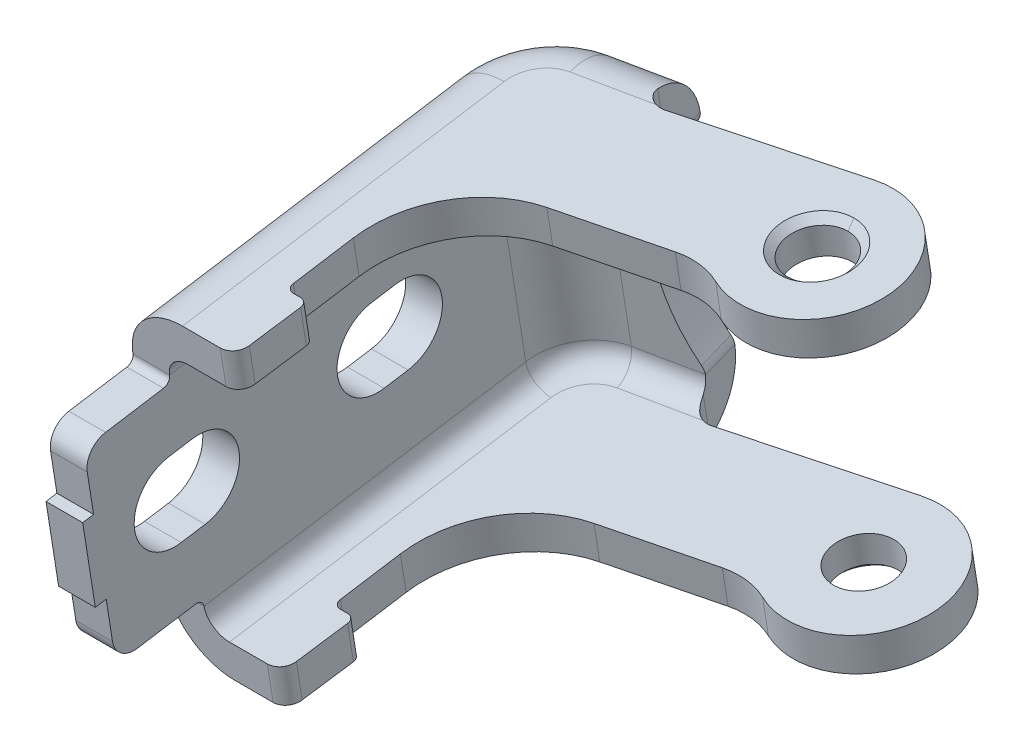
ISO-10303-21;
HEADER;
FILE_DESCRIPTION(('STEP AP214'),'2;1');
FILE_NAME('part.step','',(''),(''),'','','');
FILE_SCHEMA(('AUTOMOTIVE_DESIGN { 1 0 10303 214 1 1 1 1 }'));
ENDSEC;
DATA;
#1=APPLICATION_CONTEXT('core data for automotive mechanical design processes');
#2=APPLICATION_PROTOCOL_DEFINITION('international standard','automotive_design',2000,#1);
#3=PRODUCT_CONTEXT('',#1,'mechanical');
#4=PRODUCT('Part','Part','',(#3));
#5=PRODUCT_RELATED_PRODUCT_CATEGORY('part','',(#4));
#6=PRODUCT_DEFINITION_FORMATION('','',#4);
#7=PRODUCT_DEFINITION_CONTEXT('part definition',#1,'design');
#8=PRODUCT_DEFINITION('design','',#6,#7);
#9=PRODUCT_DEFINITION_SHAPE('','',#8);
#10=(LENGTH_UNIT() NAMED_UNIT(*) SI_UNIT(.MILLI.,.METRE.));
#11=(NAMED_UNIT(*) PLANE_ANGLE_UNIT() SI_UNIT($,.RADIAN.));
#12=(NAMED_UNIT(*) SI_UNIT($,.STERADIAN.) SOLID_ANGLE_UNIT());
#13=UNCERTAINTY_MEASURE_WITH_UNIT(LENGTH_MEASURE(1.E-05),#10,'distance_accuracy_value','');
#14=(GEOMETRIC_REPRESENTATION_CONTEXT(3) GLOBAL_UNCERTAINTY_ASSIGNED_CONTEXT((#13)) GLOBAL_UNIT_ASSIGNED_CONTEXT((#10,
#11,#12)) REPRESENTATION_CONTEXT('',''));
#15=CARTESIAN_POINT('',(0.,0.,0.));
#16=DIRECTION('',(0.,0.,1.));
#17=DIRECTION('',(1.,0.,0.));
#18=AXIS2_PLACEMENT_3D('',#15,#16,#17);
#19=CARTESIAN_POINT('',(244.193449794,-434.717707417,693.462665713));
#20=DIRECTION('',(9.51717233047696E-07,0.15645124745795,-0.987685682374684));
#21=DIRECTION('',(0.,0.987685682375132,0.156451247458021));
#22=AXIS2_PLACEMENT_3D('',#19,#20,#21);
#23=PLANE('',#22);
#24=DIRECTION('',(0.,0.987685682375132,0.156451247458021));
#25=VECTOR('',#24,1.);
#26=CARTESIAN_POINT('',(243.20455599,-434.717707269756,693.462664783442));
#27=LINE('',#26,#25);
#28=CARTESIAN_POINT('',(243.20455599,-457.434477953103,689.864286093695));
#29=VERTEX_POINT('',#28);
#30=CARTESIAN_POINT('',(243.20455599,-452.496049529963,690.646542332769));
#31=VERTEX_POINT('',#30);
#32=EDGE_CURVE('E384',#29,#31,#27,.T.);
#33=ORIENTED_EDGE('',*,*,#32,.T.);
#34=DIRECTION('',(0.999999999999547,-1.48897348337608E-07,9.39997484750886E-07));
#35=VECTOR('',#34,1.);
#36=CARTESIAN_POINT('',(244.193449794,-452.496049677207,690.646543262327));
#37=LINE('',#36,#35);
#38=CARTESIAN_POINT('',(244.193449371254,-452.496049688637,690.646543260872));
#39=VERTEX_POINT('',#38);
#40=EDGE_CURVE('E378',#31,#39,#37,.T.);
#41=ORIENTED_EDGE('',*,*,#40,.T.);
#42=DIRECTION('',(2.35016094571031E-08,0.987685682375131,0.156451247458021));
#43=VECTOR('',#42,1.);
#44=CARTESIAN_POINT('',(244.193449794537,-434.717707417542,693.462665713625));
#45=LINE('',#44,#43);
#46=CARTESIAN_POINT('',(244.1934493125,-457.434478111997,689.864287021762));
#47=VERTEX_POINT('',#46);
#48=EDGE_CURVE('E381',#47,#39,#45,.T.);
#49=ORIENTED_EDGE('',*,*,#48,.F.);
#50=DIRECTION('',(0.999999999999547,-1.48897348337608E-07,9.39997484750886E-07));
#51=VECTOR('',#50,1.);
#52=CARTESIAN_POINT('',(244.193449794,-457.434478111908,689.864287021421));
#53=LINE('',#52,#51);
#54=EDGE_CURVE('E388',#47,#29,#53,.F.);
#55=ORIENTED_EDGE('',*,*,#54,.T.);
#56=EDGE_LOOP('',(#33,#41,#49,#55));
#57=FACE_BOUND('',#56,.T.);
#58=ADVANCED_FACE('F16',(#57),#23,.T.);
#59=CARTESIAN_POINT('',(244.193449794,-434.717707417,693.462665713));
#60=DIRECTION('',(9.51717233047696E-07,0.15645124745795,-0.987685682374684));
#61=DIRECTION('',(0.,0.987685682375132,0.156451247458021));
#62=AXIS2_PLACEMENT_3D('',#59,#60,#61);
#63=PLANE('',#62);
#64=DIRECTION('',(2.35016094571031E-08,0.987685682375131,0.156451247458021));
#65=VECTOR('',#64,1.);
#66=CARTESIAN_POINT('',(244.193449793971,-434.717707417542,693.462665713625));
#67=LINE('',#66,#65);
#68=CARTESIAN_POINT('',(244.193450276,-416.939365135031,696.278788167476));
#69=VERTEX_POINT('',#68);
#70=CARTESIAN_POINT('',(244.193450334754,-412.000936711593,697.061044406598));
#71=VERTEX_POINT('',#70);
#72=EDGE_CURVE('E1354',#69,#71,#67,.T.);
#73=ORIENTED_EDGE('',*,*,#72,.F.);
#74=DIRECTION('',(0.999999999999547,-1.48897348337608E-07,9.39997484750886E-07));
#75=VECTOR('',#74,1.);
#76=CARTESIAN_POINT('',(244.193449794,-416.939365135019,696.278788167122));
#77=LINE('',#76,#75);
#78=CARTESIAN_POINT('',(243.204557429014,-416.939364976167,696.278787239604));
#79=VERTEX_POINT('',#78);
#80=EDGE_CURVE('E402',#69,#79,#77,.F.);
#81=ORIENTED_EDGE('',*,*,#80,.T.);
#82=DIRECTION('',(0.,0.987685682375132,0.156451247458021));
#83=VECTOR('',#82,1.);
#84=CARTESIAN_POINT('',(243.204556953,-434.717707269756,693.462664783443));
#85=LINE('',#84,#83);
#86=CARTESIAN_POINT('',(243.204556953,-412.00093655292,697.061043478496));
#87=VERTEX_POINT('',#86);
#88=EDGE_CURVE('E1572',#79,#87,#85,.T.);
#89=ORIENTED_EDGE('',*,*,#88,.T.);
#90=DIRECTION('',(0.999999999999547,-1.48897348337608E-07,9.39997484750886E-07));
#91=VECTOR('',#90,1.);
#92=CARTESIAN_POINT('',(244.193449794,-412.000936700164,697.061044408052));
#93=LINE('',#92,#91);
#94=EDGE_CURVE('E387',#87,#71,#93,.T.);
#95=ORIENTED_EDGE('',*,*,#94,.T.);
#96=EDGE_LOOP('',(#73,#81,#89,#95));
#97=FACE_BOUND('',#96,.T.);
#98=ADVANCED_FACE('F1327',(#97),#63,.T.);
#99=CARTESIAN_POINT('',(259.719596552,-442.895874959,649.215390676));
#100=DIRECTION('',(-0.984807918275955,-0.0271673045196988,0.171508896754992));
#101=DIRECTION('',(0.171572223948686,0.,0.985171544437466));
#102=AXIS2_PLACEMENT_3D('',#99,#100,#101);
#103=CYLINDRICAL_SURFACE('',#102,8.);
#104=CARTESIAN_POINT('',(249.298043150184,-441.999205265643,642.993728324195));
#105=CARTESIAN_POINT('',(249.298015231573,-441.984727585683,642.99586159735));
#106=CARTESIAN_POINT('',(249.297836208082,-441.970263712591,642.998060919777));
#107=CARTESIAN_POINT('',(249.297175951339,-441.941363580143,643.002591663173));
#108=CARTESIAN_POINT('',(249.296694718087,-441.926927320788,643.004923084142));
#109=CARTESIAN_POINT('',(249.296062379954,-441.9125048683,643.007320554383));
#110=B_SPLINE_CURVE_WITH_KNOTS('',3,(#104,#105,#106,#107,#108,#109),.UNSPECIFIED.,.F.,.F.,(4,2,
4),(0.,0.043893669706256,0.0877873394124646),.UNSPECIFIED.);
#111=CARTESIAN_POINT('',(249.298043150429,-441.999205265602,642.993728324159));
#112=VERTEX_POINT('',#111);
#113=CARTESIAN_POINT('',(249.296062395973,-441.912504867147,643.00732055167));
#114=VERTEX_POINT('',#113);
#115=EDGE_CURVE('E1303',#112,#114,#110,.T.);
#116=ORIENTED_EDGE('',*,*,#115,.F.);
#117=CARTESIAN_POINT('',(250.688302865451,-443.145015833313,650.788232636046));
#118=DIRECTION('',(0.9847822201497,0.0271900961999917,-0.171652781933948));
#119=DIRECTION('',(-0.173792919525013,0.154070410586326,-0.972655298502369));
#120=AXIS2_PLACEMENT_3D('',#117,#118,#119);
#121=ELLIPSE('',#120,8.0000000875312,8.);
#122=CARTESIAN_POINT('',(250.297694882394,-450.381983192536,647.400943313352));
#123=VERTEX_POINT('',#122);
#124=EDGE_CURVE('E1371',#123,#112,#121,.T.);
#125=ORIENTED_EDGE('',*,*,#124,.F.);
#126=CARTESIAN_POINT('',(250.297694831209,-450.381983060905,647.400943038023));
#127=CARTESIAN_POINT('',(250.309249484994,-450.411476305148,647.462604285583));
#128=CARTESIAN_POINT('',(250.323479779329,-450.440069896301,647.524200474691));
#129=CARTESIAN_POINT('',(250.357279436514,-450.495309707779,647.646812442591));
#130=CARTESIAN_POINT('',(250.376849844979,-450.521955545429,647.707828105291));
#131=CARTESIAN_POINT('',(250.42130226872,-450.573127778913,647.828775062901));
#132=CARTESIAN_POINT('',(250.44618172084,-450.597655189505,647.888706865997));
#133=CARTESIAN_POINT('',(250.501148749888,-450.64449404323,648.006999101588));
#134=CARTESIAN_POINT('',(250.53123583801,-450.666805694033,648.065359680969));
#135=CARTESIAN_POINT('',(250.629237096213,-450.730380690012,648.237539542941));
#136=CARTESIAN_POINT('',(250.704857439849,-450.768245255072,648.348364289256));
#137=CARTESIAN_POINT('',(250.874606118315,-450.834816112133,648.557777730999));
#138=CARTESIAN_POINT('',(250.968729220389,-450.863524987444,648.656369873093));
#139=CARTESIAN_POINT('',(251.171102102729,-450.912131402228,648.836404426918));
#140=CARTESIAN_POINT('',(251.279084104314,-450.932170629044,648.918110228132));
#141=CARTESIAN_POINT('',(251.507372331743,-450.965238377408,649.063713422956));
#142=CARTESIAN_POINT('',(251.627669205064,-450.978272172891,649.12762419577));
#143=CARTESIAN_POINT('',(251.804386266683,-450.992691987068,649.204119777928));
#144=CARTESIAN_POINT('',(251.857196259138,-450.996440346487,649.224916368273));
#145=CARTESIAN_POINT('',(251.964021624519,-451.003029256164,649.262920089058));
#146=CARTESIAN_POINT('',(252.018034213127,-451.005871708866,649.280134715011));
#147=CARTESIAN_POINT('',(252.072601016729,-451.008313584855,649.295541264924));
#148=B_SPLINE_CURVE_WITH_KNOTS('',3,(#126,#127,#128,#129,#130,#131,#132,#133,#134,#135,#136,
#137,#138,#139,#140,#141,#142,#143,#144,#145,#146,#147),.UNSPECIFIED.,.F.,.F.,(4,2,2,2,2,2,2,2,
2,2,4),(0.,0.207914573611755,0.415869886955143,0.62372502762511,0.831560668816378,
1.24754585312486,1.66341356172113,2.07220135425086,2.48068096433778,2.65121646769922,
2.82139144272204),.UNSPECIFIED.);
#149=CARTESIAN_POINT('',(252.072600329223,-451.008313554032,649.29554107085));
#150=VERTEX_POINT('',#149);
#151=EDGE_CURVE('E1306',#123,#150,#148,.T.);
#152=ORIENTED_EDGE('',*,*,#151,.T.);
#153=DIRECTION('',(-0.984807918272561,-0.0271673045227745,0.17150889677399));
#154=VECTOR('',#153,1.);
#155=CARTESIAN_POINT('',(252.072601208,-451.008313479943,649.295540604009));
#156=LINE('',#155,#154);
#157=CARTESIAN_POINT('',(242.086355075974,-451.283798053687,651.034691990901));
#158=VERTEX_POINT('',#157);
#159=EDGE_CURVE('E1285',#150,#158,#156,.T.);
#160=ORIENTED_EDGE('',*,*,#159,.T.);
#161=CARTESIAN_POINT('',(240.697174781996,-442.149717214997,644.50485697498));
#162=CARTESIAN_POINT('',(240.697174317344,-442.279010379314,644.484373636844));
#163=CARTESIAN_POINT('',(240.69773122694,-442.408798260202,644.467012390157));
#164=CARTESIAN_POINT('',(240.699957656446,-442.669057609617,644.43857025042));
#165=CARTESIAN_POINT('',(240.701627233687,-442.799529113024,644.42748968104));
#166=CARTESIAN_POINT('',(240.706076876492,-443.060837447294,644.411647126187));
#167=CARTESIAN_POINT('',(240.708856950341,-443.191674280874,644.406885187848));
#168=CARTESIAN_POINT('',(240.715521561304,-443.453394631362,644.403695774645));
#169=CARTESIAN_POINT('',(240.719406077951,-443.58427814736,644.405268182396));
#170=CARTESIAN_POINT('',(240.72827074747,-443.845774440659,644.414747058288));
#171=CARTESIAN_POINT('',(240.733250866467,-443.976387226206,644.422653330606));
#172=CARTESIAN_POINT('',(240.744294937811,-444.237026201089,644.444782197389));
#173=CARTESIAN_POINT('',(240.750358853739,-444.367052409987,644.459004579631));
#174=CARTESIAN_POINT('',(240.763555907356,-444.626204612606,644.493731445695));
#175=CARTESIAN_POINT('',(240.770689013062,-444.755330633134,644.514235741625));
#176=CARTESIAN_POINT('',(240.786007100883,-445.012371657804,644.56147607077));
#177=CARTESIAN_POINT('',(240.794192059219,-445.140286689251,644.588211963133));
#178=CARTESIAN_POINT('',(240.811593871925,-445.39459835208,644.647849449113));
#179=CARTESIAN_POINT('',(240.820810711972,-445.52099500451,644.680750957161));
#180=CARTESIAN_POINT('',(240.840253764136,-445.771966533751,644.752638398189));
#181=CARTESIAN_POINT('',(240.850479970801,-445.896541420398,644.791624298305));
#182=CARTESIAN_POINT('',(240.871916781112,-446.143570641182,644.875584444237));
#183=CARTESIAN_POINT('',(240.883127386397,-446.266024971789,644.92055870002));
#184=CARTESIAN_POINT('',(240.906505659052,-446.5085194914,645.016385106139));
#185=CARTESIAN_POINT('',(240.91867333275,-446.628559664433,645.067237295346));
#186=CARTESIAN_POINT('',(240.943936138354,-446.865938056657,645.174695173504));
#187=CARTESIAN_POINT('',(240.957031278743,-446.983276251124,645.231300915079));
#188=CARTESIAN_POINT('',(240.984117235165,-447.214969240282,645.350127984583));
#189=CARTESIAN_POINT('',(240.99810805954,-447.329324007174,645.412349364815));
#190=CARTESIAN_POINT('',(241.026951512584,-447.554775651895,645.542256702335));
#191=CARTESIAN_POINT('',(241.041804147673,-447.665872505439,645.609942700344));
#192=CARTESIAN_POINT('',(241.07233535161,-447.884541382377,645.750615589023));
#193=CARTESIAN_POINT('',(241.088013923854,-447.99211339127,645.8236025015));
#194=CARTESIAN_POINT('',(241.120159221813,-448.203473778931,645.974701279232));
#195=CARTESIAN_POINT('',(241.136625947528,-448.3072621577,646.052813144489));
#196=CARTESIAN_POINT('',(241.170307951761,-448.510805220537,646.21397405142));
#197=CARTESIAN_POINT('',(241.187523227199,-448.610559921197,646.297023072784));
#198=CARTESIAN_POINT('',(241.22266099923,-448.805794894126,646.467859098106));
#199=CARTESIAN_POINT('',(241.24058349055,-448.901275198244,646.555646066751));
#200=CARTESIAN_POINT('',(241.277092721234,-449.087730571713,646.735747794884));
#201=CARTESIAN_POINT('',(241.295679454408,-449.178705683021,646.828062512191));
#202=CARTESIAN_POINT('',(241.333472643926,-449.355930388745,647.016998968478));
#203=CARTESIAN_POINT('',(241.352679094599,-449.442180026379,647.113620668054));
#204=CARTESIAN_POINT('',(241.391665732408,-449.609744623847,647.31094016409));
#205=CARTESIAN_POINT('',(241.411445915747,-449.691059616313,647.411637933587));
#206=CARTESIAN_POINT('',(241.451532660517,-449.848557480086,647.616868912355));
#207=CARTESIAN_POINT('',(241.471839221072,-449.924740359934,647.721402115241));
#208=CARTESIAN_POINT('',(241.512930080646,-450.071788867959,647.934053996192));
#209=CARTESIAN_POINT('',(241.533714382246,-450.142654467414,648.04217269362));
#210=CARTESIAN_POINT('',(241.575710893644,-450.278896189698,648.261736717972));
#211=CARTESIAN_POINT('',(241.596923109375,-450.344272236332,648.373182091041));
#212=CARTESIAN_POINT('',(241.63972451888,-450.469376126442,648.599132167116));
#213=CARTESIAN_POINT('',(241.661313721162,-450.529103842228,648.71363693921));
#214=CARTESIAN_POINT('',(241.704817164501,-450.642766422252,648.945430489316));
#215=CARTESIAN_POINT('',(241.72673141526,-450.696701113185,649.062719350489));
#216=CARTESIAN_POINT('',(241.770832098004,-450.798647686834,649.299798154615));
#217=CARTESIAN_POINT('',(241.793018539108,-450.846659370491,649.419588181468));
#218=CARTESIAN_POINT('',(241.837609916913,-450.936645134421,649.661379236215));
#219=CARTESIAN_POINT('',(241.860014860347,-450.978619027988,649.783380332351));
#220=CARTESIAN_POINT('',(241.904988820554,-451.056430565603,650.029296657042));
#221=CARTESIAN_POINT('',(241.92755784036,-451.092268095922,650.153211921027));
#222=CARTESIAN_POINT('',(241.972804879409,-451.157723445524,650.402653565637));
#223=CARTESIAN_POINT('',(241.995482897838,-451.187341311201,650.528179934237));
#224=CARTESIAN_POINT('',(242.040892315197,-451.24029535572,650.780534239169));
#225=CARTESIAN_POINT('',(242.063623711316,-451.263631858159,650.907362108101));
#226=CARTESIAN_POINT('',(242.086355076,-451.283798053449,651.034691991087));
#227=B_SPLINE_CURVE_WITH_KNOTS('',3,(#161,#162,#163,#164,#165,#166,#167,#168,#169,#170,#171,
#172,#173,#174,#175,#176,#177,#178,#179,#180,#181,#182,#183,#184,#185,#186,#187,#188,#189,#190,
#191,#192,#193,#194,#195,#196,#197,#198,#199,#200,#201,#202,#203,#204,#205,#206,#207,#208,#209,
#210,#211,#212,#213,#214,#215,#216,#217,#218,#219,#220,#221,#222,#223,#224,#225,#226),
.UNSPECIFIED.,.F.,.F.,(4,2,2,2,2,2,2,2,2,2,2,2,2,2,2,2,2,2,2,2,2,2,2,2,2,2,2,2,2,2,2,2,4),(0.,
0.39267792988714,0.785376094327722,1.17807718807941,1.57077100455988,1.9634526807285,
2.35612116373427,2.74877790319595,3.14142576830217,3.53406818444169,3.92670847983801,
4.31934942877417,4.71199297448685,5.1046401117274,5.49729090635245,5.88994462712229,
6.28259996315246,6.67525529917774,7.06790901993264,7.4605598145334,7.85320695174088,
8.2458504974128,8.6384914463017,9.03113174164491,9.42377415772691,9.81642202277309,
10.2090787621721,10.601747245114,10.9944289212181,11.3871227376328,11.7798238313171,
12.1725219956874,12.5651999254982),.UNSPECIFIED.);
#228=CARTESIAN_POINT('',(240.69717529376,-442.149717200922,644.504856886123));
#229=VERTEX_POINT('',#228);
#230=EDGE_CURVE('E1286',#158,#229,#227,.F.);
#231=ORIENTED_EDGE('',*,*,#230,.T.);
#232=DIRECTION('',(-0.984807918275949,-0.0271673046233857,0.171508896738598));
#233=VECTOR('',#232,1.);
#234=CARTESIAN_POINT('',(249.296062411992,-441.912504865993,643.007320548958));
#235=LINE('',#234,#233);
#236=EDGE_CURVE('E532',#114,#229,#235,.T.);
#237=ORIENTED_EDGE('',*,*,#236,.F.);
#238=EDGE_LOOP('',(#116,#125,#152,#160,#231,#237));
#239=FACE_BOUND('',#238,.T.);
#240=ADVANCED_FACE('F1323',(#239),#103,.T.);
#241=CARTESIAN_POINT('',(244.193448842,-434.874158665,694.450351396));
#242=DIRECTION('',(2.35016094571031E-08,0.987685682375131,0.156451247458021));
#243=DIRECTION('',(0.,-0.156451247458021,0.987685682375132));
#244=AXIS2_PLACEMENT_3D('',#241,#242,#243);
#245=CYLINDRICAL_SURFACE('',#244,1.);
#246=ORIENTED_EDGE('',*,*,#48,.T.);
#247=CARTESIAN_POINT('',(244.193448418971,-452.652500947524,691.634228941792));
#248=DIRECTION('',(2.35016094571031E-08,0.987685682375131,0.156451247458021));
#249=DIRECTION('',(0.,-0.156451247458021,0.987685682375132));
#250=AXIS2_PLACEMENT_3D('',#247,#248,#249);
#251=CIRCLE('',#250,1.);
#252=CARTESIAN_POINT('',(245.193387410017,-452.654229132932,691.645138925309));
#253=VERTEX_POINT('',#252);
#254=EDGE_CURVE('E23',#39,#253,#251,.F.);
#255=ORIENTED_EDGE('',*,*,#254,.T.);
#256=DIRECTION('',(2.35022723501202E-08,0.987685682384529,0.156451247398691));
#257=VECTOR('',#256,1.);
#258=CARTESIAN_POINT('',(245.193387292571,-457.592657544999,690.862882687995));
#259=LINE('',#258,#257);
#260=CARTESIAN_POINT('',(245.193387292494,-457.592657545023,690.862882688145));
#261=VERTEX_POINT('',#260);
#262=EDGE_CURVE('E1742',#261,#253,#259,.T.);
#263=ORIENTED_EDGE('',*,*,#262,.F.);
#264=CARTESIAN_POINT('',(244.193448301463,-457.590929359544,690.851972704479));
#265=DIRECTION('',(2.35016094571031E-08,0.987685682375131,0.156451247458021));
#266=DIRECTION('',(0.,-0.156451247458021,0.987685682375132));
#267=AXIS2_PLACEMENT_3D('',#264,#265,#266);
#268=CIRCLE('',#267,1.);
#269=EDGE_CURVE('E401',#261,#47,#268,.T.);
#270=ORIENTED_EDGE('',*,*,#269,.T.);
#271=EDGE_LOOP('',(#246,#255,#263,#270));
#272=FACE_BOUND('',#271,.T.);
#273=ADVANCED_FACE('F400',(#272),#245,.T.);
#274=CARTESIAN_POINT('',(243.204557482,-434.561256,692.474979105));
#275=DIRECTION('',(2.35016094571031E-08,0.987685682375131,0.156451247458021));
#276=DIRECTION('',(0.,-0.156451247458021,0.987685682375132));
#277=AXIS2_PLACEMENT_3D('',#274,#275,#276);
#278=CYLINDRICAL_SURFACE('',#277,1.);
#279=ORIENTED_EDGE('',*,*,#32,.F.);
#280=CARTESIAN_POINT('',(243.204556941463,-457.278026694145,688.876600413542));
#281=DIRECTION('',(2.35016094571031E-08,0.987685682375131,0.156451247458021));
#282=DIRECTION('',(0.,-0.156451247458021,0.987685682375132));
#283=AXIS2_PLACEMENT_3D('',#280,#281,#282);
#284=CIRCLE('',#283,1.);
#285=CARTESIAN_POINT('',(242.204556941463,-457.278026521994,688.87659947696));
#286=VERTEX_POINT('',#285);
#287=EDGE_CURVE('E1281',#29,#286,#284,.F.);
#288=ORIENTED_EDGE('',*,*,#287,.T.);
#289=DIRECTION('',(-2.35016173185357E-08,-0.987685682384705,-0.15645124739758));
#290=VECTOR('',#289,1.);
#291=CARTESIAN_POINT('',(242.204557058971,-452.33959811,689.658855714));
#292=LINE('',#291,#290);
#293=CARTESIAN_POINT('',(242.204557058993,-452.339598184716,689.658856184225));
#294=VERTEX_POINT('',#293);
#295=EDGE_CURVE('E1739',#294,#286,#292,.T.);
#296=ORIENTED_EDGE('',*,*,#295,.F.);
#297=CARTESIAN_POINT('',(243.204557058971,-452.339598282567,689.658856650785));
#298=DIRECTION('',(2.35016094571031E-08,0.987685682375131,0.156451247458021));
#299=DIRECTION('',(0.,-0.156451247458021,0.987685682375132));
#300=AXIS2_PLACEMENT_3D('',#297,#298,#299);
#301=CIRCLE('',#300,1.);
#302=EDGE_CURVE('E959',#31,#294,#301,.F.);
#303=ORIENTED_EDGE('',*,*,#302,.F.);
#304=EDGE_LOOP('',(#279,#288,#296,#303));
#305=FACE_BOUND('',#304,.T.);
#306=ADVANCED_FACE('F1762',(#305),#278,.F.);
#307=CARTESIAN_POINT('',(278.954590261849,-451.800442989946,654.296295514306));
#308=DIRECTION('',(-2.35016131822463E-08,-0.987685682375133,-0.156451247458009));
#309=DIRECTION('',(0.,0.156451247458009,-0.987685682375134));
#310=AXIS2_PLACEMENT_3D('',#307,#308,#309);
#311=CONICAL_SURFACE('',#310,5.15500000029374,0.785398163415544);
#312=CARTESIAN_POINT('',(278.954590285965,-450.812757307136,654.452746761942));
#313=DIRECTION('',(2.35016094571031E-08,0.987685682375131,0.156451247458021));
#314=DIRECTION('',(0.,-0.156451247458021,0.987685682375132));
#315=AXIS2_PLACEMENT_3D('',#312,#313,#314);
#316=CIRCLE('',#315,4.155);
#317=CARTESIAN_POINT('',(278.954594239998,-450.16270237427,650.348912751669));
#318=VERTEX_POINT('',#317);
#319=CARTESIAN_POINT('',(278.954589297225,-451.46281224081,658.556580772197));
#320=VERTEX_POINT('',#319);
#321=EDGE_CURVE('E950',#318,#320,#316,.T.);
#322=ORIENTED_EDGE('',*,*,#321,.T.);
#323=CARTESIAN_POINT('',(278.954586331,-451.462812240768,658.556580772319));
#324=CARTESIAN_POINT('',(278.954586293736,-451.510484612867,658.591215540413));
#325=CARTESIAN_POINT('',(278.954586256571,-451.558156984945,658.625850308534));
#326=CARTESIAN_POINT('',(278.95458618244,-451.65350172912,658.695119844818));
#327=CARTESIAN_POINT('',(278.954586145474,-451.701174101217,658.72975461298));
#328=CARTESIAN_POINT('',(278.954586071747,-451.796518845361,658.799024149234));
#329=CARTESIAN_POINT('',(278.954586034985,-451.844191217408,658.833658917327));
#330=CARTESIAN_POINT('',(278.954585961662,-451.93953596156,658.902928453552));
#331=CARTESIAN_POINT('',(278.9545859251,-451.987208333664,658.937563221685));
#332=CARTESIAN_POINT('',(278.954585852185,-452.082553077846,659.006832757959));
#333=CARTESIAN_POINT('',(278.954585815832,-452.130225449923,659.041467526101));
#334=CARTESIAN_POINT('',(278.954585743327,-452.225570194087,659.110737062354));
#335=CARTESIAN_POINT('',(278.954585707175,-452.273242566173,659.145371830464));
#336=CARTESIAN_POINT('',(278.954585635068,-452.368587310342,659.21464136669));
#337=CARTESIAN_POINT('',(278.954585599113,-452.416259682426,659.249276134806));
#338=CARTESIAN_POINT('',(278.954585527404,-452.511604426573,659.318545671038));
#339=CARTESIAN_POINT('',(278.95458549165,-452.559276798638,659.353180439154));
#340=CARTESIAN_POINT('',(278.954585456,-452.606949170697,659.387815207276));
#341=B_SPLINE_CURVE_WITH_KNOTS('',3,(#323,#324,#325,#326,#327,#328,#329,#330,#331,#332,#333,
#334,#335,#336,#337,#338,#339,#340),.UNSPECIFIED.,.F.,.F.,(4,2,2,2,2,2,2,2,4),(0.,
0.176776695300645,0.353553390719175,0.530330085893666,0.707106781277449,0.883883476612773,
1.06066017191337,1.23743686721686,1.41421356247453),.UNSPECIFIED.);
#342=CARTESIAN_POINT('',(278.954585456,-452.606949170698,659.387815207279));
#343=VERTEX_POINT('',#342);
#344=EDGE_CURVE('E958',#320,#343,#341,.T.);
#345=ORIENTED_EDGE('',*,*,#344,.T.);
#346=CARTESIAN_POINT('',(278.954590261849,-451.800442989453,654.296295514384));
#347=DIRECTION('',(-2.35016131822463E-08,-0.987685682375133,-0.156451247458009));
#348=DIRECTION('',(0.,0.156451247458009,-0.987685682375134));
#349=AXIS2_PLACEMENT_3D('',#346,#347,#348);
#350=CIRCLE('',#349,5.15499999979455);
#351=CARTESIAN_POINT('',(278.954595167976,-450.993936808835,649.20477582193));
#352=VERTEX_POINT('',#351);
#353=EDGE_CURVE('E953',#343,#352,#350,.T.);
#354=ORIENTED_EDGE('',*,*,#353,.T.);
#355=CARTESIAN_POINT('',(278.954595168,-450.993936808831,649.204775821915));
#356=CARTESIAN_POINT('',(278.954595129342,-450.959302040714,649.25244819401));
#357=CARTESIAN_POINT('',(278.954595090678,-450.924667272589,649.3001205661));
#358=CARTESIAN_POINT('',(278.954595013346,-450.855397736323,649.395465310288));
#359=CARTESIAN_POINT('',(278.954594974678,-450.820762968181,649.443137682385));
#360=CARTESIAN_POINT('',(278.954594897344,-450.751493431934,649.538482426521));
#361=CARTESIAN_POINT('',(278.954594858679,-450.71685866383,649.58615479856));
#362=CARTESIAN_POINT('',(278.954594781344,-450.6475891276,649.681499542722));
#363=CARTESIAN_POINT('',(278.954594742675,-450.612954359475,649.729171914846));
#364=CARTESIAN_POINT('',(278.954594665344,-450.543684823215,649.824516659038));
#365=CARTESIAN_POINT('',(278.954594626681,-450.50905005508,649.872189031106));
#366=CARTESIAN_POINT('',(278.954594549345,-450.43978051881,649.967533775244));
#367=CARTESIAN_POINT('',(278.954594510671,-450.405145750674,650.015206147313));
#368=CARTESIAN_POINT('',(278.954594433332,-450.335876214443,650.110550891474));
#369=CARTESIAN_POINT('',(278.954594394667,-450.301241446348,650.158223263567));
#370=CARTESIAN_POINT('',(278.954594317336,-450.231971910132,650.253568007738));
#371=CARTESIAN_POINT('',(278.95459427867,-450.197337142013,650.301240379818));
#372=CARTESIAN_POINT('',(278.95459424,-450.162702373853,650.348912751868));
#373=B_SPLINE_CURVE_WITH_KNOTS('',3,(#355,#356,#357,#358,#359,#360,#361,#362,#363,#364,#365,
#366,#367,#368,#369,#370,#371,#372),.UNSPECIFIED.,.F.,.F.,(4,2,2,2,2,2,2,2,4),(0.,
0.1767766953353,0.353553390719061,0.530330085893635,0.707106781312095,0.883883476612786,
1.06066017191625,1.23743686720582,1.41421356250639),.UNSPECIFIED.);
#374=EDGE_CURVE('E947',#352,#318,#373,.T.);
#375=ORIENTED_EDGE('',*,*,#374,.T.);
#376=EDGE_LOOP('',(#322,#345,#354,#375));
#377=FACE_BOUND('',#376,.T.);
#378=ADVANCED_FACE('F949',(#377),#311,.F.);
#379=CARTESIAN_POINT('',(278.954590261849,-451.800442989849,654.296295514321));
#380=DIRECTION('',(-2.35016222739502E-08,-0.98768568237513,-0.156451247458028));
#381=DIRECTION('',(0.,0.156451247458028,-0.987685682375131));
#382=AXIS2_PLACEMENT_3D('',#379,#380,#381);
#383=CONICAL_SURFACE('',#382,5.15500000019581,0.785398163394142);
#384=CARTESIAN_POINT('',(278.954590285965,-450.812757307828,654.452746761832));
#385=DIRECTION('',(2.35016094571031E-08,0.987685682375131,0.156451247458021));
#386=DIRECTION('',(0.,-0.156451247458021,0.987685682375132));
#387=AXIS2_PLACEMENT_3D('',#384,#385,#386);
#388=CIRCLE('',#387,4.155);
#389=EDGE_CURVE('E963',#320,#318,#388,.T.);
#390=ORIENTED_EDGE('',*,*,#389,.T.);
#391=ORIENTED_EDGE('',*,*,#374,.F.);
#392=CARTESIAN_POINT('',(278.954590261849,-451.800442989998,654.296295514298));
#393=DIRECTION('',(-2.35016222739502E-08,-0.98768568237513,-0.156451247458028));
#394=DIRECTION('',(0.,0.156451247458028,-0.987685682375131));
#395=AXIS2_PLACEMENT_3D('',#392,#393,#394);
#396=CIRCLE('',#395,5.15500000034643);
#397=EDGE_CURVE('E1278',#352,#343,#396,.T.);
#398=ORIENTED_EDGE('',*,*,#397,.T.);
#399=ORIENTED_EDGE('',*,*,#344,.F.);
#400=EDGE_LOOP('',(#390,#391,#398,#399));
#401=FACE_BOUND('',#400,.T.);
#402=ADVANCED_FACE('F966',(#401),#383,.F.);
#403=CARTESIAN_POINT('',(249.86202873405,-414.05089862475,652.51311429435));
#404=CARTESIAN_POINT('',(249.86322699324,-414.0489766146,652.51320418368));
#405=CARTESIAN_POINT('',(249.86442525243,-414.04705460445,652.51329407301));
#406=CARTESIAN_POINT('',(249.86562351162,-414.0451325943,652.51338396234));
#407=CARTESIAN_POINT('',(249.86682177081,-414.04321058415,652.51347385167));
#408=CARTESIAN_POINT('',(249.86802003,-414.041288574,652.513563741));
#409=CARTESIAN_POINT('',(249.987845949,-413.849087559,652.522552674));
#410=CARTESIAN_POINT('',(250.080990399,-413.640595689,652.538885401));
#411=CARTESIAN_POINT('',(250.144238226,-413.420953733,652.562323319));
#412=CARTESIAN_POINT('',(250.175853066,-413.196191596,652.592222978));
#413=CARTESIAN_POINT('',(250.175843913,-412.972302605,652.627634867));
#414=CARTESIAN_POINT('',(249.41876719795,-413.6584587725,650.0321002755));
#415=CARTESIAN_POINT('',(249.41996535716,-413.6565368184,650.0321901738));
#416=CARTESIAN_POINT('',(249.42116351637,-413.6546148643,650.0322800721));
#417=CARTESIAN_POINT('',(249.42236167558,-413.6526929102,650.0323699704));
#418=CARTESIAN_POINT('',(249.42355983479,-413.6507709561,650.0324598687));
#419=CARTESIAN_POINT('',(249.424757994,-413.648849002,650.032549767));
#420=CARTESIAN_POINT('',(249.544573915,-413.456653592,650.041539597));
#421=CARTESIAN_POINT('',(249.637710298,-413.248169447,650.057872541));
#422=CARTESIAN_POINT('',(249.700952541,-413.02853673,650.081309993));
#423=CARTESIAN_POINT('',(249.732564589,-412.803784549,650.111208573));
#424=CARTESIAN_POINT('',(249.732555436,-412.579905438,650.146618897));
#425=CARTESIAN_POINT('',(248.97550566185,-413.2660189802,647.5510862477));
#426=CARTESIAN_POINT('',(248.97670372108,-413.26409708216,647.55117615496));
#427=CARTESIAN_POINT('',(248.97790178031,-413.26217518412,647.55126606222));
#428=CARTESIAN_POINT('',(248.97909983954,-413.26025328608,647.55135596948));
#429=CARTESIAN_POINT('',(248.98029789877,-413.25833138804,647.55144587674));
#430=CARTESIAN_POINT('',(248.981495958,-413.25640949,647.551535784));
#431=CARTESIAN_POINT('',(249.101301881,-413.064219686,647.56052651));
#432=CARTESIAN_POINT('',(249.194430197,-412.855743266,647.576859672));
#433=CARTESIAN_POINT('',(249.257666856,-412.63611979,647.600296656));
#434=CARTESIAN_POINT('',(249.289276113,-412.411377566,647.630194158));
#435=CARTESIAN_POINT('',(249.28926696,-412.187508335,647.665602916));
#436=B_SPLINE_SURFACE_WITH_KNOTS('',2,5,((#403,#404,#405,#406,#407,#408,#409,#410,#411,#412,
#413),(#414,#415,#416,#417,#418,#419,#420,#421,#422,#423,#424),(#425,#426,#427,#428,#429,#430,
#431,#432,#433,#434,#435)),.UNSPECIFIED.,.F.,.F.,.F.,(3,3),(6,5,6),(7.12481222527,
14.3391980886),(-0.02,0.,2.),.UNSPECIFIED.);
#437=CARTESIAN_POINT('',(250.164977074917,-413.052287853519,652.564143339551));
#438=CARTESIAN_POINT('',(250.162855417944,-413.100226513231,652.556928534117));
#439=CARTESIAN_POINT('',(250.158990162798,-413.148134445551,652.550029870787));
#440=CARTESIAN_POINT('',(250.147808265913,-413.24362447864,652.536900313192));
#441=CARTESIAN_POINT('',(250.140492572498,-413.291206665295,652.530669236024));
#442=CARTESIAN_POINT('',(250.122444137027,-413.385808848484,652.518906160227));
#443=CARTESIAN_POINT('',(250.111711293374,-413.432828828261,652.513374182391));
#444=CARTESIAN_POINT('',(250.086887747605,-413.52606085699,652.503037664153));
#445=CARTESIAN_POINT('',(250.07279632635,-413.572272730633,652.498233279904));
#446=CARTESIAN_POINT('',(250.032094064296,-413.690426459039,652.48678385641));
#447=CARTESIAN_POINT('',(250.002985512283,-413.761579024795,652.480709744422));
#448=CARTESIAN_POINT('',(249.936853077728,-413.900374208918,652.47053058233));
#449=CARTESIAN_POINT('',(249.899818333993,-413.968011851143,652.466428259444));
#450=CARTESIAN_POINT('',(249.859050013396,-414.0333470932,652.463357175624));
#451=B_SPLINE_CURVE_WITH_KNOTS('',3,(#437,#438,#439,#440,#441,#442,#443,#444,#445,#446,#447,
#448,#449,#450),.UNSPECIFIED.,.F.,.F.,(4,2,2,2,2,2,4),(0.,0.145540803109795,0.291041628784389,
0.436546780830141,0.582083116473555,0.812893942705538,1.04402309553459),.UNSPECIFIED.);
#452=CARTESIAN_POINT('',(250.164977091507,-413.052287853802,652.564143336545));
#453=VERTEX_POINT('',#452);
#454=CARTESIAN_POINT('',(249.859050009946,-414.033347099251,652.463357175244));
#455=VERTEX_POINT('',#454);
#456=EDGE_CURVE('E1003',#453,#455,#451,.T.);
#457=CARTESIAN_POINT('',(249.859050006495,-414.033347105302,652.463357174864));
#458=CARTESIAN_POINT('',(249.822845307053,-414.001293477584,652.260713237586));
#459=CARTESIAN_POINT('',(249.786640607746,-413.969239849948,652.05806930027));
#460=CARTESIAN_POINT('',(249.714231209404,-413.905132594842,651.652781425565));
#461=CARTESIAN_POINT('',(249.678026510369,-413.873078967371,651.450137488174));
#462=CARTESIAN_POINT('',(249.60561711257,-413.808971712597,651.044849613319));
#463=CARTESIAN_POINT('',(249.569412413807,-413.776918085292,650.842205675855));
#464=CARTESIAN_POINT('',(249.497003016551,-413.712810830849,650.43691780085));
#465=CARTESIAN_POINT('',(249.460798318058,-413.680757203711,650.23427386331));
#466=CARTESIAN_POINT('',(249.388388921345,-413.616649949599,649.828985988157));
#467=CARTESIAN_POINT('',(249.352184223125,-413.584596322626,649.626342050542));
#468=CARTESIAN_POINT('',(249.279774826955,-413.520489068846,649.221054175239));
#469=CARTESIAN_POINT('',(249.243570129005,-413.488435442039,649.01841023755));
#470=CARTESIAN_POINT('',(249.171160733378,-413.42432818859,648.613122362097));
#471=CARTESIAN_POINT('',(249.134956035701,-413.392274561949,648.410478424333));
#472=CARTESIAN_POINT('',(249.062546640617,-413.328167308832,648.005190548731));
#473=CARTESIAN_POINT('',(249.02634194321,-413.296113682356,647.802546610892));
#474=CARTESIAN_POINT('',(248.99013724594,-413.264060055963,647.599902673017));
#475=B_SPLINE_CURVE_WITH_KNOTS('',3,(#457,#458,#459,#460,#461,#462,#463,#464,#465,#466,#467,
#468,#469,#470,#471,#472,#473,#474),.UNSPECIFIED.,.F.,.F.,(4,2,2,2,2,2,2,2,4),(0.,
0.625000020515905,1.25000004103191,1.8750000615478,2.50000008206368,3.12500010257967,
3.75000012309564,4.3750001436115,5.00000016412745),.UNSPECIFIED.);
#476=CARTESIAN_POINT('',(248.990137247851,-413.264060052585,647.599902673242));
#477=VERTEX_POINT('',#476);
#478=EDGE_CURVE('E718',#455,#477,#475,.T.);
#479=CARTESIAN_POINT('',(249.296063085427,-412.281934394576,647.700857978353));
#480=CARTESIAN_POINT('',(249.293969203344,-412.32987354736,647.69363813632));
#481=CARTESIAN_POINT('',(249.290131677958,-412.377782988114,647.686734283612));
#482=CARTESIAN_POINT('',(249.279004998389,-412.473278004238,647.673594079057));
#483=CARTESIAN_POINT('',(249.2717167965,-412.520863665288,647.667357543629));
#484=CARTESIAN_POINT('',(249.253722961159,-412.615474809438,647.655583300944));
#485=CARTESIAN_POINT('',(249.243017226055,-412.662500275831,647.65004561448));
#486=CARTESIAN_POINT('',(249.218247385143,-412.755745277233,647.639697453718));
#487=CARTESIAN_POINT('',(249.204182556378,-412.801964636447,647.634887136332));
#488=CARTESIAN_POINT('',(249.163490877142,-412.920306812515,647.623405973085));
#489=CARTESIAN_POINT('',(249.134346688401,-412.991635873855,647.617310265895));
#490=CARTESIAN_POINT('',(249.068105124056,-413.130771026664,647.607096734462));
#491=CARTESIAN_POINT('',(249.030996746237,-413.198572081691,647.602981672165));
#492=CARTESIAN_POINT('',(248.990137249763,-413.264060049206,647.599902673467));
#493=B_SPLINE_CURVE_WITH_KNOTS('',3,(#479,#480,#481,#482,#483,#484,#485,#486,#487,#488,#489,
#490,#491,#492),.UNSPECIFIED.,.F.,.F.,(4,2,2,2,2,2,4),(0.,0.145540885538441,0.291041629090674,
0.436546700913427,0.582083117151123,0.813424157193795,1.04508686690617),.UNSPECIFIED.);
#494=CARTESIAN_POINT('',(249.296063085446,-412.281934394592,647.700857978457));
#495=VERTEX_POINT('',#494);
#496=EDGE_CURVE('E541',#495,#477,#493,.T.);
#497=CARTESIAN_POINT('',(249.298043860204,-412.195277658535,647.714725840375));
#498=CARTESIAN_POINT('',(249.29801594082,-412.209705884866,647.712280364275));
#499=CARTESIAN_POINT('',(249.297836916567,-412.224141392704,647.709901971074));
#500=CARTESIAN_POINT('',(249.29717665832,-412.253026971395,647.705279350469));
#501=CARTESIAN_POINT('',(249.296695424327,-412.267477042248,647.703035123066));
#502=CARTESIAN_POINT('',(249.296063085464,-412.281934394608,647.700857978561));
#503=B_SPLINE_CURVE_WITH_KNOTS('',3,(#497,#498,#499,#500,#501,#502),.UNSPECIFIED.,.F.,.F.,(4,2,
4),(0.,0.0438936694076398,0.087787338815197),.UNSPECIFIED.);
#504=CARTESIAN_POINT('',(249.298043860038,-412.195277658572,647.714725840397));
#505=VERTEX_POINT('',#504);
#506=EDGE_CURVE('E1032',#505,#495,#503,.T.);
#507=DIRECTION('',(-0.173792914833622,0.153840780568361,-0.972691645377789));
#508=VECTOR('',#507,1.);
#509=CARTESIAN_POINT('',(250.167153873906,-412.964610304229,652.578998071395));
#510=LINE('',#509,#508);
#511=CARTESIAN_POINT('',(250.167153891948,-412.964610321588,652.578998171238));
#512=VERTEX_POINT('',#511);
#513=EDGE_CURVE('E1055',#512,#505,#510,.T.);
#514=CARTESIAN_POINT('',(250.167153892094,-412.964610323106,652.578998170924));
#515=CARTESIAN_POINT('',(250.167077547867,-412.979184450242,652.576251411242));
#516=CARTESIAN_POINT('',(250.166857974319,-412.993777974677,652.573640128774));
#517=CARTESIAN_POINT('',(250.166132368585,-413.02300381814,652.568688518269));
#518=CARTESIAN_POINT('',(250.165626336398,-413.03763613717,652.566348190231));
#519=CARTESIAN_POINT('',(250.164977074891,-413.052287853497,652.564143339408));
#520=B_SPLINE_CURVE_WITH_KNOTS('',3,(#514,#515,#516,#517,#518,#519),.UNSPECIFIED.,.F.,.F.,(4,2,
4),(0.,0.0444808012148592,0.08896160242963),.UNSPECIFIED.);
#521=EDGE_CURVE('E1001',#512,#453,#520,.T.);
#522=ORIENTED_EDGE('',*,*,#456,.T.);
#523=ORIENTED_EDGE('',*,*,#478,.T.);
#524=ORIENTED_EDGE('',*,*,#496,.F.);
#525=ORIENTED_EDGE('',*,*,#506,.F.);
#526=ORIENTED_EDGE('',*,*,#513,.F.);
#527=ORIENTED_EDGE('',*,*,#521,.T.);
#528=EDGE_LOOP('',(#522,#523,#524,#525,#526,#527));
#529=FACE_BOUND('',#528,.T.);
#530=ADVANCED_FACE('F1017',(#529),#436,.T.);
#531=CARTESIAN_POINT('',(248.97550500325,-440.9303082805,643.16901141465));
#532=CARTESIAN_POINT('',(248.9767030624,-440.9321638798,643.16850295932));
#533=CARTESIAN_POINT('',(248.97790112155,-440.9340194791,643.16799450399));
#534=CARTESIAN_POINT('',(248.9790991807,-440.9358750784,643.16748604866));
#535=CARTESIAN_POINT('',(248.98029723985,-440.9377306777,643.16697759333));
#536=CARTESIAN_POINT('',(248.981495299,-440.939586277,643.166469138));
#537=CARTESIAN_POINT('',(249.101301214,-441.125146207,643.115623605));
#538=CARTESIAN_POINT('',(249.19442952,-441.328464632,643.066727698));
#539=CARTESIAN_POINT('',(249.257666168,-441.54457985,643.021142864));
#540=CARTESIAN_POINT('',(249.289275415,-441.767559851,642.980120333));
#541=CARTESIAN_POINT('',(249.28926625,-441.991412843,642.944609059));
#542=CARTESIAN_POINT('',(249.4187665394,-441.32383568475,645.6498531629));
#543=CARTESIAN_POINT('',(249.41996469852,-441.3256913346,645.64934468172));
#544=CARTESIAN_POINT('',(249.42116285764,-441.32754698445,645.64883620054));
#545=CARTESIAN_POINT('',(249.42236101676,-441.3294026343,645.64832771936));
#546=CARTESIAN_POINT('',(249.42355917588,-441.33125828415,645.64781923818));
#547=CARTESIAN_POINT('',(249.424757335,-441.333113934,645.647310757));
#548=CARTESIAN_POINT('',(249.544573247,-441.518678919,645.596462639));
#549=CARTESIAN_POINT('',(249.637709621,-441.722004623,645.547564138));
#550=CARTESIAN_POINT('',(249.700951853,-441.938128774,645.501976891));
#551=CARTESIAN_POINT('',(249.732563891,-442.161118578,645.460952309));
#552=CARTESIAN_POINT('',(249.732554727,-442.384981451,645.425439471));
#553=CARTESIAN_POINT('',(249.8620280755,-441.71736302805,648.1306949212));
#554=CARTESIAN_POINT('',(249.8632263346,-441.71921872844,648.13018641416));
#555=CARTESIAN_POINT('',(249.8644245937,-441.72107442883,648.12967790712));
#556=CARTESIAN_POINT('',(249.8656228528,-441.72293012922,648.12916940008));
#557=CARTESIAN_POINT('',(249.8668211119,-441.72478582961,648.12866089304));
#558=CARTESIAN_POINT('',(249.868019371,-441.72664153,648.128152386));
#559=CARTESIAN_POINT('',(249.987845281,-441.912211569,648.077301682));
#560=CARTESIAN_POINT('',(250.080989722,-442.115544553,648.028400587));
#561=CARTESIAN_POINT('',(250.144237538,-442.331677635,647.982810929));
#562=CARTESIAN_POINT('',(250.175852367,-442.554677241,647.941784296));
#563=CARTESIAN_POINT('',(250.175843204,-442.778549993,647.906269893));
#564=B_SPLINE_SURFACE_WITH_KNOTS('',2,5,((#531,#532,#533,#534,#535,#536,#537,#538,#539,#540,
#541),(#542,#543,#544,#545,#546,#547,#548,#549,#550,#551,#552),(#553,#554,#555,#556,#557,#558,
#559,#560,#561,#562,#563)),.UNSPECIFIED.,.F.,.F.,.F.,(3,3),(6,5,6),(2.66821396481,
9.88259982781),(-0.02,0.,2.),.UNSPECIFIED.);
#565=CARTESIAN_POINT('',(248.990136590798,-440.947257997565,643.214832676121));
#566=CARTESIAN_POINT('',(249.015791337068,-440.986985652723,643.203959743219));
#567=CARTESIAN_POINT('',(249.039972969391,-441.027692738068,643.193194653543));
#568=CARTESIAN_POINT('',(249.08526854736,-441.110832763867,643.171938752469));
#569=CARTESIAN_POINT('',(249.106383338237,-441.15326522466,643.161447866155));
#570=CARTESIAN_POINT('',(249.145438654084,-441.239646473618,643.140792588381));
#571=CARTESIAN_POINT('',(249.163379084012,-441.283595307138,643.130628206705));
#572=CARTESIAN_POINT('',(249.195994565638,-441.372777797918,643.110678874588));
#573=CARTESIAN_POINT('',(249.210668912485,-441.418011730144,643.100894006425));
#574=CARTESIAN_POINT('',(249.244333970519,-441.536523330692,643.07611151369));
#575=CARTESIAN_POINT('',(249.260768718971,-441.610611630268,643.061441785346));
#576=CARTESIAN_POINT('',(249.284982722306,-441.760533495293,643.03337109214));
#577=CARTESIAN_POINT('',(249.292749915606,-441.836369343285,643.019971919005));
#578=CARTESIAN_POINT('',(249.296062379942,-441.912504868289,643.007320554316));
#579=B_SPLINE_CURVE_WITH_KNOTS('',3,(#565,#566,#567,#568,#569,#570,#571,#572,#573,#574,#575,
#576,#577,#578),.UNSPECIFIED.,.F.,.F.,(4,2,2,2,2,2,4),(0.,0.145540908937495,0.291041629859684,
0.43654670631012,0.582083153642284,0.813424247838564,1.04508687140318),.UNSPECIFIED.);
#580=CARTESIAN_POINT('',(248.990136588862,-440.947257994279,643.214832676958));
#581=VERTEX_POINT('',#580);
#582=EDGE_CURVE('E1047',#581,#114,#579,.T.);
#583=CARTESIAN_POINT('',(248.990136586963,-440.947257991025,643.214832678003));
#584=CARTESIAN_POINT('',(249.02634128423,-440.979400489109,643.417462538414));
#585=CARTESIAN_POINT('',(249.062545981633,-441.011542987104,643.620092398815));
#586=CARTESIAN_POINT('',(249.134955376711,-441.075827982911,644.025352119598));
#587=CARTESIAN_POINT('',(249.171160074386,-441.107970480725,644.227981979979));
#588=CARTESIAN_POINT('',(249.243569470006,-441.172255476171,644.633241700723));
#589=CARTESIAN_POINT('',(249.279774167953,-441.204397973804,644.835871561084));
#590=CARTESIAN_POINT('',(249.352183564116,-441.268682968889,645.241131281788));
#591=CARTESIAN_POINT('',(249.388388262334,-441.300825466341,645.443761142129));
#592=CARTESIAN_POINT('',(249.46079765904,-441.365110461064,645.849020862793));
#593=CARTESIAN_POINT('',(249.49700235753,-441.397252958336,646.051650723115));
#594=CARTESIAN_POINT('',(249.569411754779,-441.461537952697,646.456910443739));
#595=CARTESIAN_POINT('',(249.60561645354,-441.493680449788,646.659540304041));
#596=CARTESIAN_POINT('',(249.678025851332,-441.557965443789,647.064800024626));
#597=CARTESIAN_POINT('',(249.714230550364,-441.590107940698,647.267429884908));
#598=CARTESIAN_POINT('',(249.7866399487,-441.654392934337,647.672689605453));
#599=CARTESIAN_POINT('',(249.822844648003,-441.686535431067,647.875319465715));
#600=CARTESIAN_POINT('',(249.859049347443,-441.718677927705,648.077949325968));
#601=B_SPLINE_CURVE_WITH_KNOTS('',3,(#583,#584,#585,#586,#587,#588,#589,#590,#591,#592,#593,
#594,#595,#596,#597,#598,#599,#600),.UNSPECIFIED.,.F.,.F.,(4,2,2,2,2,2,2,2,4),(0.,
0.625000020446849,1.2500000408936,1.87500006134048,2.50000008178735,3.12500010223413,
3.75000012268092,4.37500014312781,5.00000016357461),.UNSPECIFIED.);
#602=CARTESIAN_POINT('',(249.859049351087,-441.718677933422,648.077949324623));
#603=VERTEX_POINT('',#602);
#604=EDGE_CURVE('E706',#581,#603,#601,.T.);
#605=CARTESIAN_POINT('',(249.859049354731,-441.718677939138,648.077949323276));
#606=CARTESIAN_POINT('',(249.884706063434,-441.75840425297,648.067076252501));
#607=CARTESIAN_POINT('',(249.908889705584,-441.799110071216,648.056311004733));
#608=CARTESIAN_POINT('',(249.954189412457,-441.882247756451,648.035054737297));
#609=CARTESIAN_POINT('',(249.975306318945,-441.924679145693,648.02456364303));
#610=CARTESIAN_POINT('',(250.0143659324,-442.0110583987,648.003907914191));
#611=CARTESIAN_POINT('',(250.032308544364,-442.055006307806,647.993743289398));
#612=CARTESIAN_POINT('',(250.064928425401,-442.144187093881,647.973793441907));
#613=CARTESIAN_POINT('',(250.079604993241,-442.18942024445,647.964008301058));
#614=CARTESIAN_POINT('',(250.113228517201,-442.307763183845,647.93925993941));
#615=CARTESIAN_POINT('',(250.129638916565,-442.381677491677,647.924622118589));
#616=CARTESIAN_POINT('',(250.153844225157,-442.531245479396,647.896609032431));
#617=CARTESIAN_POINT('',(250.161627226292,-442.606901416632,647.883235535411));
#618=CARTESIAN_POINT('',(250.164976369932,-442.68285832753,647.870605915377));
#619=B_SPLINE_CURVE_WITH_KNOTS('',3,(#605,#606,#607,#608,#609,#610,#611,#612,#613,#614,#615,
#616,#617,#618),.UNSPECIFIED.,.F.,.F.,(4,2,2,2,2,2,4),(0.,0.145540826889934,0.291041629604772,
0.43654678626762,0.582083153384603,0.812894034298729,1.04402310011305),.UNSPECIFIED.);
#620=CARTESIAN_POINT('',(250.164976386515,-442.682858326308,647.870605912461));
#621=VERTEX_POINT('',#620);
#622=EDGE_CURVE('E1007',#603,#621,#619,.T.);
#623=CARTESIAN_POINT('',(250.164976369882,-442.682858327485,647.870605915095));
#624=CARTESIAN_POINT('',(250.165625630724,-442.697474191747,647.868174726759));
#625=CARTESIAN_POINT('',(250.166131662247,-442.71211347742,647.865878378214));
#626=CARTESIAN_POINT('',(250.166857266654,-442.741438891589,647.861555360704));
#627=CARTESIAN_POINT('',(250.167076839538,-442.756125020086,647.85952869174));
#628=CARTESIAN_POINT('',(250.167153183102,-442.770834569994,647.857636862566));
#629=B_SPLINE_CURVE_WITH_KNOTS('',3,(#623,#624,#625,#626,#627,#628),.UNSPECIFIED.,.F.,.F.,(4,2,
4),(0.,0.0444808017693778,0.0889616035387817),.UNSPECIFIED.);
#630=CARTESIAN_POINT('',(250.167153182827,-442.770834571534,647.857636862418));
#631=VERTEX_POINT('',#630);
#632=EDGE_CURVE('E1307',#621,#631,#629,.T.);
#633=DIRECTION('',(0.173792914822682,-0.154300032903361,0.972618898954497));
#634=VECTOR('',#633,1.);
#635=CARTESIAN_POINT('',(249.298043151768,-441.999205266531,642.993728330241));
#636=LINE('',#635,#634);
#637=EDGE_CURVE('E997',#112,#631,#636,.T.);
#638=ORIENTED_EDGE('',*,*,#582,.F.);
#639=ORIENTED_EDGE('',*,*,#604,.T.);
#640=ORIENTED_EDGE('',*,*,#622,.T.);
#641=ORIENTED_EDGE('',*,*,#632,.T.);
#642=ORIENTED_EDGE('',*,*,#637,.F.);
#643=ORIENTED_EDGE('',*,*,#115,.T.);
#644=EDGE_LOOP('',(#638,#639,#640,#641,#642,#643));
#645=FACE_BOUND('',#644,.T.);
#646=ADVANCED_FACE('F18',(#645),#564,.T.);
#647=CARTESIAN_POINT('',(252.759650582,-446.710756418,647.542573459));
#648=DIRECTION('',(2.35016094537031E-08,0.987685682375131,0.156451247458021));
#649=DIRECTION('',(0.,-0.156451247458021,0.987685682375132));
#650=AXIS2_PLACEMENT_3D('',#647,#648,#649);
#651=CYLINDRICAL_SURFACE('',#650,2.5);
#652=CARTESIAN_POINT('',(250.297695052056,-444.761357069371,648.291261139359));
#653=CARTESIAN_POINT('',(250.305076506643,-444.815372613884,648.325060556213));
#654=CARTESIAN_POINT('',(250.313799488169,-444.868256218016,648.360411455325));
#655=CARTESIAN_POINT('',(250.334343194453,-444.971482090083,648.433903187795));
#656=CARTESIAN_POINT('',(250.346166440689,-445.021822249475,648.472046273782));
#657=CARTESIAN_POINT('',(250.373366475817,-445.119781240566,648.550903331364));
#658=CARTESIAN_POINT('',(250.388756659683,-445.167388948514,648.591626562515));
#659=CARTESIAN_POINT('',(250.423424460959,-445.259329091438,648.675049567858));
#660=CARTESIAN_POINT('',(250.442701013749,-445.303662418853,648.71774879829));
#661=CARTESIAN_POINT('',(250.485565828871,-445.389000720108,648.804851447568));
#662=CARTESIAN_POINT('',(250.509178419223,-445.429984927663,648.84926330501));
#663=CARTESIAN_POINT('',(250.560854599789,-445.50807415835,648.938939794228));
#664=CARTESIAN_POINT('',(250.588919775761,-445.545177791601,648.984204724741));
#665=CARTESIAN_POINT('',(250.649488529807,-445.615170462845,649.074724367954));
#666=CARTESIAN_POINT('',(250.681976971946,-445.648073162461,649.119978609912));
#667=CARTESIAN_POINT('',(250.751418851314,-445.709714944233,649.209902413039));
#668=CARTESIAN_POINT('',(250.788373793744,-445.738452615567,649.25457177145));
#669=CARTESIAN_POINT('',(250.89853642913,-445.813495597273,649.378498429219));
#670=CARTESIAN_POINT('',(250.976753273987,-445.855041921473,649.456289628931));
#671=CARTESIAN_POINT('',(251.145789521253,-445.925425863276,649.603611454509));
#672=CARTESIAN_POINT('',(251.236628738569,-445.954243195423,649.673128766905));
#673=CARTESIAN_POINT('',(251.429741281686,-446.001462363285,649.801588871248));
#674=CARTESIAN_POINT('',(251.532150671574,-446.019720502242,649.860378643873));
#675=CARTESIAN_POINT('',(251.744703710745,-446.047758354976,649.963908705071));
#676=CARTESIAN_POINT('',(251.85483395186,-446.057552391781,650.008672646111));
#677=CARTESIAN_POINT('',(252.002341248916,-446.066484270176,650.057157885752));
#678=CARTESIAN_POINT('',(252.037366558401,-446.068307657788,650.067855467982));
#679=CARTESIAN_POINT('',(252.07259975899,-446.069885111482,650.077797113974));
#680=B_SPLINE_CURVE_WITH_KNOTS('',3,(#652,#653,#654,#655,#656,#657,#658,#659,#660,#661,#662,
#663,#664,#665,#666,#667,#668,#669,#670,#671,#672,#673,#674,#675,#676,#677,#678,#679),
.UNSPECIFIED.,.F.,.F.,(4,2,2,2,2,2,2,2,2,2,2,2,2,4),(0.,0.192420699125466,0.384998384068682,
0.578311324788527,0.771571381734,0.965950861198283,1.16039972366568,1.3541991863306,
1.54806414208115,1.8998517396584,2.25219795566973,2.60923268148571,2.9656620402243,
3.07562341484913),.UNSPECIFIED.);
#681=CARTESIAN_POINT('',(250.297695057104,-444.761357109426,648.291261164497));
#682=VERTEX_POINT('',#681);
#683=CARTESIAN_POINT('',(252.072599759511,-446.069885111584,650.077797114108));
#684=VERTEX_POINT('',#683);
#685=EDGE_CURVE('E716',#682,#684,#680,.T.);
#686=ORIENTED_EDGE('',*,*,#685,.T.);
#687=CARTESIAN_POINT('',(252.759650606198,-445.693817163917,647.703658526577));
#688=DIRECTION('',(2.35016094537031E-08,0.987685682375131,0.156451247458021));
#689=DIRECTION('',(0.,-0.156451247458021,0.987685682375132));
#690=AXIS2_PLACEMENT_3D('',#687,#688,#689);
#691=CIRCLE('',#690,2.5);
#692=CARTESIAN_POINT('',(253.307938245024,-446.0754229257,650.11275746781));
#693=VERTEX_POINT('',#692);
#694=EDGE_CURVE('E1309',#693,#684,#691,.F.);
#695=ORIENTED_EDGE('',*,*,#694,.F.);
#696=DIRECTION('',(2.35592878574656E-08,0.98768568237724,0.156451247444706));
#697=VECTOR('',#696,1.);
#698=CARTESIAN_POINT('',(253.307938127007,-451.013851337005,649.330501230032));
#699=LINE('',#698,#697);
#700=CARTESIAN_POINT('',(253.307938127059,-451.013851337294,649.330501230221));
#701=VERTEX_POINT('',#700);
#702=EDGE_CURVE('E964',#701,#693,#699,.T.);
#703=ORIENTED_EDGE('',*,*,#702,.F.);
#704=CARTESIAN_POINT('',(252.75965048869,-450.632245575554,646.921402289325));
#705=DIRECTION('',(2.35016094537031E-08,0.987685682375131,0.156451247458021));
#706=DIRECTION('',(0.,-0.156451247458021,0.987685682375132));
#707=AXIS2_PLACEMENT_3D('',#704,#705,#706);
#708=CIRCLE('',#707,2.5);
#709=EDGE_CURVE('E1283',#701,#150,#708,.F.);
#710=ORIENTED_EDGE('',*,*,#709,.T.);
#711=ORIENTED_EDGE('',*,*,#151,.F.);
#712=DIRECTION('',(-2.25918641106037E-08,-0.98768568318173,-0.156451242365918));
#713=VECTOR('',#712,1.);
#714=CARTESIAN_POINT('',(250.29769506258,-444.76135702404,648.291261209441));
#715=LINE('',#714,#713);
#716=EDGE_CURVE('E1355',#682,#123,#715,.T.);
#717=ORIENTED_EDGE('',*,*,#716,.F.);
#718=EDGE_LOOP('',(#686,#695,#703,#710,#711,#717));
#719=FACE_BOUND('',#718,.T.);
#720=ADVANCED_FACE('F990',(#719),#651,.F.);
#721=CARTESIAN_POINT('',(250.752835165,-428.386939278,653.496163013));
#722=DIRECTION('',(0.9847822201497,0.0271900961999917,-0.171652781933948));
#723=DIRECTION('',(-0.171716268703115,0.,-0.985146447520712));
#724=AXIS2_PLACEMENT_3D('',#721,#722,#723);
#725=PLANE('',#724);
#726=CARTESIAN_POINT('',(250.688302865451,-443.145015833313,650.788232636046));
#727=DIRECTION('',(0.9847822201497,0.0271900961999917,-0.171652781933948));
#728=DIRECTION('',(-0.173792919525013,0.154070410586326,-0.972655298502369));
#729=AXIS2_PLACEMENT_3D('',#726,#727,#728);
#730=ELLIPSE('',#729,3.0000000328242,3.);
#731=EDGE_CURVE('E1253',#631,#682,#730,.F.);
#732=ORIENTED_EDGE('',*,*,#731,.T.);
#733=ORIENTED_EDGE('',*,*,#716,.T.);
#734=ORIENTED_EDGE('',*,*,#124,.T.);
#735=ORIENTED_EDGE('',*,*,#637,.T.);
#736=EDGE_LOOP('',(#732,#733,#734,#735));
#737=FACE_BOUND('',#736,.T.);
#738=ADVANCED_FACE('F1071',(#737),#725,.T.);
#739=CARTESIAN_POINT('',(259.719597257,-413.265304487,653.9089281));
#740=DIRECTION('',(0.984807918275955,0.0271673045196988,-0.171508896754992));
#741=DIRECTION('',(-0.171572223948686,0.,-0.985171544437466));
#742=AXIS2_PLACEMENT_3D('',#739,#740,#741);
#743=CYLINDRICAL_SURFACE('',#742,8.);
#744=DIRECTION('',(0.984807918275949,0.0271673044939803,-0.171508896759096));
#745=VECTOR('',#744,1.);
#746=CARTESIAN_POINT('',(240.697175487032,-412.519146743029,649.198394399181));
#747=LINE('',#746,#745);
#748=CARTESIAN_POINT('',(240.697175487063,-412.519146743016,649.198394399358));
#749=VERTEX_POINT('',#748);
#750=EDGE_CURVE('E535',#749,#495,#747,.T.);
#751=ORIENTED_EDGE('',*,*,#750,.F.);
#752=CARTESIAN_POINT('',(242.086355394,-405.850256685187,658.231449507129));
#753=CARTESIAN_POINT('',(242.063624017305,-405.830084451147,658.104120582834));
#754=CARTESIAN_POINT('',(242.040892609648,-405.813082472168,657.976289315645));
#755=CARTESIAN_POINT('',(241.995483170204,-405.785454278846,657.719923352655));
#756=CARTESIAN_POINT('',(241.972805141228,-405.77482839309,657.591388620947));
#757=CARTESIAN_POINT('',(241.927558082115,-405.75998967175,657.333929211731));
#758=CARTESIAN_POINT('',(241.904989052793,-405.755776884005,657.205004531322));
#759=CARTESIAN_POINT('',(241.860015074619,-405.753778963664,656.947079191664));
#760=CARTESIAN_POINT('',(241.837610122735,-405.755993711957,656.818078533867));
#761=CARTESIAN_POINT('',(241.793018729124,-405.766848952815,656.560314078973));
#762=CARTESIAN_POINT('',(241.770832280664,-405.775489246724,656.431550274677));
#763=CARTESIAN_POINT('',(241.726731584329,-405.799176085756,656.174570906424));
#764=CARTESIAN_POINT('',(241.704817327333,-405.814222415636,656.046355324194));
#765=CARTESIAN_POINT('',(241.661313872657,-405.850685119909,655.790781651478));
#766=CARTESIAN_POINT('',(241.639724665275,-405.872101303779,655.663423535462));
#767=CARTESIAN_POINT('',(241.596923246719,-405.921251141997,655.409871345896));
#768=CARTESIAN_POINT('',(241.575711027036,-405.948984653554,655.283677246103));
#769=CARTESIAN_POINT('',(241.53371450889,-406.010700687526,655.032756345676));
#770=CARTESIAN_POINT('',(241.512930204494,-406.044683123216,654.908029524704));
#771=CARTESIAN_POINT('',(241.471839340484,-406.118813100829,654.660342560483));
#772=CARTESIAN_POINT('',(241.451532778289,-406.158960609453,654.537382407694));
#773=CARTESIAN_POINT('',(241.411446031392,-406.245321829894,654.293523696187));
#774=CARTESIAN_POINT('',(241.391665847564,-406.291535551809,654.172625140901));
#775=CARTESIAN_POINT('',(241.352679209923,-406.389915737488,653.933179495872));
#776=CARTESIAN_POINT('',(241.333472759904,-406.44208224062,653.814632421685));
#777=CARTESIAN_POINT('',(241.295679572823,-406.552240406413,653.580173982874));
#778=CARTESIAN_POINT('',(241.277092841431,-406.610232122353,653.464262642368));
#779=CARTESIAN_POINT('',(241.240583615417,-406.73189944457,653.235353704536));
#780=CARTESIAN_POINT('',(241.222661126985,-406.795575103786,653.122356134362));
#781=CARTESIAN_POINT('',(241.187523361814,-406.928455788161,652.899545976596));
#782=CARTESIAN_POINT('',(241.170308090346,-406.997660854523,652.789733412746));
#783=CARTESIAN_POINT('',(241.136626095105,-407.141433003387,652.573557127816));
#784=CARTESIAN_POINT('',(241.120159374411,-407.216000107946,652.467193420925));
#785=CARTESIAN_POINT('',(241.088014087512,-407.370316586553,652.258170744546));
#786=CARTESIAN_POINT('',(241.072335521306,-407.450065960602,652.155511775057));
#787=CARTESIAN_POINT('',(241.041804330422,-407.614555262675,651.954145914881));
#788=CARTESIAN_POINT('',(241.026951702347,-407.699295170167,651.855439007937));
#789=CARTESIAN_POINT('',(240.998108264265,-407.87356228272,651.662215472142));
#790=CARTESIAN_POINT('',(240.984117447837,-407.9630894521,651.567698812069));
#791=CARTESIAN_POINT('',(240.957031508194,-408.146716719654,651.3830842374));
#792=CARTESIAN_POINT('',(240.943936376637,-408.240816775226,651.292986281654));
#793=CARTESIAN_POINT('',(240.918673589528,-408.433364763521,651.117427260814));
#794=CARTESIAN_POINT('',(240.906505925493,-408.531812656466,651.031966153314));
#795=CARTESIAN_POINT('',(240.883127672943,-408.732821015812,650.865888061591));
#796=CARTESIAN_POINT('',(240.871917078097,-408.835381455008,650.785271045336));
#797=CARTESIAN_POINT('',(240.850480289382,-409.044369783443,650.629076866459));
#798=CARTESIAN_POINT('',(240.840254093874,-409.150797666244,650.553499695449));
#799=CARTESIAN_POINT('',(240.820811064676,-409.367266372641,650.407568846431));
#800=CARTESIAN_POINT('',(240.811594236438,-409.47730721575,650.33721519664));
#801=CARTESIAN_POINT('',(240.79419244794,-409.700738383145,650.20190235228));
#802=CARTESIAN_POINT('',(240.786007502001,-409.814128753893,650.136943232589));
#803=CARTESIAN_POINT('',(240.770689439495,-410.043987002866,650.012577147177));
#804=CARTESIAN_POINT('',(240.763556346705,-410.160454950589,649.953170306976));
#805=CARTESIAN_POINT('',(240.75035931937,-410.396188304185,649.840052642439));
#806=CARTESIAN_POINT('',(240.744295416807,-410.515453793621,649.786341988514));
#807=CARTESIAN_POINT('',(240.733251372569,-410.756494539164,649.684746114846));
#808=CARTESIAN_POINT('',(240.728271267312,-410.878269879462,649.636861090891));
#809=CARTESIAN_POINT('',(240.719406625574,-411.124035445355,649.547030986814));
#810=CARTESIAN_POINT('',(240.715522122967,-411.248025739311,649.505086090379));
#811=CARTESIAN_POINT('',(240.708857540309,-411.497919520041,649.427234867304));
#812=CARTESIAN_POINT('',(240.706077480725,-411.623823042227,649.391328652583));
#813=CARTESIAN_POINT('',(240.701627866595,-411.877235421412,649.325638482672));
#814=CARTESIAN_POINT('',(240.699958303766,-412.004744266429,649.295854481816));
#815=CARTESIAN_POINT('',(240.697731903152,-412.26105290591,649.242471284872));
#816=CARTESIAN_POINT('',(240.697175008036,-412.389852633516,649.218871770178));
#817=CARTESIAN_POINT('',(240.697175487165,-412.519146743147,649.198394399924));
#818=B_SPLINE_CURVE_WITH_KNOTS('',3,(#752,#753,#754,#755,#756,#757,#758,#759,#760,#761,#762,
#763,#764,#765,#766,#767,#768,#769,#770,#771,#772,#773,#774,#775,#776,#777,#778,#779,#780,#781,
#782,#783,#784,#785,#786,#787,#788,#789,#790,#791,#792,#793,#794,#795,#796,#797,#798,#799,#800,
#801,#802,#803,#804,#805,#806,#807,#808,#809,#810,#811,#812,#813,#814,#815,#816,#817),
.UNSPECIFIED.,.F.,.F.,(4,2,2,2,2,2,2,2,2,2,2,2,2,2,2,2,2,2,2,2,2,2,2,2,2,2,2,2,2,2,2,2,4),(0.,
0.392677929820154,0.785376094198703,1.17807718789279,1.57077100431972,1.96345268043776,
2.35612116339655,2.74877790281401,3.14142576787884,3.53406818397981,3.9267084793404,
4.31934942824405,4.71199297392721,5.10464011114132,5.49729090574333,5.88994462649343,
6.28259996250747,6.67525529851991,7.06790901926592,7.46055981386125,7.85320695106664,
8.24585049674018,8.63849144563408,9.03113174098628,9.42377415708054,9.81642202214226,
10.2090787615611,10.6017472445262,10.9944289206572,11.3871227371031,11.7798238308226,
12.1725219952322,12.5651999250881),.UNSPECIFIED.);
#819=CARTESIAN_POINT('',(242.086355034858,-405.850256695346,658.231449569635));
#820=VERTEX_POINT('',#819);
#821=EDGE_CURVE('E536',#749,#820,#818,.F.);
#822=ORIENTED_EDGE('',*,*,#821,.T.);
#823=DIRECTION('',(-0.984807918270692,-0.0271673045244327,0.171508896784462));
#824=VECTOR('',#823,1.);
#825=CARTESIAN_POINT('',(252.072602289,-405.574772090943,656.492297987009));
#826=LINE('',#825,#824);
#827=CARTESIAN_POINT('',(252.072601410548,-405.574772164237,656.492298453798));
#828=VERTEX_POINT('',#827);
#829=EDGE_CURVE('E1252',#828,#820,#826,.T.);
#830=ORIENTED_EDGE('',*,*,#829,.F.);
#831=CARTESIAN_POINT('',(252.0726020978,-405.574772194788,656.492298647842));
#832=CARTESIAN_POINT('',(252.005857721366,-405.571791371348,656.473462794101));
#833=CARTESIAN_POINT('',(251.939913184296,-405.568539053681,656.451842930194));
#834=CARTESIAN_POINT('',(251.810069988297,-405.561716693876,656.403182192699));
#835=CARTESIAN_POINT('',(251.746171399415,-405.558146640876,656.376141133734));
#836=CARTESIAN_POINT('',(251.620871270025,-405.550914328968,656.316786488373));
#837=CARTESIAN_POINT('',(251.559469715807,-405.547252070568,656.284472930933));
#838=CARTESIAN_POINT('',(251.439618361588,-405.54008103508,656.214794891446));
#839=CARTESIAN_POINT('',(251.381168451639,-405.536572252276,656.177430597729));
#840=CARTESIAN_POINT('',(251.210764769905,-405.526646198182,656.058012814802));
#841=CARTESIAN_POINT('',(251.103768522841,-405.520829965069,655.96863986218));
#842=CARTESIAN_POINT('',(250.906449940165,-405.512789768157,655.773096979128));
#843=CARTESIAN_POINT('',(250.816119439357,-405.51056404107,655.666935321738));
#844=CARTESIAN_POINT('',(250.655637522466,-405.511353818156,655.442596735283));
#845=CARTESIAN_POINT('',(250.585221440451,-405.514296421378,655.324608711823));
#846=CARTESIAN_POINT('',(250.464563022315,-405.52637338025,655.079055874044));
#847=CARTESIAN_POINT('',(250.414308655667,-405.535504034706,654.951496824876));
#848=CARTESIAN_POINT('',(250.358201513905,-405.552994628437,654.767877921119));
#849=CARTESIAN_POINT('',(250.343651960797,-405.558626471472,654.714071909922));
#850=CARTESIAN_POINT('',(250.31806499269,-405.570966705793,654.605885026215));
#851=CARTESIAN_POINT('',(250.307019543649,-405.577672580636,654.551505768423));
#852=CARTESIAN_POINT('',(250.297695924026,-405.584916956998,654.496881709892));
#853=B_SPLINE_CURVE_WITH_KNOTS('',3,(#831,#832,#833,#834,#835,#836,#837,#838,#839,#840,#841,
#842,#843,#844,#845,#846,#847,#848,#849,#850,#851,#852),.UNSPECIFIED.,.F.,.F.,(4,2,2,2,2,2,2,2,
2,2,4),(0.,0.20818182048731,0.41637076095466,0.624558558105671,0.832738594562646,
1.24913634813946,1.66532954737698,2.0756992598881,2.48582373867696,2.65379292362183,
2.82137416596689),.UNSPECIFIED.);
#854=CARTESIAN_POINT('',(250.297695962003,-405.584916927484,654.496881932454));
#855=VERTEX_POINT('',#854);
#856=EDGE_CURVE('E1056',#828,#855,#853,.T.);
#857=ORIENTED_EDGE('',*,*,#856,.T.);
#858=CARTESIAN_POINT('',(250.688303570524,-413.514445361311,655.481770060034));
#859=DIRECTION('',(0.9847822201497,0.0271900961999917,-0.171652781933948));
#860=DIRECTION('',(0.173792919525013,-0.154070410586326,0.972655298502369));
#861=AXIS2_PLACEMENT_3D('',#858,#859,#860);
#862=ELLIPSE('',#861,8.0000000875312,8.);
#863=EDGE_CURVE('E1052',#505,#855,#862,.T.);
#864=ORIENTED_EDGE('',*,*,#863,.F.);
#865=ORIENTED_EDGE('',*,*,#506,.T.);
#866=EDGE_LOOP('',(#751,#822,#830,#857,#864,#865));
#867=FACE_BOUND('',#866,.T.);
#868=ADVANCED_FACE('F1066',(#867),#743,.T.);
#869=CARTESIAN_POINT('',(244.193448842,-434.874158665,694.450351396));
#870=DIRECTION('',(2.35016094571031E-08,0.987685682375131,0.156451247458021));
#871=DIRECTION('',(0.,-0.156451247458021,0.987685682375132));
#872=AXIS2_PLACEMENT_3D('',#869,#870,#871);
#873=CYLINDRICAL_SURFACE('',#872,1.);
#874=DIRECTION('',(2.35022890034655E-08,0.987685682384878,0.156451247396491));
#875=VECTOR('',#874,1.);
#876=CARTESIAN_POINT('',(245.193388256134,-417.097544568,697.277383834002));
#877=LINE('',#876,#875);
#878=CARTESIAN_POINT('',(245.193388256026,-417.097544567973,697.277383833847));
#879=VERTEX_POINT('',#878);
#880=CARTESIAN_POINT('',(245.193388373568,-412.159116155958,698.05964007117));
#881=VERTEX_POINT('',#880);
#882=EDGE_CURVE('E1236',#879,#881,#877,.T.);
#883=ORIENTED_EDGE('',*,*,#882,.F.);
#884=CARTESIAN_POINT('',(244.193449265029,-417.0958163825,697.266473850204));
#885=DIRECTION('',(2.35016094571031E-08,0.987685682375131,0.156451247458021));
#886=DIRECTION('',(0.,-0.156451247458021,0.987685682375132));
#887=AXIS2_PLACEMENT_3D('',#884,#885,#886);
#888=CIRCLE('',#887,1.);
#889=EDGE_CURVE('E1386',#879,#69,#888,.T.);
#890=ORIENTED_EDGE('',*,*,#889,.T.);
#891=ORIENTED_EDGE('',*,*,#72,.T.);
#892=CARTESIAN_POINT('',(244.193449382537,-412.15738797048,698.048730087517));
#893=DIRECTION('',(2.35016094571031E-08,0.987685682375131,0.156451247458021));
#894=DIRECTION('',(0.,-0.156451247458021,0.987685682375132));
#895=AXIS2_PLACEMENT_3D('',#892,#893,#894);
#896=CIRCLE('',#895,1.);
#897=EDGE_CURVE('E1245',#881,#71,#896,.T.);
#898=ORIENTED_EDGE('',*,*,#897,.F.);
#899=EDGE_LOOP('',(#883,#890,#891,#898));
#900=FACE_BOUND('',#899,.T.);
#901=ADVANCED_FACE('F1070',(#900),#873,.T.);
#902=CARTESIAN_POINT('',(243.204557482,-434.561256,692.474979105));
#903=DIRECTION('',(2.35016094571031E-08,0.987685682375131,0.156451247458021));
#904=DIRECTION('',(0.,-0.156451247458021,0.987685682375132));
#905=AXIS2_PLACEMENT_3D('',#902,#903,#904);
#906=CYLINDRICAL_SURFACE('',#905,1.);
#907=DIRECTION('',(-2.35016117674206E-08,-0.987685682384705,-0.15645124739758));
#908=VECTOR('',#907,1.);
#909=CARTESIAN_POINT('',(242.204558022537,-411.844485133,696.07335686));
#910=LINE('',#909,#908);
#911=CARTESIAN_POINT('',(242.204558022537,-411.844485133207,696.073356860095));
#912=VERTEX_POINT('',#911);
#913=CARTESIAN_POINT('',(242.204557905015,-416.782913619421,695.291101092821));
#914=VERTEX_POINT('',#913);
#915=EDGE_CURVE('E1232',#912,#914,#910,.T.);
#916=ORIENTED_EDGE('',*,*,#915,.F.);
#917=CARTESIAN_POINT('',(243.204558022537,-411.844485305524,696.07335779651));
#918=DIRECTION('',(2.35016094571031E-08,0.987685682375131,0.156451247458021));
#919=DIRECTION('',(0.,-0.156451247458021,0.987685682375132));
#920=AXIS2_PLACEMENT_3D('',#917,#918,#919);
#921=CIRCLE('',#920,1.);
#922=EDGE_CURVE('E1243',#87,#912,#921,.F.);
#923=ORIENTED_EDGE('',*,*,#922,.F.);
#924=ORIENTED_EDGE('',*,*,#88,.F.);
#925=CARTESIAN_POINT('',(243.204557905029,-416.782913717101,695.291101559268));
#926=DIRECTION('',(2.35016094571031E-08,0.987685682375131,0.156451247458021));
#927=DIRECTION('',(0.,-0.156451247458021,0.987685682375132));
#928=AXIS2_PLACEMENT_3D('',#925,#926,#927);
#929=CIRCLE('',#928,1.);
#930=EDGE_CURVE('E1421',#914,#79,#929,.T.);
#931=ORIENTED_EDGE('',*,*,#930,.F.);
#932=EDGE_LOOP('',(#916,#923,#924,#931));
#933=FACE_BOUND('',#932,.T.);
#934=ADVANCED_FACE('F1577',(#933),#906,.F.);
#935=CARTESIAN_POINT('',(278.954591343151,-406.366901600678,661.493052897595));
#936=DIRECTION('',(2.35015689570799E-08,0.987685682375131,0.156451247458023));
#937=DIRECTION('',(0.,-0.156451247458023,0.987685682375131));
#938=AXIS2_PLACEMENT_3D('',#935,#936,#937);
#939=CONICAL_SURFACE('',#938,5.1549999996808,0.785398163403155);
#940=CARTESIAN_POINT('',(278.954591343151,-406.366901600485,661.493052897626));
#941=DIRECTION('',(2.35015689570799E-08,0.987685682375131,0.156451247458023));
#942=DIRECTION('',(0.,-0.156451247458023,0.987685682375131));
#943=AXIS2_PLACEMENT_3D('',#940,#941,#942);
#944=CIRCLE('',#943,5.15499999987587);
#945=CARTESIAN_POINT('',(278.954586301,-407.173407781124,666.584572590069));
#946=VERTEX_POINT('',#945);
#947=CARTESIAN_POINT('',(278.954596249,-405.56039541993,656.401533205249));
#948=VERTEX_POINT('',#947);
#949=EDGE_CURVE('E1240',#946,#948,#944,.F.);
#950=ORIENTED_EDGE('',*,*,#949,.F.);
#951=CARTESIAN_POINT('',(278.954586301,-407.173407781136,666.584572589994));
#952=CARTESIAN_POINT('',(278.954586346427,-407.208042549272,666.536900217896));
#953=CARTESIAN_POINT('',(278.954586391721,-407.242677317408,666.4892278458));
#954=CARTESIAN_POINT('',(278.954586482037,-407.311946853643,666.393883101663));
#955=CARTESIAN_POINT('',(278.954586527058,-407.346581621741,666.346210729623));
#956=CARTESIAN_POINT('',(278.954586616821,-407.415851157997,666.250865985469));
#957=CARTESIAN_POINT('',(278.954586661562,-407.450485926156,666.203193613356));
#958=CARTESIAN_POINT('',(278.954586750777,-407.519755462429,666.107848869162));
#959=CARTESIAN_POINT('',(278.95458679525,-407.554390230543,666.060176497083));
#960=CARTESIAN_POINT('',(278.954586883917,-407.623659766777,665.964831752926));
#961=CARTESIAN_POINT('',(278.954586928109,-407.658294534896,665.91715938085));
#962=CARTESIAN_POINT('',(278.954587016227,-407.72756407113,665.821814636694));
#963=CARTESIAN_POINT('',(278.954587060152,-407.762198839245,665.774142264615));
#964=CARTESIAN_POINT('',(278.954587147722,-407.831468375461,665.678797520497));
#965=CARTESIAN_POINT('',(278.954587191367,-407.866103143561,665.631125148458));
#966=CARTESIAN_POINT('',(278.954587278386,-407.935372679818,665.535780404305));
#967=CARTESIAN_POINT('',(278.954587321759,-407.970007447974,665.48810803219));
#968=CARTESIAN_POINT('',(278.954587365,-408.004642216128,665.440435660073));
#969=B_SPLINE_CURVE_WITH_KNOTS('',3,(#951,#952,#953,#954,#955,#956,#957,#958,#959,#960,#961,
#962,#963,#964,#965,#966,#967,#968),.UNSPECIFIED.,.F.,.F.,(4,2,2,2,2,2,2,2,4),(0.,
0.176776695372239,0.353553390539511,0.530330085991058,0.707106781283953,0.883883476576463,
1.06066017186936,1.2374368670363,1.41421356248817),.UNSPECIFIED.);
#970=CARTESIAN_POINT('',(278.954589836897,-408.004642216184,665.440435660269));
#971=VERTEX_POINT('',#970);
#972=EDGE_CURVE('E1399',#946,#971,#969,.T.);
#973=ORIENTED_EDGE('',*,*,#972,.T.);
#974=CARTESIAN_POINT('',(278.954591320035,-407.354587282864,661.336601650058));
#975=DIRECTION('',(2.35016094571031E-08,0.987685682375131,0.156451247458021));
#976=DIRECTION('',(0.,-0.156451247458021,0.987685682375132));
#977=AXIS2_PLACEMENT_3D('',#974,#975,#976);
#978=CIRCLE('',#977,4.155);
#979=CARTESIAN_POINT('',(278.954595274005,-406.704532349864,657.232767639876));
#980=VERTEX_POINT('',#979);
#981=EDGE_CURVE('E1414',#971,#980,#978,.F.);
#982=ORIENTED_EDGE('',*,*,#981,.T.);
#983=CARTESIAN_POINT('',(278.954595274,-406.70453234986,657.232767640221));
#984=CARTESIAN_POINT('',(278.954595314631,-406.656859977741,657.19813287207));
#985=CARTESIAN_POINT('',(278.954595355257,-406.609187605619,657.163498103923));
#986=CARTESIAN_POINT('',(278.954595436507,-406.513842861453,657.094228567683));
#987=CARTESIAN_POINT('',(278.954595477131,-406.466170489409,657.059593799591));
#988=CARTESIAN_POINT('',(278.954595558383,-406.370825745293,656.990324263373));
#989=CARTESIAN_POINT('',(278.954595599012,-406.323153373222,656.955689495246));
#990=CARTESIAN_POINT('',(278.954595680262,-406.227808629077,656.886419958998));
#991=CARTESIAN_POINT('',(278.954595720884,-406.180136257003,656.851785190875));
#992=CARTESIAN_POINT('',(278.954595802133,-406.084791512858,656.782515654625));
#993=CARTESIAN_POINT('',(278.954595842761,-406.037119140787,656.747880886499));
#994=CARTESIAN_POINT('',(278.95459592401,-405.941774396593,656.678611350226));
#995=CARTESIAN_POINT('',(278.954595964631,-405.894102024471,656.643976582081));
#996=CARTESIAN_POINT('',(278.954596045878,-405.798757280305,656.574707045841));
#997=CARTESIAN_POINT('',(278.954596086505,-405.751084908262,656.540072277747));
#998=CARTESIAN_POINT('',(278.954596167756,-405.655740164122,656.470802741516));
#999=CARTESIAN_POINT('',(278.95459620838,-405.608067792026,656.43616797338));
#1000=CARTESIAN_POINT('',(278.954596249,-405.560395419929,656.401533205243));
#1001=B_SPLINE_CURVE_WITH_KNOTS('',3,(#983,#984,#985,#986,#987,#988,#989,#990,#991,#992,#993,
#994,#995,#996,#997,#998,#999,#1000),.UNSPECIFIED.,.F.,.F.,(4,2,2,2,2,2,2,2,4),(0.,
0.176776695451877,0.353553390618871,0.530330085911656,0.707106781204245,0.88388347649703,
1.06066017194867,1.23743686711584,1.41421356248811),.UNSPECIFIED.);
#1002=EDGE_CURVE('E1419',#980,#948,#1001,.T.);
#1003=ORIENTED_EDGE('',*,*,#1002,.T.);
#1004=EDGE_LOOP('',(#950,#973,#982,#1003));
#1005=FACE_BOUND('',#1004,.T.);
#1006=ADVANCED_FACE('F1441',(#1005),#939,.F.);
#1007=CARTESIAN_POINT('',(278.954591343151,-406.36690160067,661.493052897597));
#1008=DIRECTION('',(2.35016053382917E-08,0.987685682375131,0.156451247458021));
#1009=DIRECTION('',(0.,-0.156451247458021,0.987685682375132));
#1010=AXIS2_PLACEMENT_3D('',#1007,#1008,#1009);
#1011=CONICAL_SURFACE('',#1010,5.15499999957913,0.78539816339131);
#1012=CARTESIAN_POINT('',(278.954591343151,-406.366901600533,661.493052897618));
#1013=DIRECTION('',(2.35016053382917E-08,0.987685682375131,0.156451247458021));
#1014=DIRECTION('',(0.,-0.156451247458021,0.987685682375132));
#1015=AXIS2_PLACEMENT_3D('',#1012,#1013,#1014);
#1016=CIRCLE('',#1015,5.15499999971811);
#1017=EDGE_CURVE('E1237',#948,#946,#1016,.F.);
#1018=ORIENTED_EDGE('',*,*,#1017,.F.);
#1019=ORIENTED_EDGE('',*,*,#1002,.F.);
#1020=CARTESIAN_POINT('',(278.954591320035,-407.354587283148,661.336601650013));
#1021=DIRECTION('',(2.35016094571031E-08,0.987685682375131,0.156451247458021));
#1022=DIRECTION('',(0.,-0.156451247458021,0.987685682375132));
#1023=AXIS2_PLACEMENT_3D('',#1020,#1021,#1022);
#1024=CIRCLE('',#1023,4.155);
#1025=EDGE_CURVE('E1217',#980,#971,#1024,.F.);
#1026=ORIENTED_EDGE('',*,*,#1025,.T.);
#1027=ORIENTED_EDGE('',*,*,#972,.F.);
#1028=EDGE_LOOP('',(#1018,#1019,#1026,#1027));
#1029=FACE_BOUND('',#1028,.T.);
#1030=ADVANCED_FACE('F1409',(#1029),#1011,.F.);
#1031=CARTESIAN_POINT('',(252.759651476,-409.1179762,653.497339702));
#1032=DIRECTION('',(2.35016094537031E-08,0.987685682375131,0.156451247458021));
#1033=DIRECTION('',(0.,-0.156451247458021,0.987685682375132));
#1034=AXIS2_PLACEMENT_3D('',#1031,#1032,#1033);
#1035=CYLINDRICAL_SURFACE('',#1034,2.5);
#1036=ORIENTED_EDGE('',*,*,#856,.F.);
#1037=CARTESIAN_POINT('',(252.759651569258,-405.198704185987,654.118159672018));
#1038=DIRECTION('',(2.35016094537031E-08,0.987685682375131,0.156451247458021));
#1039=DIRECTION('',(0.,-0.156451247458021,0.987685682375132));
#1040=AXIS2_PLACEMENT_3D('',#1037,#1038,#1039);
#1041=CIRCLE('',#1040,2.5);
#1042=CARTESIAN_POINT('',(253.307939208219,-405.580309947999,656.527258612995));
#1043=VERTEX_POINT('',#1042);
#1044=EDGE_CURVE('E1249',#1043,#828,#1041,.F.);
#1045=ORIENTED_EDGE('',*,*,#1044,.F.);
#1046=DIRECTION('',(2.34178565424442E-08,0.987685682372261,0.15645124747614));
#1047=VECTOR('',#1046,1.);
#1048=CARTESIAN_POINT('',(253.307939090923,-410.518738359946,655.74500237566));
#1049=LINE('',#1048,#1047);
#1050=CARTESIAN_POINT('',(253.307939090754,-410.518738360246,655.745002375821));
#1051=VERTEX_POINT('',#1050);
#1052=EDGE_CURVE('E1416',#1051,#1043,#1049,.T.);
#1053=ORIENTED_EDGE('',*,*,#1052,.F.);
#1054=CARTESIAN_POINT('',(252.75965145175,-410.137132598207,653.335903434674));
#1055=DIRECTION('',(2.35016094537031E-08,0.987685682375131,0.156451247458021));
#1056=DIRECTION('',(0.,-0.156451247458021,0.987685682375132));
#1057=AXIS2_PLACEMENT_3D('',#1054,#1055,#1056);
#1058=CIRCLE('',#1057,2.5);
#1059=CARTESIAN_POINT('',(252.072600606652,-410.513200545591,655.71004202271));
#1060=VERTEX_POINT('',#1059);
#1061=EDGE_CURVE('E1061',#1060,#1051,#1058,.T.);
#1062=ORIENTED_EDGE('',*,*,#1061,.F.);
#1063=CARTESIAN_POINT('',(252.072600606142,-410.513200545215,655.710042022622));
#1064=CARTESIAN_POINT('',(252.010601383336,-410.510435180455,655.692544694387));
#1065=CARTESIAN_POINT('',(251.949286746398,-410.507673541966,655.672604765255));
#1066=CARTESIAN_POINT('',(251.828387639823,-410.502602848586,655.627919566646));
#1067=CARTESIAN_POINT('',(251.768803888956,-410.500293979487,655.603172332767));
#1068=CARTESIAN_POINT('',(251.651555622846,-410.496569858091,655.548863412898));
#1069=CARTESIAN_POINT('',(251.593899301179,-410.495158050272,655.51928371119));
#1070=CARTESIAN_POINT('',(251.481178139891,-410.493730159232,655.455561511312));
#1071=CARTESIAN_POINT('',(251.426112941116,-410.493713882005,655.421419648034));
#1072=CARTESIAN_POINT('',(251.264994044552,-410.496525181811,655.312156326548));
#1073=CARTESIAN_POINT('',(251.163361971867,-410.502229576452,655.230356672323));
#1074=CARTESIAN_POINT('',(250.975668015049,-410.525210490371,655.052338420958));
#1075=CARTESIAN_POINT('',(250.889563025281,-410.542454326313,654.956161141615));
#1076=CARTESIAN_POINT('',(250.740703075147,-410.589620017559,654.761474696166));
#1077=CARTESIAN_POINT('',(250.67668300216,-410.61849665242,654.663678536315));
#1078=CARTESIAN_POINT('',(250.564189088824,-410.68984136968,654.464065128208));
#1079=CARTESIAN_POINT('',(250.515731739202,-410.732323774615,654.362243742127));
#1080=CARTESIAN_POINT('',(250.434645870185,-410.829437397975,654.161935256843));
#1081=CARTESIAN_POINT('',(250.401634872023,-410.883720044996,654.063430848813));
#1082=CARTESIAN_POINT('',(250.347706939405,-411.004107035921,653.870633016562));
#1083=CARTESIAN_POINT('',(250.326775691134,-411.070197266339,653.776334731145));
#1084=CARTESIAN_POINT('',(250.305930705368,-411.162436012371,653.658853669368));
#1085=CARTESIAN_POINT('',(250.301622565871,-411.183772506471,653.63254536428));
#1086=CARTESIAN_POINT('',(250.297695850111,-411.205543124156,653.606564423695));
#1087=B_SPLINE_CURVE_WITH_KNOTS('',3,(#1063,#1064,#1065,#1066,#1067,#1068,#1069,#1070,#1071,
#1072,#1073,#1074,#1075,#1076,#1077,#1078,#1079,#1080,#1081,#1082,#1083,#1084,#1085,#1086),
.UNSPECIFIED.,.F.,.F.,(4,2,2,2,2,2,2,2,2,2,2,4),(0.,0.193397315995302,0.386873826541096,
0.581088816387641,0.77527680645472,1.16477923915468,1.55318312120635,1.91252358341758,
2.2722435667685,2.62251109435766,2.97236271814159,3.07476677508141),.UNSPECIFIED.);
#1088=CARTESIAN_POINT('',(250.297695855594,-411.205543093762,653.606564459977));
#1089=VERTEX_POINT('',#1088);
#1090=EDGE_CURVE('E1212',#1060,#1089,#1087,.T.);
#1091=ORIENTED_EDGE('',*,*,#1090,.T.);
#1092=DIRECTION('',(-2.44077500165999E-08,-0.987685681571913,-0.156451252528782));
#1093=VECTOR('',#1092,1.);
#1094=CARTESIAN_POINT('',(250.297695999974,-405.584918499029,654.496881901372));
#1095=LINE('',#1094,#1093);
#1096=EDGE_CURVE('E507',#855,#1089,#1095,.T.);
#1097=ORIENTED_EDGE('',*,*,#1096,.F.);
#1098=EDGE_LOOP('',(#1036,#1045,#1053,#1062,#1091,#1097));
#1099=FACE_BOUND('',#1098,.T.);
#1100=ADVANCED_FACE('F1063',(#1099),#1035,.F.);
#1101=CARTESIAN_POINT('',(250.752835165,-428.386939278,653.496163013));
#1102=DIRECTION('',(0.9847822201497,0.0271900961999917,-0.171652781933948));
#1103=DIRECTION('',(-0.171716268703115,0.,-0.985146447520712));
#1104=AXIS2_PLACEMENT_3D('',#1101,#1102,#1103);
#1105=PLANE('',#1104);
#1106=ORIENTED_EDGE('',*,*,#863,.T.);
#1107=ORIENTED_EDGE('',*,*,#1096,.T.);
#1108=CARTESIAN_POINT('',(250.688303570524,-413.514445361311,655.481770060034));
#1109=DIRECTION('',(0.9847822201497,0.0271900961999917,-0.171652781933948));
#1110=DIRECTION('',(0.173792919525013,-0.154070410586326,0.972655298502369));
#1111=AXIS2_PLACEMENT_3D('',#1108,#1109,#1110);
#1112=ELLIPSE('',#1111,3.0000000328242,3.);
#1113=EDGE_CURVE('E1209',#1089,#512,#1112,.F.);
#1114=ORIENTED_EDGE('',*,*,#1113,.T.);
#1115=ORIENTED_EDGE('',*,*,#513,.T.);
#1116=EDGE_LOOP('',(#1106,#1107,#1114,#1115));
#1117=FACE_BOUND('',#1116,.T.);
#1118=ADVANCED_FACE('F518',(#1117),#1105,.T.);
#1119=CARTESIAN_POINT('',(254.102646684,-415.568360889,668.448255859));
#1120=CARTESIAN_POINT('',(254.102646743,-413.086036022,668.841460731));
#1121=CARTESIAN_POINT('',(253.258721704,-410.522192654,668.735022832));
#1122=CARTESIAN_POINT('',(251.554795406,-408.399760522,668.03634532));
#1123=CARTESIAN_POINT('',(249.397544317,-407.225300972,666.912181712));
#1124=CARTESIAN_POINT('',(247.242304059,-407.023031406,665.635242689));
#1125=(BOUNDED_CURVE() B_SPLINE_CURVE(5,(#1119,#1120,#1121,#1122,#1123,#1124),.UNSPECIFIED.,.F.,
.F.) B_SPLINE_CURVE_WITH_KNOTS((6,6),(0.,12.5663706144),
.UNSPECIFIED.) CURVE() GEOMETRIC_REPRESENTATION_ITEM() RATIONAL_B_SPLINE_CURVE((1.,1.,1.,1.,1.,1.)) REPRESENTATION_ITEM(''));
#1126=CARTESIAN_POINT('',(242.954589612,-414.522114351,661.843243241));
#1127=DIRECTION('',(2.35016094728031E-08,0.987685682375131,0.156451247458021));
#1128=AXIS1_PLACEMENT('',#1126,#1127);
#1129=SURFACE_OF_REVOLUTION('',#1125,#1128);
#1130=CARTESIAN_POINT('',(242.954589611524,-414.522114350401,661.843243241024));
#1131=DIRECTION('',(2.35016094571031E-08,0.987685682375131,0.156451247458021));
#1132=DIRECTION('',(0.,-0.156451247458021,0.987685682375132));
#1133=AXIS2_PLACEMENT_3D('',#1130,#1131,#1132);
#1134=CIRCLE('',#1133,13.);
#1135=CARTESIAN_POINT('',(229.954589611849,-414.522112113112,661.843231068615));
#1136=VERTEX_POINT('',#1135);
#1137=EDGE_CURVE('E547',#1136,#749,#1134,.F.);
#1138=ORIENTED_EDGE('',*,*,#1137,.F.);
#1139=CARTESIAN_POINT('',(229.954589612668,-414.522112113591,661.843231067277));
#1140=CARTESIAN_POINT('',(229.954586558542,-414.392818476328,661.863711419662));
#1141=CARTESIAN_POINT('',(229.957793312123,-414.263524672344,661.884191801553));
#1142=CARTESIAN_POINT('',(229.970614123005,-414.005240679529,661.925104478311));
#1143=CARTESIAN_POINT('',(229.980228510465,-413.876250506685,661.945536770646));
#1144=CARTESIAN_POINT('',(230.005852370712,-413.618890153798,661.986303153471));
#1145=CARTESIAN_POINT('',(230.021861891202,-413.490519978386,662.006637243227));
#1146=CARTESIAN_POINT('',(230.060241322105,-413.234712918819,662.047157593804));
#1147=CARTESIAN_POINT('',(230.082611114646,-413.107276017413,662.067343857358));
#1148=CARTESIAN_POINT('',(230.133660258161,-412.853645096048,662.107519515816));
#1149=CARTESIAN_POINT('',(230.16233941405,-412.727451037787,662.127508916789));
#1150=CARTESIAN_POINT('',(230.225939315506,-412.476611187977,662.167242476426));
#1151=CARTESIAN_POINT('',(230.260859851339,-412.351965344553,662.186986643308));
#1152=CARTESIAN_POINT('',(230.336858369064,-412.104522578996,662.22618211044));
#1153=CARTESIAN_POINT('',(230.377936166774,-411.98172560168,662.24563341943));
#1154=CARTESIAN_POINT('',(230.466149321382,-411.738275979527,662.284196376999));
#1155=CARTESIAN_POINT('',(230.513284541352,-411.61762328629,662.303308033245));
#1156=CARTESIAN_POINT('',(230.613497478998,-411.378751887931,662.341145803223));
#1157=CARTESIAN_POINT('',(230.666575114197,-411.260533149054,662.359871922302));
#1158=CARTESIAN_POINT('',(230.778543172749,-411.026813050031,662.396893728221));
#1159=CARTESIAN_POINT('',(230.837433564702,-410.91131167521,662.415189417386));
#1160=CARTESIAN_POINT('',(230.960883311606,-410.683302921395,662.451306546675));
#1161=CARTESIAN_POINT('',(231.025442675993,-410.570795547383,662.469127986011));
#1162=CARTESIAN_POINT('',(231.160072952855,-410.349044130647,662.504253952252));
#1163=CARTESIAN_POINT('',(231.23014390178,-410.23980010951,662.521558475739));
#1164=CARTESIAN_POINT('',(231.375626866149,-410.024836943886,662.555609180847));
#1165=CARTESIAN_POINT('',(231.451038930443,-409.919117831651,662.572355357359));
#1166=CARTESIAN_POINT('',(231.607021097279,-409.711457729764,662.605249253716));
#1167=CARTESIAN_POINT('',(231.68759124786,-409.609516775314,662.621396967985));
#1168=CARTESIAN_POINT('',(231.853694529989,-409.409657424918,662.653055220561));
#1169=CARTESIAN_POINT('',(231.939227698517,-409.311739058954,662.66856575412));
#1170=CARTESIAN_POINT('',(232.115050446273,-409.120159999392,662.698912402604));
#1171=CARTESIAN_POINT('',(232.205340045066,-409.02649932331,662.713748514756));
#1172=CARTESIAN_POINT('',(232.390458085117,-408.843660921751,662.742710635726));
#1173=CARTESIAN_POINT('',(232.485286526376,-408.754483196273,662.756836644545));
#1174=CARTESIAN_POINT('',(232.679254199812,-408.580825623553,662.784344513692));
#1175=CARTESIAN_POINT('',(232.778393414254,-408.496345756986,662.797726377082));
#1176=CARTESIAN_POINT('',(232.980744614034,-408.332287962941,662.823713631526));
#1177=CARTESIAN_POINT('',(233.083956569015,-408.252709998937,662.836319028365));
#1178=CARTESIAN_POINT('',(233.294205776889,-408.098648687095,662.860722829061));
#1179=CARTESIAN_POINT('',(233.401242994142,-408.024165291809,662.872521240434));
#1180=CARTESIAN_POINT('',(233.618886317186,-407.88047389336,662.895282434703));
#1181=CARTESIAN_POINT('',(233.729492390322,-407.811265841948,662.906245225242));
#1182=CARTESIAN_POINT('',(233.954008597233,-407.678293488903,662.927308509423));
#1183=CARTESIAN_POINT('',(234.06791870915,-407.61452915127,662.937409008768));
#1184=CARTESIAN_POINT('',(234.298770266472,-407.492599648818,662.956723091));
#1185=CARTESIAN_POINT('',(234.415711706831,-407.43443447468,662.965936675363));
#1186=CARTESIAN_POINT('',(234.652345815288,-407.323845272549,662.983454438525));
#1187=CARTESIAN_POINT('',(234.772038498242,-407.271421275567,662.991758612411));
#1188=CARTESIAN_POINT('',(235.013888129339,-407.172442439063,663.007437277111));
#1189=CARTESIAN_POINT('',(235.136045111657,-407.125887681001,663.014811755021));
#1190=CARTESIAN_POINT('',(235.382530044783,-407.038760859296,663.028613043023));
#1191=CARTESIAN_POINT('',(235.506858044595,-406.998188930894,663.035039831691));
#1192=CARTESIAN_POINT('',(235.757385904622,-406.923126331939,663.046930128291));
#1193=CARTESIAN_POINT('',(235.88358582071,-406.888635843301,663.052393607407));
#1194=CARTESIAN_POINT('',(236.137553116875,-406.825819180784,663.06234412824));
#1195=CARTESIAN_POINT('',(236.265320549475,-406.797493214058,663.066831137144));
#1196=CARTESIAN_POINT('',(236.522113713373,-406.747072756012,663.074818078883));
#1197=CARTESIAN_POINT('',(236.651139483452,-406.724978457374,663.078317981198));
#1198=CARTESIAN_POINT('',(236.910135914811,-406.687071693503,663.084322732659));
#1199=CARTESIAN_POINT('',(237.040106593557,-406.67125934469,663.086827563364));
#1200=CARTESIAN_POINT('',(237.300675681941,-406.645951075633,663.090836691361));
#1201=CARTESIAN_POINT('',(237.431274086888,-406.636455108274,663.092340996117));
#1202=CARTESIAN_POINT('',(237.692778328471,-406.623792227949,663.094347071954));
#1203=CARTESIAN_POINT('',(237.823684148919,-406.620624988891,663.094848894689));
#1204=CARTESIAN_POINT('',(237.954589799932,-406.620628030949,663.094848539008));
#1205=B_SPLINE_CURVE_WITH_KNOTS('',3,(#1139,#1140,#1141,#1142,#1143,#1144,#1145,#1146,#1147,
#1148,#1149,#1150,#1151,#1152,#1153,#1154,#1155,#1156,#1157,#1158,#1159,#1160,#1161,#1162,#1163,
#1164,#1165,#1166,#1167,#1168,#1169,#1170,#1171,#1172,#1173,#1174,#1175,#1176,#1177,#1178,#1179,
#1180,#1181,#1182,#1183,#1184,#1185,#1186,#1187,#1188,#1189,#1190,#1191,#1192,#1193,#1194,#1195,
#1196,#1197,#1198,#1199,#1200,#1201,#1202,#1203,#1204),.UNSPECIFIED.,.F.,.F.,(4,2,2,2,2,2,2,2,2,
2,2,2,2,2,2,2,2,2,2,2,2,2,2,2,2,2,2,2,2,2,2,2,4),(0.,0.392677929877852,0.785376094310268,
1.17807718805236,1.5707710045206,1.96345268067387,2.3561211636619,2.7487779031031,
3.14142576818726,3.53406818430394,3.92670847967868,4.31934942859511,4.7119929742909,
5.10464011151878,5.49729090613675,5.88994462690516,6.28259996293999,6.67525529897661,
7.06790901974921,7.46055981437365,7.85320695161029,8.24585049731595,8.63849144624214,
9.03113174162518,9.42377415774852,9.81642202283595,10.2090787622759,10.601747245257,
10.9944289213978,11.3871227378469,11.7798238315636,12.1725219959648,12.5651999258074),.UNSPECIFIED.);
#1206=CARTESIAN_POINT('',(237.954589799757,-406.620628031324,663.094848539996));
#1207=VERTEX_POINT('',#1206);
#1208=EDGE_CURVE('E502',#1207,#1136,#1205,.F.);
#1209=ORIENTED_EDGE('',*,*,#1208,.F.);
#1210=CARTESIAN_POINT('',(242.954589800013,-406.620628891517,663.09485322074));
#1211=DIRECTION('',(-2.35016094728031E-08,-0.987685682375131,-0.156451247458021));
#1212=DIRECTION('',(-0.999999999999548,1.71951808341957E-07,-9.35324773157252E-07));
#1213=AXIS2_PLACEMENT_3D('',#1210,#1211,#1212);
#1214=CIRCLE('',#1213,5.00000000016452);
#1215=EDGE_CURVE('E1248',#820,#1207,#1214,.F.);
#1216=ORIENTED_EDGE('',*,*,#1215,.F.);
#1217=ORIENTED_EDGE('',*,*,#821,.F.);
#1218=EDGE_LOOP('',(#1138,#1209,#1216,#1217));
#1219=FACE_BOUND('',#1218,.T.);
#1220=ADVANCED_FACE('F509',(#1219),#1129,.T.);
#1221=CARTESIAN_POINT('',(249.297959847,-427.097167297,645.353758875));
#1222=DIRECTION('',(-0.173647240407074,0.154074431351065,-0.972680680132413));
#1223=DIRECTION('',(-0.984435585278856,0.,0.175745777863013));
#1224=AXIS2_PLACEMENT_3D('',#1221,#1222,#1223);
#1225=PLANE('',#1224);
#1226=CARTESIAN_POINT('',(270.682552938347,-426.507243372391,641.629532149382));
#1227=DIRECTION('',(-0.173647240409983,0.154074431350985,-0.972680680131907));
#1228=DIRECTION('',(-0.984435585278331,0.,0.175745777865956));
#1229=AXIS2_PLACEMENT_3D('',#1226,#1227,#1228);
#1230=CIRCLE('',#1229,26.1072428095);
#1231=EDGE_CURVE('E717',#477,#581,#1230,.F.);
#1232=ORIENTED_EDGE('',*,*,#1231,.T.);
#1233=ORIENTED_EDGE('',*,*,#582,.T.);
#1234=ORIENTED_EDGE('',*,*,#236,.T.);
#1235=DIRECTION('',(2.35016094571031E-08,0.987685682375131,0.156451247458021));
#1236=VECTOR('',#1235,1.);
#1237=CARTESIAN_POINT('',(240.6971751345,-427.334431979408,646.851625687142));
#1238=LINE('',#1237,#1236);
#1239=EDGE_CURVE('E544',#749,#229,#1238,.F.);
#1240=ORIENTED_EDGE('',*,*,#1239,.F.);
#1241=ORIENTED_EDGE('',*,*,#750,.T.);
#1242=ORIENTED_EDGE('',*,*,#496,.T.);
#1243=EDGE_LOOP('',(#1232,#1233,#1234,#1240,#1241,#1242));
#1244=FACE_BOUND('',#1243,.T.);
#1245=ADVANCED_FACE('F434',(#1244),#1225,.T.);
#1246=CARTESIAN_POINT('',(246.279248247,-452.638440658,659.58662768));
#1247=CARTESIAN_POINT('',(247.950404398,-452.932126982,661.440686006));
#1248=CARTESIAN_POINT('',(249.623119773,-452.254086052,663.450440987));
#1249=CARTESIAN_POINT('',(250.944330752,-450.523755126,665.227120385));
#1250=CARTESIAN_POINT('',(251.59870362,-448.15411267,666.346683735));
#1251=CARTESIAN_POINT('',(251.598703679,-445.671787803,666.739888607));
#1252=(BOUNDED_CURVE() B_SPLINE_CURVE(5,(#1246,#1247,#1248,#1249,#1250,#1251),.UNSPECIFIED.,.F.,
.F.) B_SPLINE_CURVE_WITH_KNOTS((6,6),(-12.5663706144,0.),
.UNSPECIFIED.) CURVE() GEOMETRIC_REPRESENTATION_ITEM() RATIONAL_B_SPLINE_CURVE((1.,1.,1.,1.,1.,1.)) REPRESENTATION_ITEM(''));
#1253=CARTESIAN_POINT('',(242.954588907,-444.152684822,657.149705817));
#1254=DIRECTION('',(2.35016094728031E-08,0.987685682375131,0.156451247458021));
#1255=AXIS1_PLACEMENT('',#1253,#1254);
#1256=SURFACE_OF_REVOLUTION('',#1252,#1255);
#1257=CARTESIAN_POINT('',(242.954588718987,-452.054170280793,655.898095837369));
#1258=DIRECTION('',(2.35016094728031E-08,0.987685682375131,0.156451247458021));
#1259=DIRECTION('',(-0.173646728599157,0.154074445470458,-0.97268076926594));
#1260=AXIS2_PLACEMENT_3D('',#1257,#1258,#1259);
#1261=CIRCLE('',#1260,5.00000000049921);
#1262=CARTESIAN_POINT('',(237.954588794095,-452.054169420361,655.898091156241));
#1263=VERTEX_POINT('',#1262);
#1264=EDGE_CURVE('E415',#158,#1263,#1261,.T.);
#1265=ORIENTED_EDGE('',*,*,#1264,.T.);
#1266=CARTESIAN_POINT('',(237.954588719,-452.054169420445,655.898091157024));
#1267=CARTESIAN_POINT('',(237.823683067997,-452.054172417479,655.898090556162));
#1268=CARTESIAN_POINT('',(237.69277724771,-452.0510051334,655.898592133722));
#1269=CARTESIAN_POINT('',(237.431273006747,-452.038342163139,655.900597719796));
#1270=CARTESIAN_POINT('',(237.300674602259,-452.028846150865,655.902101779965));
#1271=CARTESIAN_POINT('',(237.040105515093,-452.003537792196,655.906110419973));
#1272=CARTESIAN_POINT('',(236.910134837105,-451.987725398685,655.908615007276));
#1273=CARTESIAN_POINT('',(236.651138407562,-451.949818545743,655.914619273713));
#1274=CARTESIAN_POINT('',(236.522112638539,-451.927724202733,655.918118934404));
#1275=CARTESIAN_POINT('',(236.26531947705,-451.877303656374,655.926105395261));
#1276=CARTESIAN_POINT('',(236.137552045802,-451.848977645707,655.930592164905));
#1277=CARTESIAN_POINT('',(235.883584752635,-451.786160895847,655.940542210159));
#1278=CARTESIAN_POINT('',(235.757384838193,-451.751670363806,655.946005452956));
#1279=CARTESIAN_POINT('',(235.506856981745,-451.676607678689,655.957895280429));
#1280=CARTESIAN_POINT('',(235.382528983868,-451.636035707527,655.964321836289));
#1281=CARTESIAN_POINT('',(235.136044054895,-451.548908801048,655.978122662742));
#1282=CARTESIAN_POINT('',(235.013887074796,-451.502354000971,655.985496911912));
#1283=CARTESIAN_POINT('',(234.772037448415,-451.403375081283,656.001175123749));
#1284=CARTESIAN_POINT('',(234.652344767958,-451.350951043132,656.009479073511));
#1285=CARTESIAN_POINT('',(234.415710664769,-451.240361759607,656.02699639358));
#1286=CARTESIAN_POINT('',(234.29876922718,-451.182196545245,656.036209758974));
#1287=CARTESIAN_POINT('',(234.067917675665,-451.060266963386,656.055523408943));
#1288=CARTESIAN_POINT('',(233.954007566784,-450.996502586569,656.065623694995));
#1289=CARTESIAN_POINT('',(233.729491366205,-450.863530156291,656.086686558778));
#1290=CARTESIAN_POINT('',(233.618885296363,-450.79432206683,656.097649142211));
#1291=CARTESIAN_POINT('',(233.401241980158,-450.650630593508,656.120409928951));
#1292=CARTESIAN_POINT('',(233.294204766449,-450.5761471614,656.1322081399));
#1293=CARTESIAN_POINT('',(233.083955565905,-450.422085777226,656.156611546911));
#1294=CARTESIAN_POINT('',(232.980743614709,-450.342507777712,656.169216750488));
#1295=CARTESIAN_POINT('',(232.778392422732,-450.178449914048,656.195203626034));
#1296=CARTESIAN_POINT('',(232.679253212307,-450.093970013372,656.208585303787));
#1297=CARTESIAN_POINT('',(232.485285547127,-449.920312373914,656.236092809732));
#1298=CARTESIAN_POINT('',(232.390457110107,-449.831134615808,656.250218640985));
#1299=CARTESIAN_POINT('',(232.205339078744,-449.648296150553,656.27918041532));
#1300=CARTESIAN_POINT('',(232.115049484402,-449.554635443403,656.294016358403));
#1301=CARTESIAN_POINT('',(231.939226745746,-449.363056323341,656.324362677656));
#1302=CARTESIAN_POINT('',(231.853693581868,-449.265137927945,656.33987305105));
#1303=CARTESIAN_POINT('',(231.687590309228,-449.065278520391,656.37153099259));
#1304=CARTESIAN_POINT('',(231.607020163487,-448.963337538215,656.387678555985));
#1305=CARTESIAN_POINT('',(231.451038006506,-448.755677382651,656.420572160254));
#1306=CARTESIAN_POINT('',(231.375625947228,-448.649958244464,656.437318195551));
#1307=CARTESIAN_POINT('',(231.230142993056,-448.434995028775,656.471368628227));
#1308=CARTESIAN_POINT('',(231.160072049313,-448.325750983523,656.488673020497));
#1309=CARTESIAN_POINT('',(231.025441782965,-448.103999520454,656.523798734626));
#1310=CARTESIAN_POINT('',(230.960882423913,-447.991492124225,656.541620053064));
#1311=CARTESIAN_POINT('',(230.837432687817,-447.763483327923,656.577736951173));
#1312=CARTESIAN_POINT('',(230.778542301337,-447.647981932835,656.596032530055));
#1313=CARTESIAN_POINT('',(230.666574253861,-447.414261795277,656.633054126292));
#1314=CARTESIAN_POINT('',(230.613496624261,-447.296043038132,656.651780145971));
#1315=CARTESIAN_POINT('',(230.51328369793,-447.057171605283,656.689617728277));
#1316=CARTESIAN_POINT('',(230.466148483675,-446.936518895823,656.708729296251));
#1317=CARTESIAN_POINT('',(230.377935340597,-446.69306924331,656.747292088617));
#1318=CARTESIAN_POINT('',(230.336857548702,-446.570272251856,656.766743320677));
#1319=CARTESIAN_POINT('',(230.260859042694,-446.322829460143,656.805938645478));
#1320=CARTESIAN_POINT('',(230.225938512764,-446.198183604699,656.82568274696));
#1321=CARTESIAN_POINT('',(230.162338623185,-445.947343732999,656.865416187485));
#1322=CARTESIAN_POINT('',(230.133659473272,-445.821149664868,656.885405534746));
#1323=CARTESIAN_POINT('',(230.082610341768,-445.567518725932,656.925581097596));
#1324=CARTESIAN_POINT('',(230.060240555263,-445.440081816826,656.945767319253));
#1325=CARTESIAN_POINT('',(230.021861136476,-445.184274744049,656.98628759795));
#1326=CARTESIAN_POINT('',(230.005851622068,-445.055904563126,657.006621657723));
#1327=CARTESIAN_POINT('',(229.980227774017,-444.798544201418,657.047387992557));
#1328=CARTESIAN_POINT('',(229.970613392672,-444.669554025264,657.067820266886));
#1329=CARTESIAN_POINT('',(229.957792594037,-444.411270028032,657.108732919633));
#1330=CARTESIAN_POINT('',(229.95458584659,-444.281976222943,657.12921329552));
#1331=CARTESIAN_POINT('',(229.954588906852,-444.152682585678,657.149693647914));
#1332=B_SPLINE_CURVE_WITH_KNOTS('',3,(#1266,#1267,#1268,#1269,#1270,#1271,#1272,#1273,#1274,
#1275,#1276,#1277,#1278,#1279,#1280,#1281,#1282,#1283,#1284,#1285,#1286,#1287,#1288,#1289,#1290,
#1291,#1292,#1293,#1294,#1295,#1296,#1297,#1298,#1299,#1300,#1301,#1302,#1303,#1304,#1305,#1306,
#1307,#1308,#1309,#1310,#1311,#1312,#1313,#1314,#1315,#1316,#1317,#1318,#1319,#1320,#1321,#1322,
#1323,#1324,#1325,#1326,#1327,#1328,#1329,#1330,#1331),.UNSPECIFIED.,.F.,.F.,(4,2,2,2,2,2,2,2,2,
2,2,2,2,2,2,2,2,2,2,2,2,2,2,2,2,2,2,2,2,2,2,2,4),(0.,0.392677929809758,0.785376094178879,
1.17807718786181,1.57077100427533,1.96345268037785,2.35612116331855,2.74877790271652,
3.14142576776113,3.53406818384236,3.92670847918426,4.31934942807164,4.7119929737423,
5.10464011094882,5.49729090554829,5.88994462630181,6.2825999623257,6.6752552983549,
7.06790901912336,7.46055981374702,7.85320695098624,8.24585049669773,8.6384914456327,
9.03113174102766,9.42377415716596,9.81642202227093,10.2090787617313,10.601747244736,
10.9944289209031,11.3871227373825,11.7798238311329,12.1725219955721,12.565199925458),.UNSPECIFIED.);
#1333=CARTESIAN_POINT('',(229.954588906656,-444.152682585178,657.149693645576));
#1334=VERTEX_POINT('',#1333);
#1335=EDGE_CURVE('E455',#1334,#1263,#1332,.F.);
#1336=ORIENTED_EDGE('',*,*,#1335,.F.);
#1337=CARTESIAN_POINT('',(242.954588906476,-444.152684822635,657.149705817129));
#1338=DIRECTION('',(2.35016094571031E-08,0.987685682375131,0.156451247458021));
#1339=DIRECTION('',(0.,-0.156451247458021,0.987685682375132));
#1340=AXIS2_PLACEMENT_3D('',#1337,#1338,#1339);
#1341=CIRCLE('',#1340,13.);
#1342=EDGE_CURVE('E546',#229,#1334,#1341,.T.);
#1343=ORIENTED_EDGE('',*,*,#1342,.F.);
#1344=ORIENTED_EDGE('',*,*,#230,.F.);
#1345=EDGE_LOOP('',(#1265,#1336,#1343,#1344));
#1346=FACE_BOUND('',#1345,.T.);
#1347=ADVANCED_FACE('F422',(#1346),#1256,.T.);
#1348=CARTESIAN_POINT('',(278.954590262,-451.80044299,654.296295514));
#1349=DIRECTION('',(2.35016094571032E-08,0.987685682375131,0.156451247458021));
#1350=DIRECTION('',(0.,-0.156451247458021,0.987685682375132));
#1351=AXIS2_PLACEMENT_3D('',#1348,#1349,#1350);
#1352=PLANE('',#1351);
#1353=ORIENTED_EDGE('',*,*,#353,.F.);
#1354=ORIENTED_EDGE('',*,*,#397,.F.);
#1355=EDGE_LOOP('',(#1353,#1354));
#1356=FACE_BOUND('',#1355,.T.);
#1357=CARTESIAN_POINT('',(278.954590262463,-451.800442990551,654.296295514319));
#1358=DIRECTION('',(2.35016094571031E-08,0.987685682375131,0.156451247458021));
#1359=DIRECTION('',(0.,-0.156451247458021,0.987685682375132));
#1360=AXIS2_PLACEMENT_3D('',#1357,#1358,#1359);
#1361=CIRCLE('',#1360,10.53);
#1362=CARTESIAN_POINT('',(274.685944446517,-453.306440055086,663.803741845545));
#1363=VERTEX_POINT('',#1362);
#1364=CARTESIAN_POINT('',(276.645202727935,-450.193119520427,644.14917077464));
#1365=VERTEX_POINT('',#1364);
#1366=EDGE_CURVE('E1263',#1363,#1365,#1361,.T.);
#1367=ORIENTED_EDGE('',*,*,#1366,.F.);
#1368=CARTESIAN_POINT('',(270.632149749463,-454.736636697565,672.832655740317));
#1369=DIRECTION('',(2.35016094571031E-08,0.987685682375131,0.156451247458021));
#1370=DIRECTION('',(0.,-0.156451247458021,0.987685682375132));
#1371=AXIS2_PLACEMENT_3D('',#1368,#1369,#1370);
#1372=CIRCLE('',#1371,9.99999999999);
#1373=CARTESIAN_POINT('',(268.558650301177,-453.206125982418,663.170454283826));
#1374=VERTEX_POINT('',#1373);
#1375=EDGE_CURVE('E1267',#1363,#1374,#1372,.T.);
#1376=ORIENTED_EDGE('',*,*,#1375,.T.);
#1377=DIRECTION('',(0.978266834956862,0.032440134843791,-0.204796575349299));
#1378=VECTOR('',#1377,1.);
#1379=CARTESIAN_POINT('',(254.094315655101,-453.685775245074,666.19850971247));
#1380=LINE('',#1379,#1378);
#1381=CARTESIAN_POINT('',(254.094315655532,-453.68577524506,666.198509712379));
#1382=VERTEX_POINT('',#1381);
#1383=EDGE_CURVE('E1270',#1382,#1374,#1380,.T.);
#1384=ORIENTED_EDGE('',*,*,#1383,.F.);
#1385=CARTESIAN_POINT('',(257.204564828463,-455.981541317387,680.691811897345));
#1386=DIRECTION('',(2.35016094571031E-08,0.987685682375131,0.156451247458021));
#1387=DIRECTION('',(0.,-0.156451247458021,0.987685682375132));
#1388=AXIS2_PLACEMENT_3D('',#1385,#1386,#1387);
#1389=CIRCLE('',#1388,15.);
#1390=CARTESIAN_POINT('',(242.204564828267,-455.981538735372,680.691797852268));
#1391=VERTEX_POINT('',#1390);
#1392=EDGE_CURVE('E1271',#1382,#1391,#1389,.T.);
#1393=ORIENTED_EDGE('',*,*,#1392,.T.);
#1394=DIRECTION('',(9.51717237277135E-07,0.156451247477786,-0.987685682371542));
#1395=VECTOR('',#1394,1.);
#1396=CARTESIAN_POINT('',(242.204556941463,-457.278026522,688.876599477));
#1397=LINE('',#1396,#1395);
#1398=EDGE_CURVE('E1274',#286,#1391,#1397,.T.);
#1399=ORIENTED_EDGE('',*,*,#1398,.F.);
#1400=ORIENTED_EDGE('',*,*,#287,.F.);
#1401=ORIENTED_EDGE('',*,*,#54,.F.);
#1402=ORIENTED_EDGE('',*,*,#269,.F.);
#1403=DIRECTION('',(0.0110460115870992,0.156441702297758,-0.987625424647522));
#1404=VECTOR('',#1403,1.);
#1405=CARTESIAN_POINT('',(245.116065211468,-458.687749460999,697.776260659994));
#1406=LINE('',#1405,#1404);
#1407=CARTESIAN_POINT('',(245.116065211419,-458.687749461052,697.776260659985));
#1408=VERTEX_POINT('',#1407);
#1409=EDGE_CURVE('E407',#1408,#261,#1406,.T.);
#1410=ORIENTED_EDGE('',*,*,#1409,.F.);
#1411=CARTESIAN_POINT('',(243.116187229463,-458.684293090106,697.75444069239));
#1412=DIRECTION('',(2.35016094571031E-08,0.987685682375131,0.156451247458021));
#1413=DIRECTION('',(0.,-0.156451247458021,0.987685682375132));
#1414=AXIS2_PLACEMENT_3D('',#1411,#1412,#1413);
#1415=CIRCLE('',#1414,2.);
#1416=CARTESIAN_POINT('',(243.116186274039,-458.997195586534,699.729812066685));
#1417=VERTEX_POINT('',#1416);
#1418=EDGE_CURVE('E1275',#1417,#1408,#1415,.T.);
#1419=ORIENTED_EDGE('',*,*,#1418,.F.);
#1420=DIRECTION('',(0.999999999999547,-1.4889479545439E-07,9.39981368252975E-07));
#1421=VECTOR('',#1420,1.);
#1422=CARTESIAN_POINT('',(234.954547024,-458.997194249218,699.729804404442));
#1423=LINE('',#1422,#1421);
#1424=CARTESIAN_POINT('',(237.954546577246,-458.997194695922,699.729807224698));
#1425=VERTEX_POINT('',#1424);
#1426=EDGE_CURVE('E1204',#1425,#1417,#1423,.T.);
#1427=ORIENTED_EDGE('',*,*,#1426,.F.);
#1428=DIRECTION('',(-9.51717233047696E-07,-0.15645124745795,0.987685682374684));
#1429=VECTOR('',#1428,1.);
#1430=CARTESIAN_POINT('',(237.954561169,-456.613973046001,684.684392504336));
#1431=LINE('',#1430,#1429);
#1432=EDGE_CURVE('E1208',#1263,#1425,#1431,.T.);
#1433=ORIENTED_EDGE('',*,*,#1432,.F.);
#1434=ORIENTED_EDGE('',*,*,#1264,.F.);
#1435=ORIENTED_EDGE('',*,*,#159,.F.);
#1436=ORIENTED_EDGE('',*,*,#709,.F.);
#1437=DIRECTION('',(-0.975654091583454,-0.0343120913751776,0.216614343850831));
#1438=VECTOR('',#1437,1.);
#1439=CARTESIAN_POINT('',(276.645202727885,-450.19311951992,644.149170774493));
#1440=LINE('',#1439,#1438);
#1441=EDGE_CURVE('E979',#1365,#701,#1440,.T.);
#1442=ORIENTED_EDGE('',*,*,#1441,.F.);
#1443=EDGE_LOOP('',(#1367,#1376,#1384,#1393,#1399,#1400,#1401,#1402,#1410,#1419,#1427,#1433,
#1434,#1435,#1436,#1442));
#1444=FACE_BOUND('',#1443,.T.);
#1445=ADVANCED_FACE('F433',(#1356,#1444),#1352,.F.);
#1446=CARTESIAN_POINT('',(243.11618777,-435.967522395,701.352819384));
#1447=DIRECTION('',(2.35016094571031E-08,0.987685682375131,0.156451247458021));
#1448=DIRECTION('',(0.,-0.156451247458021,0.987685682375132));
#1449=AXIS2_PLACEMENT_3D('',#1446,#1447,#1448);
#1450=CYLINDRICAL_SURFACE('',#1449,2.);
#1451=DIRECTION('',(-2.35000852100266E-08,-0.987685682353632,-0.156451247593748));
#1452=VECTOR('',#1451,1.);
#1453=CARTESIAN_POINT('',(245.116065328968,-453.749321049,698.558516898));
#1454=LINE('',#1453,#1452);
#1455=CARTESIAN_POINT('',(245.116065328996,-453.749321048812,698.558516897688));
#1456=VERTEX_POINT('',#1455);
#1457=EDGE_CURVE('E1277',#1456,#1408,#1454,.T.);
#1458=ORIENTED_EDGE('',*,*,#1457,.F.);
#1459=CARTESIAN_POINT('',(243.116187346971,-453.745864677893,698.536696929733));
#1460=DIRECTION('',(2.35016094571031E-08,0.987685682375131,0.156451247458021));
#1461=DIRECTION('',(0.,-0.156451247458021,0.987685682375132));
#1462=AXIS2_PLACEMENT_3D('',#1459,#1460,#1461);
#1463=CIRCLE('',#1462,2.);
#1464=CARTESIAN_POINT('',(243.116186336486,-454.058766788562,700.512065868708));
#1465=VERTEX_POINT('',#1464);
#1466=EDGE_CURVE('E1198',#1465,#1456,#1463,.T.);
#1467=ORIENTED_EDGE('',*,*,#1466,.F.);
#1468=DIRECTION('',(0.,-0.987685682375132,-0.156451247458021));
#1469=VECTOR('',#1468,1.);
#1470=CARTESIAN_POINT('',(243.116185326,-436.280424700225,703.328190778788));
#1471=LINE('',#1470,#1469);
#1472=EDGE_CURVE('E1201',#1417,#1465,#1471,.F.);
#1473=ORIENTED_EDGE('',*,*,#1472,.F.);
#1474=ORIENTED_EDGE('',*,*,#1418,.T.);
#1475=EDGE_LOOP('',(#1458,#1467,#1473,#1474));
#1476=FACE_BOUND('',#1475,.T.);
#1477=ADVANCED_FACE('F766',(#1476),#1450,.T.);
#1478=CARTESIAN_POINT('',(245.116065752,-435.970978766,701.374639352));
#1479=DIRECTION('',(0.999938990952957,-0.00172818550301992,0.0109099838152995));
#1480=DIRECTION('',(0.010910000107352,0.,-0.999940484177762));
#1481=AXIS2_PLACEMENT_3D('',#1478,#1479,#1480);
#1482=PLANE('',#1481);
#1483=ORIENTED_EDGE('',*,*,#262,.T.);
#1484=DIRECTION('',(0.0110460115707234,0.156441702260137,-0.987625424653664));
#1485=VECTOR('',#1484,1.);
#1486=CARTESIAN_POINT('',(245.116065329,-453.74932104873,698.558516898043));
#1487=LINE('',#1486,#1485);
#1488=EDGE_CURVE('E396',#1456,#253,#1487,.T.);
#1489=ORIENTED_EDGE('',*,*,#1488,.F.);
#1490=ORIENTED_EDGE('',*,*,#1457,.T.);
#1491=ORIENTED_EDGE('',*,*,#1409,.T.);
#1492=EDGE_LOOP('',(#1483,#1489,#1490,#1491));
#1493=FACE_BOUND('',#1492,.T.);
#1494=ADVANCED_FACE('F763',(#1493),#1482,.T.);
#1495=CARTESIAN_POINT('',(242.204557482,-434.561255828,692.474978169));
#1496=DIRECTION('',(0.999999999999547,-1.72109551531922E-07,9.36320628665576E-07));
#1497=DIRECTION('',(9.3632062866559E-07,0.,-0.999999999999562));
#1498=AXIS2_PLACEMENT_3D('',#1495,#1496,#1497);
#1499=PLANE('',#1498);
#1500=DIRECTION('',(2.35016094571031E-08,0.987685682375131,0.156451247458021));
#1501=VECTOR('',#1500,1.);
#1502=CARTESIAN_POINT('',(242.204565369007,-433.264768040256,684.290176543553));
#1503=LINE('',#1502,#1501);
#1504=CARTESIAN_POINT('',(242.204564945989,-451.043110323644,681.474054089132));
#1505=VERTEX_POINT('',#1504);
#1506=EDGE_CURVE('E1273',#1391,#1505,#1503,.T.);
#1507=ORIENTED_EDGE('',*,*,#1506,.T.);
#1508=DIRECTION('',(0.,-0.156451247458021,0.987685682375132));
#1509=VECTOR('',#1508,1.);
#1510=CARTESIAN_POINT('',(242.204557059,-446.862013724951,655.078551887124));
#1511=LINE('',#1510,#1509);
#1512=EDGE_CURVE('E1195',#294,#1505,#1511,.F.);
#1513=ORIENTED_EDGE('',*,*,#1512,.F.);
#1514=ORIENTED_EDGE('',*,*,#295,.T.);
#1515=ORIENTED_EDGE('',*,*,#1398,.T.);
#1516=EDGE_LOOP('',(#1507,#1513,#1514,#1515));
#1517=FACE_BOUND('',#1516,.T.);
#1518=ADVANCED_FACE('F759',(#1517),#1499,.T.);
#1519=CARTESIAN_POINT('',(257.204565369,-433.264770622,684.290190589));
#1520=DIRECTION('',(2.35016094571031E-08,0.987685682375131,0.156451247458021));
#1521=DIRECTION('',(0.,-0.156451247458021,0.987685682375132));
#1522=AXIS2_PLACEMENT_3D('',#1519,#1520,#1521);
#1523=CYLINDRICAL_SURFACE('',#1522,15.);
#1524=ORIENTED_EDGE('',*,*,#1506,.F.);
#1525=ORIENTED_EDGE('',*,*,#1392,.F.);
#1526=DIRECTION('',(-2.3608215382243E-08,-0.987685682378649,-0.156451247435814));
#1527=VECTOR('',#1526,1.);
#1528=CARTESIAN_POINT('',(254.094315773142,-448.747346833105,666.980765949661));
#1529=LINE('',#1528,#1527);
#1530=CARTESIAN_POINT('',(254.094315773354,-448.747346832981,666.980765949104));
#1531=VERTEX_POINT('',#1530);
#1532=EDGE_CURVE('E1721',#1531,#1382,#1529,.T.);
#1533=ORIENTED_EDGE('',*,*,#1532,.F.);
#1534=CARTESIAN_POINT('',(257.204564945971,-451.043112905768,681.474068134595));
#1535=DIRECTION('',(2.35016094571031E-08,0.987685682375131,0.156451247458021));
#1536=DIRECTION('',(0.,-0.156451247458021,0.987685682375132));
#1537=AXIS2_PLACEMENT_3D('',#1534,#1535,#1536);
#1538=CIRCLE('',#1537,15.);
#1539=EDGE_CURVE('E1192',#1505,#1531,#1538,.F.);
#1540=ORIENTED_EDGE('',*,*,#1539,.F.);
#1541=EDGE_LOOP('',(#1524,#1525,#1533,#1540));
#1542=FACE_BOUND('',#1541,.T.);
#1543=ADVANCED_FACE('F755',(#1542),#1523,.F.);
#1544=CARTESIAN_POINT('',(254.094316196,-430.96900455,669.796888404));
#1545=DIRECTION('',(0.207349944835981,-0.153051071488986,0.966220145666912));
#1546=DIRECTION('',(0.97773959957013,0.,-0.209822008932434));
#1547=AXIS2_PLACEMENT_3D('',#1544,#1545,#1546);
#1548=PLANE('',#1547);
#1549=DIRECTION('',(2.35016094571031E-08,0.987685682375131,0.156451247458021));
#1550=VECTOR('',#1549,1.);
#1551=CARTESIAN_POINT('',(268.558650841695,-430.489355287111,666.768832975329));
#1552=LINE('',#1551,#1550);
#1553=CARTESIAN_POINT('',(268.558650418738,-448.267697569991,663.952710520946));
#1554=VERTEX_POINT('',#1553);
#1555=EDGE_CURVE('E1269',#1374,#1554,#1552,.T.);
#1556=ORIENTED_EDGE('',*,*,#1555,.T.);
#1557=DIRECTION('',(0.9782668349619,0.0324401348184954,-0.204796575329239));
#1558=VECTOR('',#1557,1.);
#1559=CARTESIAN_POINT('',(254.094315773,-448.747346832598,666.980765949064));
#1560=LINE('',#1559,#1558);
#1561=EDGE_CURVE('E1191',#1531,#1554,#1560,.T.);
#1562=ORIENTED_EDGE('',*,*,#1561,.F.);
#1563=ORIENTED_EDGE('',*,*,#1532,.T.);
#1564=ORIENTED_EDGE('',*,*,#1383,.T.);
#1565=EDGE_LOOP('',(#1556,#1562,#1563,#1564));
#1566=FACE_BOUND('',#1565,.T.);
#1567=ADVANCED_FACE('F751',(#1566),#1548,.T.);
#1568=CARTESIAN_POINT('',(270.63215029,-432.019866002,676.431034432));
#1569=DIRECTION('',(2.35016094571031E-08,0.987685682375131,0.156451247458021));
#1570=DIRECTION('',(0.,-0.156451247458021,0.987685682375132));
#1571=AXIS2_PLACEMENT_3D('',#1568,#1569,#1570);
#1572=CYLINDRICAL_SURFACE('',#1571,9.99999999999);
#1573=ORIENTED_EDGE('',*,*,#1555,.F.);
#1574=ORIENTED_EDGE('',*,*,#1375,.F.);
#1575=DIRECTION('',(2.35016094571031E-08,0.987685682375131,0.156451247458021));
#1576=VECTOR('',#1575,1.);
#1577=CARTESIAN_POINT('',(274.685944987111,-430.589669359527,667.402120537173));
#1578=LINE('',#1577,#1576);
#1579=CARTESIAN_POINT('',(274.685944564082,-448.368011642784,664.585998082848));
#1580=VERTEX_POINT('',#1579);
#1581=EDGE_CURVE('E1266',#1580,#1363,#1578,.F.);
#1582=ORIENTED_EDGE('',*,*,#1581,.F.);
#1583=CARTESIAN_POINT('',(270.632149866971,-449.798208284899,673.614911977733));
#1584=DIRECTION('',(2.35016094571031E-08,0.987685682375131,0.156451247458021));
#1585=DIRECTION('',(0.,-0.156451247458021,0.987685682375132));
#1586=AXIS2_PLACEMENT_3D('',#1583,#1584,#1585);
#1587=CIRCLE('',#1586,9.99999999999);
#1588=EDGE_CURVE('E1188',#1554,#1580,#1587,.F.);
#1589=ORIENTED_EDGE('',*,*,#1588,.F.);
#1590=EDGE_LOOP('',(#1573,#1574,#1582,#1589));
#1591=FACE_BOUND('',#1590,.T.);
#1592=ADVANCED_FACE('F747',(#1591),#1572,.F.);
#1593=CARTESIAN_POINT('',(278.954590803,-429.083672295,657.894674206));
#1594=DIRECTION('',(2.35016094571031E-08,0.987685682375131,0.156451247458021));
#1595=DIRECTION('',(0.,-0.156451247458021,0.987685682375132));
#1596=AXIS2_PLACEMENT_3D('',#1593,#1594,#1595);
#1597=CYLINDRICAL_SURFACE('',#1596,10.53);
#1598=DIRECTION('',(-2.34111730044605E-08,-0.98768568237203,-0.156451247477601));
#1599=VECTOR('',#1598,1.);
#1600=CARTESIAN_POINT('',(276.645202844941,-445.254691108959,644.931427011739));
#1601=LINE('',#1600,#1599);
#1602=CARTESIAN_POINT('',(276.645202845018,-445.254691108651,644.931427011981));
#1603=VERTEX_POINT('',#1602);
#1604=EDGE_CURVE('E1265',#1603,#1365,#1601,.T.);
#1605=ORIENTED_EDGE('',*,*,#1604,.F.);
#1606=CARTESIAN_POINT('',(278.954590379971,-446.86201457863,655.078551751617));
#1607=DIRECTION('',(2.35016094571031E-08,0.987685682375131,0.156451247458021));
#1608=DIRECTION('',(0.,-0.156451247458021,0.987685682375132));
#1609=AXIS2_PLACEMENT_3D('',#1606,#1607,#1608);
#1610=CIRCLE('',#1609,10.53);
#1611=EDGE_CURVE('E1186',#1580,#1603,#1610,.T.);
#1612=ORIENTED_EDGE('',*,*,#1611,.F.);
#1613=ORIENTED_EDGE('',*,*,#1581,.T.);
#1614=ORIENTED_EDGE('',*,*,#1366,.T.);
#1615=EDGE_LOOP('',(#1605,#1612,#1613,#1614));
#1616=FACE_BOUND('',#1615,.T.);
#1617=ADVANCED_FACE('F743',(#1616),#1597,.T.);
#1618=CARTESIAN_POINT('',(276.645203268,-427.476348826,647.747549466));
#1619=DIRECTION('',(-0.219315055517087,0.15264230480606,-0.96363957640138));
#1620=DIRECTION('',(-0.975065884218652,0.,0.221915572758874));
#1621=AXIS2_PLACEMENT_3D('',#1618,#1619,#1620);
#1622=PLANE('',#1621);
#1623=ORIENTED_EDGE('',*,*,#1441,.T.);
#1624=ORIENTED_EDGE('',*,*,#702,.T.);
#1625=DIRECTION('',(-0.975654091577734,-0.0343120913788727,0.216614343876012));
#1626=VECTOR('',#1625,1.);
#1627=CARTESIAN_POINT('',(276.645202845,-445.254691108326,644.931427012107));
#1628=LINE('',#1627,#1626);
#1629=EDGE_CURVE('E1185',#1603,#693,#1628,.T.);
#1630=ORIENTED_EDGE('',*,*,#1629,.F.);
#1631=ORIENTED_EDGE('',*,*,#1604,.T.);
#1632=EDGE_LOOP('',(#1623,#1624,#1630,#1631));
#1633=FACE_BOUND('',#1632,.T.);
#1634=ADVANCED_FACE('F739',(#1633),#1622,.T.);
#1635=CARTESIAN_POINT('',(278.954590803,-429.083672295,657.894674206));
#1636=DIRECTION('',(2.35016094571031E-08,0.987685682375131,0.156451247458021));
#1637=DIRECTION('',(0.,-0.156451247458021,0.987685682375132));
#1638=AXIS2_PLACEMENT_3D('',#1635,#1636,#1637);
#1639=CYLINDRICAL_SURFACE('',#1638,4.155);
#1640=CARTESIAN_POINT('',(278.954590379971,-446.862014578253,655.078551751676));
#1641=DIRECTION('',(2.35016094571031E-08,0.987685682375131,0.156451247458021));
#1642=DIRECTION('',(0.,-0.156451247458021,0.987685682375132));
#1643=AXIS2_PLACEMENT_3D('',#1640,#1641,#1642);
#1644=CIRCLE('',#1643,4.155);
#1645=CARTESIAN_POINT('',(278.954590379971,-447.512069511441,659.182385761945));
#1646=VERTEX_POINT('',#1645);
#1647=EDGE_CURVE('E1181',#1646,#1646,#1644,.F.);
#1648=ORIENTED_EDGE('',*,*,#1647,.F.);
#1649=EDGE_LOOP('',(#1648));
#1650=FACE_BOUND('',#1649,.T.);
#1651=ORIENTED_EDGE('',*,*,#389,.F.);
#1652=ORIENTED_EDGE('',*,*,#321,.F.);
#1653=EDGE_LOOP('',(#1651,#1652));
#1654=FACE_BOUND('',#1653,.T.);
#1655=ADVANCED_FACE('F732',(#1650,#1654),#1639,.F.);
#1656=CARTESIAN_POINT('',(270.799530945,-426.611036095,642.284781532));
#1657=DIRECTION('',(-0.173647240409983,0.154074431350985,-0.972680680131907));
#1658=DIRECTION('',(-0.984435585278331,0.,0.175745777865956));
#1659=AXIS2_PLACEMENT_3D('',#1656,#1657,#1658);
#1660=CYLINDRICAL_SURFACE('',#1659,26.1072428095);
#1661=ORIENTED_EDGE('',*,*,#1231,.F.);
#1662=ORIENTED_EDGE('',*,*,#478,.F.);
#1663=CARTESIAN_POINT('',(271.550789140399,-427.277615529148,646.492935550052));
#1664=DIRECTION('',(-0.173647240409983,0.154074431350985,-0.972680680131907));
#1665=DIRECTION('',(-0.984435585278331,0.,0.175745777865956));
#1666=AXIS2_PLACEMENT_3D('',#1663,#1664,#1665);
#1667=CIRCLE('',#1666,26.1072428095);
#1668=EDGE_CURVE('E1177',#455,#603,#1667,.F.);
#1669=ORIENTED_EDGE('',*,*,#1668,.T.);
#1670=ORIENTED_EDGE('',*,*,#604,.F.);
#1671=EDGE_LOOP('',(#1661,#1662,#1669,#1670));
#1672=FACE_BOUND('',#1671,.T.);
#1673=ADVANCED_FACE('F721',(#1672),#1660,.F.);
#1674=CARTESIAN_POINT('',(259.719596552,-442.895874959,649.215390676));
#1675=DIRECTION('',(-0.984807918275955,-0.0271673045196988,0.171508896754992));
#1676=DIRECTION('',(0.171572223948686,0.,0.985171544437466));
#1677=AXIS2_PLACEMENT_3D('',#1674,#1675,#1676);
#1678=CYLINDRICAL_SURFACE('',#1677,3.);
#1679=ORIENTED_EDGE('',*,*,#632,.F.);
#1680=DIRECTION('',(-0.98480791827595,-0.0271673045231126,0.171508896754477));
#1681=VECTOR('',#1680,1.);
#1682=CARTESIAN_POINT('',(250.164976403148,-442.682858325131,647.870605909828));
#1683=LINE('',#1682,#1681);
#1684=CARTESIAN_POINT('',(241.565410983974,-442.920089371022,649.368260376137));
#1685=VERTEX_POINT('',#1684);
#1686=EDGE_CURVE('E1184',#621,#1685,#1683,.T.);
#1687=ORIENTED_EDGE('',*,*,#1686,.T.);
#1688=CARTESIAN_POINT('',(242.086352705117,-443.382312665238,652.286302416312));
#1689=DIRECTION('',(-0.984807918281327,-0.0271673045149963,0.171508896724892));
#1690=DIRECTION('',(-0.173647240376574,0.154074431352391,-0.972680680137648));
#1691=AXIS2_PLACEMENT_3D('',#1688,#1689,#1690);
#1692=CIRCLE('',#1691,3.);
#1693=CARTESIAN_POINT('',(242.08635263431,-446.345369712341,651.816948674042));
#1694=VERTEX_POINT('',#1693);
#1695=EDGE_CURVE('E688',#1685,#1694,#1692,.T.);
#1696=ORIENTED_EDGE('',*,*,#1695,.T.);
#1697=DIRECTION('',(-0.984807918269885,-0.0271673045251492,0.17150889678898));
#1698=VECTOR('',#1697,1.);
#1699=CARTESIAN_POINT('',(252.072599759,-446.069885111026,650.077797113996));
#1700=LINE('',#1699,#1698);
#1701=EDGE_CURVE('E1203',#684,#1694,#1700,.T.);
#1702=ORIENTED_EDGE('',*,*,#1701,.F.);
#1703=ORIENTED_EDGE('',*,*,#685,.F.);
#1704=ORIENTED_EDGE('',*,*,#731,.F.);
#1705=EDGE_LOOP('',(#1679,#1687,#1696,#1702,#1703,#1704));
#1706=FACE_BOUND('',#1705,.T.);
#1707=ADVANCED_FACE('F731',(#1706),#1678,.F.);
#1708=CARTESIAN_POINT('',(278.954591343,-406.366901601,661.493052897));
#1709=DIRECTION('',(2.35016094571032E-08,0.987685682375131,0.156451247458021));
#1710=DIRECTION('',(0.,-0.156451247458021,0.987685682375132));
#1711=AXIS2_PLACEMENT_3D('',#1708,#1709,#1710);
#1712=PLANE('',#1711);
#1713=ORIENTED_EDGE('',*,*,#949,.T.);
#1714=ORIENTED_EDGE('',*,*,#1017,.T.);
#1715=EDGE_LOOP('',(#1713,#1714));
#1716=FACE_BOUND('',#1715,.T.);
#1717=CARTESIAN_POINT('',(278.954591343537,-406.366901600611,661.493052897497));
#1718=DIRECTION('',(2.35016094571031E-08,0.987685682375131,0.156451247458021));
#1719=DIRECTION('',(0.,-0.156451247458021,0.987685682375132));
#1720=AXIS2_PLACEMENT_3D('',#1717,#1718,#1719);
#1721=CIRCLE('',#1720,10.53);
#1722=CARTESIAN_POINT('',(276.645203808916,-404.759578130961,651.345928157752));
#1723=VERTEX_POINT('',#1722);
#1724=CARTESIAN_POINT('',(274.685945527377,-407.872898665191,671.000499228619));
#1725=VERTEX_POINT('',#1724);
#1726=EDGE_CURVE('E1218',#1723,#1725,#1721,.F.);
#1727=ORIENTED_EDGE('',*,*,#1726,.F.);
#1728=DIRECTION('',(0.975654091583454,0.0343120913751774,-0.21661434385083));
#1729=VECTOR('',#1728,1.);
#1730=CARTESIAN_POINT('',(253.307939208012,-405.580309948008,656.527258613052));
#1731=LINE('',#1730,#1729);
#1732=EDGE_CURVE('E1393',#1043,#1723,#1731,.T.);
#1733=ORIENTED_EDGE('',*,*,#1732,.F.);
#1734=ORIENTED_EDGE('',*,*,#1044,.T.);
#1735=ORIENTED_EDGE('',*,*,#829,.T.);
#1736=ORIENTED_EDGE('',*,*,#1215,.T.);
#1737=DIRECTION('',(-9.51717233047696E-07,-0.15645124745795,0.987685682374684));
#1738=VECTOR('',#1737,1.);
#1739=CARTESIAN_POINT('',(237.954562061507,-411.180431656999,691.881149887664));
#1740=LINE('',#1739,#1738);
#1741=CARTESIAN_POINT('',(237.954547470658,-413.563653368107,706.926564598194));
#1742=VERTEX_POINT('',#1741);
#1743=EDGE_CURVE('E563',#1742,#1207,#1740,.F.);
#1744=ORIENTED_EDGE('',*,*,#1743,.F.);
#1745=DIRECTION('',(0.999999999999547,-1.4889479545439E-07,9.39981368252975E-07));
#1746=VECTOR('',#1745,1.);
#1747=CARTESIAN_POINT('',(234.954547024,-413.56365297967,706.926561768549));
#1748=LINE('',#1747,#1746);
#1749=CARTESIAN_POINT('',(243.116187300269,-413.56365419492,706.926569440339));
#1750=VERTEX_POINT('',#1749);
#1751=EDGE_CURVE('E682',#1750,#1742,#1748,.F.);
#1752=ORIENTED_EDGE('',*,*,#1751,.F.);
#1753=CARTESIAN_POINT('',(243.116188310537,-413.250751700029,704.951198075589));
#1754=DIRECTION('',(2.35016094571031E-08,0.987685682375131,0.156451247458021));
#1755=DIRECTION('',(0.,-0.156451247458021,0.987685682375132));
#1756=AXIS2_PLACEMENT_3D('',#1753,#1754,#1755);
#1757=CIRCLE('',#1756,2.);
#1758=CARTESIAN_POINT('',(245.116066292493,-413.254208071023,704.973018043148));
#1759=VERTEX_POINT('',#1758);
#1760=EDGE_CURVE('E1234',#1759,#1750,#1757,.F.);
#1761=ORIENTED_EDGE('',*,*,#1760,.F.);
#1762=DIRECTION('',(-0.0110460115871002,-0.156441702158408,0.987625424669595));
#1763=VECTOR('',#1762,1.);
#1764=CARTESIAN_POINT('',(245.193388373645,-412.159116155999,698.059640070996));
#1765=LINE('',#1764,#1763);
#1766=EDGE_CURVE('E1387',#881,#1759,#1765,.T.);
#1767=ORIENTED_EDGE('',*,*,#1766,.F.);
#1768=ORIENTED_EDGE('',*,*,#897,.T.);
#1769=ORIENTED_EDGE('',*,*,#94,.F.);
#1770=ORIENTED_EDGE('',*,*,#922,.T.);
#1771=DIRECTION('',(-9.51717230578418E-07,-0.156451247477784,0.987685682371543));
#1772=VECTOR('',#1771,1.);
#1773=CARTESIAN_POINT('',(242.204565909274,-410.547997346,687.888555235));
#1774=LINE('',#1773,#1772);
#1775=CARTESIAN_POINT('',(242.204565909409,-410.547997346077,687.888555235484));
#1776=VERTEX_POINT('',#1775);
#1777=EDGE_CURVE('E1229',#1776,#912,#1774,.T.);
#1778=ORIENTED_EDGE('',*,*,#1777,.F.);
#1779=CARTESIAN_POINT('',(257.204565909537,-410.547999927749,687.888569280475));
#1780=DIRECTION('',(2.35016094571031E-08,0.987685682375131,0.156451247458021));
#1781=DIRECTION('',(0.,-0.156451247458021,0.987685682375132));
#1782=AXIS2_PLACEMENT_3D('',#1779,#1780,#1781);
#1783=CIRCLE('',#1782,15.);
#1784=CARTESIAN_POINT('',(254.094316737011,-408.252233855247,673.395267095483));
#1785=VERTEX_POINT('',#1784);
#1786=EDGE_CURVE('E1225',#1776,#1785,#1783,.F.);
#1787=ORIENTED_EDGE('',*,*,#1786,.T.);
#1788=DIRECTION('',(-0.978266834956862,-0.0324401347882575,0.204796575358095));
#1789=VECTOR('',#1788,1.);
#1790=CARTESIAN_POINT('',(268.558651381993,-407.772584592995,670.367211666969));
#1791=LINE('',#1790,#1789);
#1792=CARTESIAN_POINT('',(268.558651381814,-407.772584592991,670.367211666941));
#1793=VERTEX_POINT('',#1792);
#1794=EDGE_CURVE('E1227',#1793,#1785,#1791,.T.);
#1795=ORIENTED_EDGE('',*,*,#1794,.F.);
#1796=CARTESIAN_POINT('',(270.632150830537,-409.303095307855,680.029413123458));
#1797=DIRECTION('',(2.35016094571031E-08,0.987685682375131,0.156451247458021));
#1798=DIRECTION('',(0.,-0.156451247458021,0.987685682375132));
#1799=AXIS2_PLACEMENT_3D('',#1796,#1797,#1798);
#1800=CIRCLE('',#1799,9.99999999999);
#1801=EDGE_CURVE('E1222',#1793,#1725,#1800,.F.);
#1802=ORIENTED_EDGE('',*,*,#1801,.T.);
#1803=EDGE_LOOP('',(#1727,#1733,#1734,#1735,#1736,#1744,#1752,#1761,#1767,#1768,#1769,#1770,
#1778,#1787,#1795,#1802));
#1804=FACE_BOUND('',#1803,.T.);
#1805=ADVANCED_FACE('F1490',(#1716,#1804),#1712,.T.);
#1806=CARTESIAN_POINT('',(243.11618777,-435.967522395,701.352819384));
#1807=DIRECTION('',(2.35016094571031E-08,0.987685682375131,0.156451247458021));
#1808=DIRECTION('',(0.,-0.156451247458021,0.987685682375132));
#1809=AXIS2_PLACEMENT_3D('',#1806,#1807,#1808);
#1810=CYLINDRICAL_SURFACE('',#1809,2.);
#1811=DIRECTION('',(0.,-0.987685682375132,-0.156451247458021));
#1812=VECTOR('',#1811,1.);
#1813=CARTESIAN_POINT('',(243.11618629,-436.280424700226,703.328190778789));
#1814=LINE('',#1813,#1812);
#1815=CARTESIAN_POINT('',(243.116187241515,-418.502082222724,706.144310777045));
#1816=VERTEX_POINT('',#1815);
#1817=EDGE_CURVE('E685',#1816,#1750,#1814,.F.);
#1818=ORIENTED_EDGE('',*,*,#1817,.F.);
#1819=CARTESIAN_POINT('',(243.116188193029,-418.189180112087,704.16894183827));
#1820=DIRECTION('',(2.35016094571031E-08,0.987685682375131,0.156451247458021));
#1821=DIRECTION('',(0.,-0.156451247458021,0.987685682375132));
#1822=AXIS2_PLACEMENT_3D('',#1819,#1820,#1821);
#1823=CIRCLE('',#1822,2.);
#1824=CARTESIAN_POINT('',(245.116066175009,-418.192636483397,704.19076180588));
#1825=VERTEX_POINT('',#1824);
#1826=EDGE_CURVE('E672',#1816,#1825,#1823,.T.);
#1827=ORIENTED_EDGE('',*,*,#1826,.T.);
#1828=DIRECTION('',(-2.35022945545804E-08,-0.987685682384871,-0.156451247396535));
#1829=VECTOR('',#1828,1.);
#1830=CARTESIAN_POINT('',(245.116066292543,-413.254208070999,704.973018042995));
#1831=LINE('',#1830,#1829);
#1832=EDGE_CURVE('E1233',#1759,#1825,#1831,.T.);
#1833=ORIENTED_EDGE('',*,*,#1832,.F.);
#1834=ORIENTED_EDGE('',*,*,#1760,.T.);
#1835=EDGE_LOOP('',(#1818,#1827,#1833,#1834));
#1836=FACE_BOUND('',#1835,.T.);
#1837=ADVANCED_FACE('F1499',(#1836),#1810,.T.);
#1838=CARTESIAN_POINT('',(245.116065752,-435.970978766,701.374639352));
#1839=DIRECTION('',(0.999938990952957,-0.00172818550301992,0.0109099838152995));
#1840=DIRECTION('',(0.010910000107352,0.,-0.999940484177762));
#1841=AXIS2_PLACEMENT_3D('',#1838,#1839,#1840);
#1842=PLANE('',#1841);
#1843=ORIENTED_EDGE('',*,*,#1832,.T.);
#1844=DIRECTION('',(0.011046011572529,0.156441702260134,-0.987625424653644));
#1845=VECTOR('',#1844,1.);
#1846=CARTESIAN_POINT('',(245.116066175,-418.192636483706,704.190761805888));
#1847=LINE('',#1846,#1845);
#1848=EDGE_CURVE('E667',#1825,#879,#1847,.T.);
#1849=ORIENTED_EDGE('',*,*,#1848,.T.);
#1850=ORIENTED_EDGE('',*,*,#882,.T.);
#1851=ORIENTED_EDGE('',*,*,#1766,.T.);
#1852=EDGE_LOOP('',(#1843,#1849,#1850,#1851));
#1853=FACE_BOUND('',#1852,.T.);
#1854=ADVANCED_FACE('F1503',(#1853),#1842,.T.);
#1855=CARTESIAN_POINT('',(242.204557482,-434.561255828,692.474978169));
#1856=DIRECTION('',(0.999999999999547,-1.72109551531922E-07,9.36320628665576E-07));
#1857=DIRECTION('',(9.3632062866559E-07,0.,-0.999999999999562));
#1858=AXIS2_PLACEMENT_3D('',#1855,#1856,#1857);
#1859=PLANE('',#1858);
#1860=ORIENTED_EDGE('',*,*,#915,.T.);
#1861=DIRECTION('',(0.,-0.156451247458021,0.987685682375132));
#1862=VECTOR('',#1861,1.);
#1863=CARTESIAN_POINT('',(242.204557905,-411.305329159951,660.710796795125));
#1864=LINE('',#1863,#1862);
#1865=CARTESIAN_POINT('',(242.204565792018,-415.486425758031,687.106298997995));
#1866=VERTEX_POINT('',#1865);
#1867=EDGE_CURVE('E664',#914,#1866,#1864,.F.);
#1868=ORIENTED_EDGE('',*,*,#1867,.T.);
#1869=DIRECTION('',(2.35016094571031E-08,0.987685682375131,0.156451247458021));
#1870=VECTOR('',#1869,1.);
#1871=CARTESIAN_POINT('',(242.204565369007,-433.264768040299,684.290176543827));
#1872=LINE('',#1871,#1870);
#1873=EDGE_CURVE('E1228',#1866,#1776,#1872,.T.);
#1874=ORIENTED_EDGE('',*,*,#1873,.T.);
#1875=ORIENTED_EDGE('',*,*,#1777,.T.);
#1876=EDGE_LOOP('',(#1860,#1868,#1874,#1875));
#1877=FACE_BOUND('',#1876,.T.);
#1878=ADVANCED_FACE('F1507',(#1877),#1859,.T.);
#1879=CARTESIAN_POINT('',(257.204565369,-433.264770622,684.290190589));
#1880=DIRECTION('',(2.35016094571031E-08,0.987685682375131,0.156451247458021));
#1881=DIRECTION('',(0.,-0.156451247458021,0.987685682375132));
#1882=AXIS2_PLACEMENT_3D('',#1879,#1880,#1881);
#1883=CYLINDRICAL_SURFACE('',#1882,15.);
#1884=DIRECTION('',(-2.36082153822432E-08,-0.987685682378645,-0.156451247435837));
#1885=VECTOR('',#1884,1.);
#1886=CARTESIAN_POINT('',(254.0943167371,-408.252233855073,673.395267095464));
#1887=LINE('',#1886,#1885);
#1888=CARTESIAN_POINT('',(254.094316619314,-413.190662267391,672.61301085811));
#1889=VERTEX_POINT('',#1888);
#1890=EDGE_CURVE('E1392',#1785,#1889,#1887,.T.);
#1891=ORIENTED_EDGE('',*,*,#1890,.F.);
#1892=ORIENTED_EDGE('',*,*,#1786,.F.);
#1893=ORIENTED_EDGE('',*,*,#1873,.F.);
#1894=CARTESIAN_POINT('',(257.204565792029,-415.486428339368,687.106313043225));
#1895=DIRECTION('',(2.35016094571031E-08,0.987685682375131,0.156451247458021));
#1896=DIRECTION('',(0.,-0.156451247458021,0.987685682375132));
#1897=AXIS2_PLACEMENT_3D('',#1894,#1895,#1896);
#1898=CIRCLE('',#1897,15.);
#1899=EDGE_CURVE('E663',#1866,#1889,#1898,.F.);
#1900=ORIENTED_EDGE('',*,*,#1899,.T.);
#1901=EDGE_LOOP('',(#1891,#1892,#1893,#1900));
#1902=FACE_BOUND('',#1901,.T.);
#1903=ADVANCED_FACE('F1511',(#1902),#1883,.F.);
#1904=CARTESIAN_POINT('',(254.094316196,-430.96900455,669.796888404));
#1905=DIRECTION('',(0.207349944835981,-0.153051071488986,0.966220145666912));
#1906=DIRECTION('',(0.97773959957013,0.,-0.209822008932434));
#1907=AXIS2_PLACEMENT_3D('',#1904,#1905,#1906);
#1908=PLANE('',#1907);
#1909=ORIENTED_EDGE('',*,*,#1890,.T.);
#1910=DIRECTION('',(0.978266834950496,0.0324401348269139,-0.20479657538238));
#1911=VECTOR('',#1910,1.);
#1912=CARTESIAN_POINT('',(254.094316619,-413.190662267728,672.613010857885));
#1913=LINE('',#1912,#1911);
#1914=CARTESIAN_POINT('',(268.558651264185,-412.711013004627,669.584955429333));
#1915=VERTEX_POINT('',#1914);
#1916=EDGE_CURVE('E660',#1889,#1915,#1913,.T.);
#1917=ORIENTED_EDGE('',*,*,#1916,.T.);
#1918=DIRECTION('',(2.35016094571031E-08,0.987685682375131,0.156451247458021));
#1919=VECTOR('',#1918,1.);
#1920=CARTESIAN_POINT('',(268.558650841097,-430.489355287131,666.768832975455));
#1921=LINE('',#1920,#1919);
#1922=EDGE_CURVE('E1224',#1915,#1793,#1921,.T.);
#1923=ORIENTED_EDGE('',*,*,#1922,.T.);
#1924=ORIENTED_EDGE('',*,*,#1794,.T.);
#1925=EDGE_LOOP('',(#1909,#1917,#1923,#1924));
#1926=FACE_BOUND('',#1925,.T.);
#1927=ADVANCED_FACE('F1515',(#1926),#1908,.T.);
#1928=CARTESIAN_POINT('',(270.63215029,-432.019866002,676.431034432));
#1929=DIRECTION('',(2.35016094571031E-08,0.987685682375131,0.156451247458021));
#1930=DIRECTION('',(0.,-0.156451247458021,0.987685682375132));
#1931=AXIS2_PLACEMENT_3D('',#1928,#1929,#1930);
#1932=CYLINDRICAL_SURFACE('',#1931,9.99999999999);
#1933=DIRECTION('',(2.35016094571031E-08,0.987685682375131,0.156451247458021));
#1934=VECTOR('',#1933,1.);
#1935=CARTESIAN_POINT('',(274.685944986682,-430.589669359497,667.402120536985));
#1936=LINE('',#1935,#1934);
#1937=CARTESIAN_POINT('',(274.685945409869,-412.811327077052,670.218242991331));
#1938=VERTEX_POINT('',#1937);
#1939=EDGE_CURVE('E1221',#1725,#1938,#1936,.F.);
#1940=ORIENTED_EDGE('',*,*,#1939,.F.);
#1941=ORIENTED_EDGE('',*,*,#1801,.F.);
#1942=ORIENTED_EDGE('',*,*,#1922,.F.);
#1943=CARTESIAN_POINT('',(270.632150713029,-414.241523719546,679.247156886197));
#1944=DIRECTION('',(2.35016094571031E-08,0.987685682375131,0.156451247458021));
#1945=DIRECTION('',(0.,-0.156451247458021,0.987685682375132));
#1946=AXIS2_PLACEMENT_3D('',#1943,#1944,#1945);
#1947=CIRCLE('',#1946,9.99999999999);
#1948=EDGE_CURVE('E662',#1915,#1938,#1947,.F.);
#1949=ORIENTED_EDGE('',*,*,#1948,.T.);
#1950=EDGE_LOOP('',(#1940,#1941,#1942,#1949));
#1951=FACE_BOUND('',#1950,.T.);
#1952=ADVANCED_FACE('F1462',(#1951),#1932,.F.);
#1953=CARTESIAN_POINT('',(278.954590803,-429.083672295,657.894674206));
#1954=DIRECTION('',(2.35016094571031E-08,0.987685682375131,0.156451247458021));
#1955=DIRECTION('',(0.,-0.156451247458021,0.987685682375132));
#1956=AXIS2_PLACEMENT_3D('',#1953,#1954,#1955);
#1957=CYLINDRICAL_SURFACE('',#1956,10.53);
#1958=ORIENTED_EDGE('',*,*,#1939,.T.);
#1959=CARTESIAN_POINT('',(278.954591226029,-411.305330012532,660.710796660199));
#1960=DIRECTION('',(2.35016094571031E-08,0.987685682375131,0.156451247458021));
#1961=DIRECTION('',(0.,-0.156451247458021,0.987685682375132));
#1962=AXIS2_PLACEMENT_3D('',#1959,#1960,#1961);
#1963=CIRCLE('',#1962,10.53);
#1964=CARTESIAN_POINT('',(276.645203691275,-409.698006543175,650.56367192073));
#1965=VERTEX_POINT('',#1964);
#1966=EDGE_CURVE('E659',#1938,#1965,#1963,.T.);
#1967=ORIENTED_EDGE('',*,*,#1966,.T.);
#1968=DIRECTION('',(-2.36082708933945E-08,-0.987685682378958,-0.156451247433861));
#1969=VECTOR('',#1968,1.);
#1970=CARTESIAN_POINT('',(276.645203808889,-404.759578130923,651.345928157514));
#1971=LINE('',#1970,#1969);
#1972=EDGE_CURVE('E614',#1723,#1965,#1971,.T.);
#1973=ORIENTED_EDGE('',*,*,#1972,.F.);
#1974=ORIENTED_EDGE('',*,*,#1726,.T.);
#1975=EDGE_LOOP('',(#1958,#1967,#1973,#1974));
#1976=FACE_BOUND('',#1975,.T.);
#1977=ADVANCED_FACE('F1455',(#1976),#1957,.T.);
#1978=CARTESIAN_POINT('',(276.645203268,-427.476348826,647.747549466));
#1979=DIRECTION('',(-0.219315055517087,0.15264230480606,-0.96363957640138));
#1980=DIRECTION('',(-0.975065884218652,0.,0.221915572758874));
#1981=AXIS2_PLACEMENT_3D('',#1978,#1979,#1980);
#1982=PLANE('',#1981);
#1983=DIRECTION('',(-0.97565409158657,-0.0343120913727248,0.216614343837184));
#1984=VECTOR('',#1983,1.);
#1985=CARTESIAN_POINT('',(276.645203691,-409.698006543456,650.563671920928));
#1986=LINE('',#1985,#1984);
#1987=EDGE_CURVE('E650',#1965,#1051,#1986,.T.);
#1988=ORIENTED_EDGE('',*,*,#1987,.T.);
#1989=ORIENTED_EDGE('',*,*,#1052,.T.);
#1990=ORIENTED_EDGE('',*,*,#1732,.T.);
#1991=ORIENTED_EDGE('',*,*,#1972,.T.);
#1992=EDGE_LOOP('',(#1988,#1989,#1990,#1991));
#1993=FACE_BOUND('',#1992,.T.);
#1994=ADVANCED_FACE('F1451',(#1993),#1982,.T.);
#1995=CARTESIAN_POINT('',(278.954590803,-429.083672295,657.894674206));
#1996=DIRECTION('',(2.35016094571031E-08,0.987685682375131,0.156451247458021));
#1997=DIRECTION('',(0.,-0.156451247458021,0.987685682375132));
#1998=AXIS2_PLACEMENT_3D('',#1995,#1996,#1997);
#1999=CYLINDRICAL_SURFACE('',#1998,4.155);
#2000=CARTESIAN_POINT('',(278.954591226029,-411.305330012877,660.710796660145));
#2001=DIRECTION('',(2.35016094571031E-08,0.987685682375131,0.156451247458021));
#2002=DIRECTION('',(0.,-0.156451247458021,0.987685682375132));
#2003=AXIS2_PLACEMENT_3D('',#2000,#2001,#2002);
#2004=CIRCLE('',#2003,4.155);
#2005=CARTESIAN_POINT('',(278.954591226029,-411.955384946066,664.814630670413));
#2006=VERTEX_POINT('',#2005);
#2007=EDGE_CURVE('E658',#2006,#2006,#2004,.F.);
#2008=ORIENTED_EDGE('',*,*,#2007,.T.);
#2009=EDGE_LOOP('',(#2008));
#2010=FACE_BOUND('',#2009,.T.);
#2011=ORIENTED_EDGE('',*,*,#1025,.F.);
#2012=ORIENTED_EDGE('',*,*,#981,.F.);
#2013=EDGE_LOOP('',(#2011,#2012));
#2014=FACE_BOUND('',#2013,.T.);
#2015=ADVANCED_FACE('F1439',(#2010,#2014),#1999,.F.);
#2016=CARTESIAN_POINT('',(259.719597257,-413.265304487,653.9089281));
#2017=DIRECTION('',(0.984807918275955,0.0271673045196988,-0.171508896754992));
#2018=DIRECTION('',(-0.171572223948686,0.,-0.985171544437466));
#2019=AXIS2_PLACEMENT_3D('',#2016,#2017,#2018);
#2020=CYLINDRICAL_SURFACE('',#2019,3.);
#2021=DIRECTION('',(0.984807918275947,0.0271673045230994,-0.171508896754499));
#2022=VECTOR('',#2021,1.);
#2023=CARTESIAN_POINT('',(241.565411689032,-413.289518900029,654.061797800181));
#2024=LINE('',#2023,#2022);
#2025=CARTESIAN_POINT('',(241.565411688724,-413.289518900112,654.061797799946));
#2026=VERTEX_POINT('',#2025);
#2027=EDGE_CURVE('E1180',#2026,#453,#2024,.T.);
#2028=ORIENTED_EDGE('',*,*,#2027,.T.);
#2029=ORIENTED_EDGE('',*,*,#521,.F.);
#2030=ORIENTED_EDGE('',*,*,#1113,.F.);
#2031=ORIENTED_EDGE('',*,*,#1090,.F.);
#2032=DIRECTION('',(-0.984807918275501,-0.0271673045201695,0.171508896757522));
#2033=VECTOR('',#2032,1.);
#2034=CARTESIAN_POINT('',(252.072600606,-410.513200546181,655.710042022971));
#2035=LINE('',#2034,#2033);
#2036=CARTESIAN_POINT('',(242.086353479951,-410.788685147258,657.44919358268));
#2037=VERTEX_POINT('',#2036);
#2038=EDGE_CURVE('E676',#1060,#2037,#2035,.T.);
#2039=ORIENTED_EDGE('',*,*,#2038,.T.);
#2040=CARTESIAN_POINT('',(242.086353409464,-413.751742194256,656.979839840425));
#2041=DIRECTION('',(-0.984807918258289,-0.0271673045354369,0.171508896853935));
#2042=DIRECTION('',(-0.173647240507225,0.154074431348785,-0.972680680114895));
#2043=AXIS2_PLACEMENT_3D('',#2040,#2041,#2042);
#2044=CIRCLE('',#2043,3.);
#2045=EDGE_CURVE('E1164',#2037,#2026,#2044,.T.);
#2046=ORIENTED_EDGE('',*,*,#2045,.T.);
#2047=EDGE_LOOP('',(#2028,#2029,#2030,#2031,#2039,#2046));
#2048=FACE_BOUND('',#2047,.T.);
#2049=ADVANCED_FACE('F481',(#2048),#2020,.F.);
#2050=CARTESIAN_POINT('',(237.954561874,-419.081917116,690.629539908));
#2051=DIRECTION('',(-9.51717233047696E-07,-0.15645124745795,0.987685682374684));
#2052=DIRECTION('',(0.,-0.987685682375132,-0.156451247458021));
#2053=AXIS2_PLACEMENT_3D('',#2050,#2051,#2052);
#2054=CYLINDRICAL_SURFACE('',#2053,8.);
#2055=DIRECTION('',(9.51717232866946E-07,0.156451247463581,-0.987685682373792));
#2056=VECTOR('',#2055,1.);
#2057=CARTESIAN_POINT('',(229.954547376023,-421.465137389,705.674947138));
#2058=LINE('',#2057,#2056);
#2059=CARTESIAN_POINT('',(229.95454737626,-421.465137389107,705.674947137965));
#2060=VERTEX_POINT('',#2059);
#2061=EDGE_CURVE('E1160',#2060,#1136,#2058,.T.);
#2062=ORIENTED_EDGE('',*,*,#2061,.F.);
#2063=CARTESIAN_POINT('',(237.954547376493,-421.465138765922,705.674954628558));
#2064=DIRECTION('',(-9.51717233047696E-07,-0.15645124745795,0.987685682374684));
#2065=DIRECTION('',(0.,-0.987685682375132,-0.156451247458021));
#2066=AXIS2_PLACEMENT_3D('',#2063,#2064,#2065);
#2067=CIRCLE('',#2066,8.);
#2068=EDGE_CURVE('E679',#1742,#2060,#2067,.T.);
#2069=ORIENTED_EDGE('',*,*,#2068,.F.);
#2070=ORIENTED_EDGE('',*,*,#1743,.T.);
#2071=ORIENTED_EDGE('',*,*,#1208,.T.);
#2072=EDGE_LOOP('',(#2062,#2069,#2070,#2071));
#2073=FACE_BOUND('',#2072,.T.);
#2074=ADVANCED_FACE('F476',(#2073),#2054,.T.);
#2075=CARTESIAN_POINT('',(242.954589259,-429.337399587,659.496474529));
#2076=DIRECTION('',(2.35016094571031E-08,0.987685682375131,0.156451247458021));
#2077=DIRECTION('',(0.,-0.156451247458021,0.987685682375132));
#2078=AXIS2_PLACEMENT_3D('',#2075,#2076,#2077);
#2079=CYLINDRICAL_SURFACE('',#2078,13.);
#2080=ORIENTED_EDGE('',*,*,#1239,.T.);
#2081=ORIENTED_EDGE('',*,*,#1342,.T.);
#2082=DIRECTION('',(-2.35016099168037E-08,-0.987685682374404,-0.156451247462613));
#2083=VECTOR('',#2082,1.);
#2084=CARTESIAN_POINT('',(229.954589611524,-414.522112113,661.843231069));
#2085=LINE('',#2084,#2083);
#2086=EDGE_CURVE('E1545',#1136,#1334,#2085,.T.);
#2087=ORIENTED_EDGE('',*,*,#2086,.F.);
#2088=ORIENTED_EDGE('',*,*,#1137,.T.);
#2089=EDGE_LOOP('',(#2080,#2081,#2087,#2088));
#2090=FACE_BOUND('',#2089,.T.);
#2091=ADVANCED_FACE('F472',(#2090),#2079,.T.);
#2092=CARTESIAN_POINT('',(237.954561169,-448.712487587,685.936002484));
#2093=DIRECTION('',(-9.51717233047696E-07,-0.15645124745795,0.987685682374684));
#2094=DIRECTION('',(0.,-0.987685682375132,-0.156451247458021));
#2095=AXIS2_PLACEMENT_3D('',#2092,#2093,#2094);
#2096=CYLINDRICAL_SURFACE('',#2095,8.);
#2097=CARTESIAN_POINT('',(237.954546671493,-451.09570923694,700.981417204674));
#2098=DIRECTION('',(-9.51717233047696E-07,-0.15645124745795,0.987685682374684));
#2099=DIRECTION('',(0.,-0.987685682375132,-0.156451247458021));
#2100=AXIS2_PLACEMENT_3D('',#2097,#2098,#2099);
#2101=CIRCLE('',#2100,8.);
#2102=CARTESIAN_POINT('',(229.954546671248,-451.095707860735,700.981409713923));
#2103=VERTEX_POINT('',#2102);
#2104=EDGE_CURVE('E1205',#2103,#1425,#2101,.T.);
#2105=ORIENTED_EDGE('',*,*,#2104,.F.);
#2106=DIRECTION('',(-9.51717232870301E-07,-0.156451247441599,0.987685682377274));
#2107=VECTOR('',#2106,1.);
#2108=CARTESIAN_POINT('',(229.954588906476,-444.152682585,657.149693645));
#2109=LINE('',#2108,#2107);
#2110=EDGE_CURVE('E1157',#1334,#2103,#2109,.T.);
#2111=ORIENTED_EDGE('',*,*,#2110,.F.);
#2112=ORIENTED_EDGE('',*,*,#1335,.T.);
#2113=ORIENTED_EDGE('',*,*,#1432,.T.);
#2114=EDGE_LOOP('',(#2105,#2111,#2112,#2113));
#2115=FACE_BOUND('',#2114,.T.);
#2116=ADVANCED_FACE('F461',(#2115),#2096,.T.);
#2117=CARTESIAN_POINT('',(234.954547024,-436.280423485,703.328183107));
#2118=DIRECTION('',(-9.51700915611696E-07,-0.15645124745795,0.987685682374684));
#2119=DIRECTION('',(0.,-0.987685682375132,-0.156451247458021));
#2120=AXIS2_PLACEMENT_3D('',#2117,#2118,#2119);
#2121=PLANE('',#2120);
#2122=CARTESIAN_POINT('',(237.954546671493,-451.095709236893,700.981417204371));
#2123=DIRECTION('',(-9.51717233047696E-07,-0.15645124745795,0.987685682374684));
#2124=DIRECTION('',(0.,-0.987685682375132,-0.156451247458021));
#2125=AXIS2_PLACEMENT_3D('',#2122,#2123,#2124);
#2126=CIRCLE('',#2125,3.);
#2127=CARTESIAN_POINT('',(237.95454663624,-454.058766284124,700.51206346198));
#2128=VERTEX_POINT('',#2127);
#2129=CARTESIAN_POINT('',(234.954546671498,-451.095708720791,700.981414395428));
#2130=VERTEX_POINT('',#2129);
#2131=EDGE_CURVE('E1153',#2128,#2130,#2126,.F.);
#2132=ORIENTED_EDGE('',*,*,#2131,.T.);
#2133=DIRECTION('',(-0.999999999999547,1.72106998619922E-07,-9.36304511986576E-07));
#2134=VECTOR('',#2133,1.);
#2135=CARTESIAN_POINT('',(236.535366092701,-451.095708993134,700.981415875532));
#2136=LINE('',#2135,#2134);
#2137=EDGE_CURVE('E590',#2130,#2103,#2136,.T.);
#2138=ORIENTED_EDGE('',*,*,#2137,.T.);
#2139=ORIENTED_EDGE('',*,*,#2104,.T.);
#2140=ORIENTED_EDGE('',*,*,#1426,.T.);
#2141=ORIENTED_EDGE('',*,*,#1472,.T.);
#2142=DIRECTION('',(1.,-2.32122031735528E-08,-3.67685611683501E-09));
#2143=VECTOR('',#2142,1.);
#2144=CARTESIAN_POINT('',(278.95459038,-454.058767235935,700.512063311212));
#2145=LINE('',#2144,#2143);
#2146=EDGE_CURVE('E1200',#2128,#1465,#2145,.T.);
#2147=ORIENTED_EDGE('',*,*,#2146,.F.);
#2148=EDGE_LOOP('',(#2132,#2138,#2139,#2140,#2141,#2147));
#2149=FACE_BOUND('',#2148,.T.);
#2150=ADVANCED_FACE('F471',(#2149),#2121,.T.);
#2151=CARTESIAN_POINT('',(278.95459038,-446.862014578,655.078551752));
#2152=DIRECTION('',(2.35016094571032E-08,0.987685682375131,0.156451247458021));
#2153=DIRECTION('',(0.,-0.156451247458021,0.987685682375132));
#2154=AXIS2_PLACEMENT_3D('',#2151,#2152,#2153);
#2155=PLANE('',#2154);
#2156=ORIENTED_EDGE('',*,*,#1647,.T.);
#2157=EDGE_LOOP('',(#2156));
#2158=FACE_BOUND('',#2157,.T.);
#2159=ORIENTED_EDGE('',*,*,#1611,.T.);
#2160=ORIENTED_EDGE('',*,*,#1629,.T.);
#2161=ORIENTED_EDGE('',*,*,#694,.T.);
#2162=ORIENTED_EDGE('',*,*,#1701,.T.);
#2163=CARTESIAN_POINT('',(242.954588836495,-447.115741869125,656.680352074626));
#2164=DIRECTION('',(-2.35016094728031E-08,-0.987685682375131,-0.156451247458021));
#2165=DIRECTION('',(-0.999999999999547,1.72108194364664E-07,-9.36312027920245E-07));
#2166=AXIS2_PLACEMENT_3D('',#2163,#2164,#2165);
#2167=CIRCLE('',#2166,4.99999999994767);
#2168=CARTESIAN_POINT('',(237.954588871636,-447.115740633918,656.680345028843));
#2169=VERTEX_POINT('',#2168);
#2170=EDGE_CURVE('E1176',#1694,#2169,#2167,.F.);
#2171=ORIENTED_EDGE('',*,*,#2170,.T.);
#2172=DIRECTION('',(-9.51717233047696E-07,-0.15645124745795,0.987685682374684));
#2173=VECTOR('',#2172,1.);
#2174=CARTESIAN_POINT('',(237.954561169,-451.675544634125,685.466648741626));
#2175=LINE('',#2174,#2173);
#2176=EDGE_CURVE('E1682',#2169,#2128,#2175,.T.);
#2177=ORIENTED_EDGE('',*,*,#2176,.T.);
#2178=ORIENTED_EDGE('',*,*,#2146,.T.);
#2179=ORIENTED_EDGE('',*,*,#1466,.T.);
#2180=ORIENTED_EDGE('',*,*,#1488,.T.);
#2181=ORIENTED_EDGE('',*,*,#254,.F.);
#2182=ORIENTED_EDGE('',*,*,#40,.F.);
#2183=ORIENTED_EDGE('',*,*,#302,.T.);
#2184=ORIENTED_EDGE('',*,*,#1512,.T.);
#2185=ORIENTED_EDGE('',*,*,#1539,.T.);
#2186=ORIENTED_EDGE('',*,*,#1561,.T.);
#2187=ORIENTED_EDGE('',*,*,#1588,.T.);
#2188=EDGE_LOOP('',(#2159,#2160,#2161,#2162,#2171,#2177,#2178,#2179,#2180,#2181,#2182,#2183,
#2184,#2185,#2186,#2187));
#2189=FACE_BOUND('',#2188,.T.);
#2190=ADVANCED_FACE('F393',(#2158,#2189),#2155,.T.);
#2191=CARTESIAN_POINT('',(250.166196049,-427.867539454,650.217162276));
#2192=DIRECTION('',(-0.173647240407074,0.154074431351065,-0.972680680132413));
#2193=DIRECTION('',(-0.984435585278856,0.,0.175745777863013));
#2194=AXIS2_PLACEMENT_3D('',#2191,#2192,#2193);
#2195=PLANE('',#2194);
#2196=ORIENTED_EDGE('',*,*,#1668,.F.);
#2197=ORIENTED_EDGE('',*,*,#456,.F.);
#2198=ORIENTED_EDGE('',*,*,#2027,.F.);
#2199=DIRECTION('',(2.35016094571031E-08,0.987685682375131,0.156451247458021));
#2200=VECTOR('',#2199,1.);
#2201=CARTESIAN_POINT('',(241.565411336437,-428.104804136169,651.715029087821));
#2202=LINE('',#2201,#2200);
#2203=EDGE_CURVE('E1681',#2026,#1685,#2202,.F.);
#2204=ORIENTED_EDGE('',*,*,#2203,.T.);
#2205=ORIENTED_EDGE('',*,*,#1686,.F.);
#2206=ORIENTED_EDGE('',*,*,#622,.F.);
#2207=EDGE_LOOP('',(#2196,#2197,#2198,#2204,#2205,#2206));
#2208=FACE_BOUND('',#2207,.T.);
#2209=ADVANCED_FACE('F696',(#2208),#2195,.F.);
#2210=CARTESIAN_POINT('',(242.954588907,-444.152684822,657.149705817));
#2211=DIRECTION('',(2.35016094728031E-08,0.987685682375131,0.156451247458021));
#2212=DIRECTION('',(0.306609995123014,0.148915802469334,-0.94011403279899));
#2213=AXIS2_PLACEMENT_3D('',#2210,#2211,#2212);
#2214=TOROIDAL_SURFACE('',#2213,4.99999999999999,3.);
#2215=ORIENTED_EDGE('',*,*,#2170,.F.);
#2216=ORIENTED_EDGE('',*,*,#1695,.F.);
#2217=CARTESIAN_POINT('',(242.954588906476,-444.152684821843,657.149705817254));
#2218=DIRECTION('',(2.35016094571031E-08,0.987685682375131,0.156451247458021));
#2219=DIRECTION('',(0.,-0.156451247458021,0.987685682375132));
#2220=AXIS2_PLACEMENT_3D('',#2217,#2218,#2219);
#2221=CIRCLE('',#2220,8.);
#2222=CARTESIAN_POINT('',(234.954588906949,-444.152682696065,657.14969359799));
#2223=VERTEX_POINT('',#2222);
#2224=EDGE_CURVE('E1152',#1685,#2223,#2221,.T.);
#2225=ORIENTED_EDGE('',*,*,#2224,.T.);
#2226=CARTESIAN_POINT('',(237.954588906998,-444.152683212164,657.149696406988));
#2227=DIRECTION('',(-9.51717233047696E-07,-0.15645124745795,0.987685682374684));
#2228=DIRECTION('',(0.,-0.987685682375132,-0.156451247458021));
#2229=AXIS2_PLACEMENT_3D('',#2226,#2227,#2228);
#2230=CIRCLE('',#2229,3.);
#2231=EDGE_CURVE('E1156',#2223,#2169,#2230,.T.);
#2232=ORIENTED_EDGE('',*,*,#2231,.T.);
#2233=EDGE_LOOP('',(#2215,#2216,#2225,#2232));
#2234=FACE_BOUND('',#2233,.T.);
#2235=ADVANCED_FACE('F691',(#2234),#2214,.F.);
#2236=CARTESIAN_POINT('',(234.954547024,-436.280423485,703.328183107));
#2237=DIRECTION('',(-9.51700915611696E-07,-0.15645124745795,0.987685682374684));
#2238=DIRECTION('',(0.,-0.987685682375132,-0.156451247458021));
#2239=AXIS2_PLACEMENT_3D('',#2236,#2237,#2238);
#2240=PLANE('',#2239);
#2241=ORIENTED_EDGE('',*,*,#2068,.T.);
#2242=DIRECTION('',(-0.999999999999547,1.72106999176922E-07,-9.36304515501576E-07));
#2243=VECTOR('',#2242,1.);
#2244=CARTESIAN_POINT('',(236.535366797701,-421.4651385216,705.674953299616));
#2245=LINE('',#2244,#2243);
#2246=CARTESIAN_POINT('',(234.954547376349,-421.465138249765,705.674951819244));
#2247=VERTEX_POINT('',#2246);
#2248=EDGE_CURVE('E569',#2060,#2247,#2245,.F.);
#2249=ORIENTED_EDGE('',*,*,#2248,.T.);
#2250=CARTESIAN_POINT('',(237.954547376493,-421.46513876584,705.674954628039));
#2251=DIRECTION('',(-9.51717233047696E-07,-0.15645124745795,0.987685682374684));
#2252=DIRECTION('',(0.,-0.987685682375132,-0.156451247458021));
#2253=AXIS2_PLACEMENT_3D('',#2250,#2251,#2252);
#2254=CIRCLE('',#2253,3.);
#2255=CARTESIAN_POINT('',(237.954547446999,-418.502081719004,706.144308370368));
#2256=VERTEX_POINT('',#2255);
#2257=EDGE_CURVE('E641',#2247,#2256,#2254,.F.);
#2258=ORIENTED_EDGE('',*,*,#2257,.T.);
#2259=DIRECTION('',(1.,-2.32122031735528E-08,-3.67685611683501E-09));
#2260=VECTOR('',#2259,1.);
#2261=CARTESIAN_POINT('',(278.954591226,-418.502082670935,706.144308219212));
#2262=LINE('',#2261,#2260);
#2263=EDGE_CURVE('E673',#2256,#1816,#2262,.T.);
#2264=ORIENTED_EDGE('',*,*,#2263,.T.);
#2265=ORIENTED_EDGE('',*,*,#1817,.T.);
#2266=ORIENTED_EDGE('',*,*,#1751,.T.);
#2267=EDGE_LOOP('',(#2241,#2249,#2258,#2264,#2265,#2266));
#2268=FACE_BOUND('',#2267,.T.);
#2269=ADVANCED_FACE('F695',(#2268),#2240,.T.);
#2270=CARTESIAN_POINT('',(278.954591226,-411.305330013,660.71079666));
#2271=DIRECTION('',(2.35016094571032E-08,0.987685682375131,0.156451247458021));
#2272=DIRECTION('',(0.,-0.156451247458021,0.987685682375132));
#2273=AXIS2_PLACEMENT_3D('',#2270,#2271,#2272);
#2274=PLANE('',#2273);
#2275=ORIENTED_EDGE('',*,*,#2007,.F.);
#2276=EDGE_LOOP('',(#2275));
#2277=FACE_BOUND('',#2276,.T.);
#2278=ORIENTED_EDGE('',*,*,#1966,.F.);
#2279=ORIENTED_EDGE('',*,*,#1948,.F.);
#2280=ORIENTED_EDGE('',*,*,#1916,.F.);
#2281=ORIENTED_EDGE('',*,*,#1899,.F.);
#2282=ORIENTED_EDGE('',*,*,#1867,.F.);
#2283=ORIENTED_EDGE('',*,*,#930,.T.);
#2284=ORIENTED_EDGE('',*,*,#80,.F.);
#2285=ORIENTED_EDGE('',*,*,#889,.F.);
#2286=ORIENTED_EDGE('',*,*,#1848,.F.);
#2287=ORIENTED_EDGE('',*,*,#1826,.F.);
#2288=ORIENTED_EDGE('',*,*,#2263,.F.);
#2289=DIRECTION('',(-9.51717233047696E-07,-0.15645124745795,0.987685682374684));
#2290=VECTOR('',#2289,1.);
#2291=CARTESIAN_POINT('',(237.954561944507,-416.118860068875,691.098893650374));
#2292=LINE('',#2291,#2290);
#2293=CARTESIAN_POINT('',(237.95458968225,-411.559056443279,662.312592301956));
#2294=VERTEX_POINT('',#2293);
#2295=EDGE_CURVE('E637',#2256,#2294,#2292,.F.);
#2296=ORIENTED_EDGE('',*,*,#2295,.T.);
#2297=CARTESIAN_POINT('',(242.954589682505,-411.559057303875,662.312596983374));
#2298=DIRECTION('',(2.35016094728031E-08,0.987685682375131,0.156451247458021));
#2299=DIRECTION('',(-0.173647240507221,0.154074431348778,-0.972680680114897));
#2300=AXIS2_PLACEMENT_3D('',#2297,#2298,#2299);
#2301=CIRCLE('',#2300,5.00000000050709);
#2302=EDGE_CURVE('E608',#2294,#2037,#2301,.F.);
#2303=ORIENTED_EDGE('',*,*,#2302,.T.);
#2304=ORIENTED_EDGE('',*,*,#2038,.F.);
#2305=ORIENTED_EDGE('',*,*,#1061,.T.);
#2306=ORIENTED_EDGE('',*,*,#1987,.F.);
#2307=EDGE_LOOP('',(#2278,#2279,#2280,#2281,#2282,#2283,#2284,#2285,#2286,#2287,#2288,#2296,
#2303,#2304,#2305,#2306));
#2308=FACE_BOUND('',#2307,.T.);
#2309=ADVANCED_FACE('F628',(#2277,#2308),#2274,.F.);
#2310=CARTESIAN_POINT('',(242.954589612,-414.522114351,661.843243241));
#2311=DIRECTION('',(2.35016094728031E-08,0.987685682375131,0.156451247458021));
#2312=DIRECTION('',(-0.00399095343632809,0.156450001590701,-0.987677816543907));
#2313=AXIS2_PLACEMENT_3D('',#2310,#2311,#2312);
#2314=TOROIDAL_SURFACE('',#2313,4.99999999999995,3.);
#2315=ORIENTED_EDGE('',*,*,#2045,.F.);
#2316=ORIENTED_EDGE('',*,*,#2302,.F.);
#2317=CARTESIAN_POINT('',(237.954589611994,-414.522113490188,661.843238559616));
#2318=DIRECTION('',(-9.51717233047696E-07,-0.15645124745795,0.987685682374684));
#2319=DIRECTION('',(0.,-0.987685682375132,-0.156451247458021));
#2320=AXIS2_PLACEMENT_3D('',#2317,#2318,#2319);
#2321=CIRCLE('',#2320,3.);
#2322=CARTESIAN_POINT('',(234.954589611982,-414.522112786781,661.843234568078));
#2323=VERTEX_POINT('',#2322);
#2324=EDGE_CURVE('E640',#2294,#2323,#2321,.T.);
#2325=ORIENTED_EDGE('',*,*,#2324,.T.);
#2326=CARTESIAN_POINT('',(242.954589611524,-414.522114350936,661.84324324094));
#2327=DIRECTION('',(2.35016094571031E-08,0.987685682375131,0.156451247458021));
#2328=DIRECTION('',(0.,-0.156451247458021,0.987685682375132));
#2329=AXIS2_PLACEMENT_3D('',#2326,#2327,#2328);
#2330=CIRCLE('',#2329,8.);
#2331=EDGE_CURVE('E1679',#2323,#2026,#2330,.F.);
#2332=ORIENTED_EDGE('',*,*,#2331,.T.);
#2333=EDGE_LOOP('',(#2315,#2316,#2325,#2332));
#2334=FACE_BOUND('',#2333,.T.);
#2335=ADVANCED_FACE('F616',(#2334),#2314,.F.);
#2336=CARTESIAN_POINT('',(236.535365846,-421.621589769,706.662638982));
#2337=DIRECTION('',(-0.999999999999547,1.72106999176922E-07,-9.36304515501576E-07));
#2338=DIRECTION('',(-9.3630451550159E-07,0.,0.999999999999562));
#2339=AXIS2_PLACEMENT_3D('',#2336,#2337,#2338);
#2340=CYLINDRICAL_SURFACE('',#2339,1.);
#2341=CARTESIAN_POINT('',(229.954546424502,-421.621588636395,706.662632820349));
#2342=DIRECTION('',(-0.999999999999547,1.72106999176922E-07,-9.36304515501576E-07));
#2343=DIRECTION('',(-9.3630451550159E-07,0.,0.999999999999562));
#2344=AXIS2_PLACEMENT_3D('',#2341,#2342,#2343);
#2345=CIRCLE('',#2344,1.);
#2346=CARTESIAN_POINT('',(229.954546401,-422.60927431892,706.506181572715));
#2347=VERTEX_POINT('',#2346);
#2348=EDGE_CURVE('E887',#2347,#2060,#2345,.F.);
#2349=ORIENTED_EDGE('',*,*,#2348,.F.);
#2350=DIRECTION('',(-0.999999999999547,1.72106999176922E-07,-9.36304515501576E-07));
#2351=VECTOR('',#2350,1.);
#2352=CARTESIAN_POINT('',(236.535365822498,-422.609275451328,706.506187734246));
#2353=LINE('',#2352,#2351);
#2354=CARTESIAN_POINT('',(234.954546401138,-422.609275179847,706.506186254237));
#2355=VERTEX_POINT('',#2354);
#2356=EDGE_CURVE('E1145',#2347,#2355,#2353,.F.);
#2357=ORIENTED_EDGE('',*,*,#2356,.T.);
#2358=CARTESIAN_POINT('',(234.954546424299,-421.62158949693,706.662637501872));
#2359=DIRECTION('',(-0.999999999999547,1.72106999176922E-07,-9.36304515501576E-07));
#2360=DIRECTION('',(-9.3630451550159E-07,0.,0.999999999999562));
#2361=AXIS2_PLACEMENT_3D('',#2358,#2359,#2360);
#2362=CIRCLE('',#2361,1.);
#2363=EDGE_CURVE('E572',#2247,#2355,#2362,.T.);
#2364=ORIENTED_EDGE('',*,*,#2363,.F.);
#2365=ORIENTED_EDGE('',*,*,#2248,.F.);
#2366=EDGE_LOOP('',(#2349,#2357,#2364,#2365));
#2367=FACE_BOUND('',#2366,.T.);
#2368=ADVANCED_FACE('F627',(#2367),#2340,.F.);
#2369=CARTESIAN_POINT('',(278.954535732,-432.725573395,716.040925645));
#2370=DIRECTION('',(-2.35016094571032E-08,-0.987685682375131,-0.156451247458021));
#2371=DIRECTION('',(0.,0.156451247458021,-0.987685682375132));
#2372=AXIS2_PLACEMENT_3D('',#2369,#2370,#2371);
#2373=PLANE('',#2372);
#2374=DIRECTION('',(9.51717242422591E-07,0.156451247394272,-0.987685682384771));
#2375=VECTOR('',#2374,1.);
#2376=CARTESIAN_POINT('',(229.954534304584,-432.960241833,717.522408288));
#2377=LINE('',#2376,#2375);
#2378=CARTESIAN_POINT('',(229.954534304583,-432.960242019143,717.522409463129));
#2379=VERTEX_POINT('',#2378);
#2380=CARTESIAN_POINT('',(229.95453573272,-432.725565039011,716.040879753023));
#2381=VERTEX_POINT('',#2380);
#2382=EDGE_CURVE('E877',#2379,#2381,#2377,.T.);
#2383=ORIENTED_EDGE('',*,*,#2382,.F.);
#2384=DIRECTION('',(0.999999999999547,-1.48897348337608E-07,9.39997484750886E-07));
#2385=VECTOR('',#2384,1.);
#2386=CARTESIAN_POINT('',(278.954534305,-432.960249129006,717.522454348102));
#2387=LINE('',#2386,#2385);
#2388=CARTESIAN_POINT('',(234.954535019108,-432.960242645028,717.522412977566));
#2389=VERTEX_POINT('',#2388);
#2390=EDGE_CURVE('E576',#2379,#2389,#2387,.T.);
#2391=ORIENTED_EDGE('',*,*,#2390,.T.);
#2392=DIRECTION('',(0.,0.156451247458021,-0.987685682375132));
#2393=VECTOR('',#2392,1.);
#2394=CARTESIAN_POINT('',(234.954535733,-432.725572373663,716.040925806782));
#2395=LINE('',#2394,#2393);
#2396=CARTESIAN_POINT('',(234.954535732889,-432.725565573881,716.040882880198));
#2397=VERTEX_POINT('',#2396);
#2398=EDGE_CURVE('E571',#2397,#2389,#2395,.F.);
#2399=ORIENTED_EDGE('',*,*,#2398,.F.);
#2400=DIRECTION('',(0.999999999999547,-1.48897348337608E-07,9.39997484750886E-07));
#2401=VECTOR('',#2400,1.);
#2402=CARTESIAN_POINT('',(278.954535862,-432.72557237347,716.040925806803));
#2403=LINE('',#2402,#2401);
#2404=EDGE_CURVE('E883',#2397,#2381,#2403,.F.);
#2405=ORIENTED_EDGE('',*,*,#2404,.T.);
#2406=EDGE_LOOP('',(#2383,#2391,#2399,#2405));
#2407=FACE_BOUND('',#2406,.T.);
#2408=ADVANCED_FACE('F865',(#2407),#2373,.F.);
#2409=CARTESIAN_POINT('',(278.954534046,-443.824792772,715.801490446));
#2410=DIRECTION('',(2.35016094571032E-08,0.987685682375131,0.156451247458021));
#2411=DIRECTION('',(0.,-0.156451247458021,0.987685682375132));
#2412=AXIS2_PLACEMENT_3D('',#2409,#2410,#2411);
#2413=PLANE('',#2412);
#2414=DIRECTION('',(-9.51717205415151E-07,-0.156451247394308,0.987685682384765));
#2415=VECTOR('',#2414,1.);
#2416=CARTESIAN_POINT('',(229.954535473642,-443.590107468,714.319916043));
#2417=LINE('',#2416,#2415);
#2418=CARTESIAN_POINT('',(229.954535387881,-443.590107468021,714.319916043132));
#2419=VERTEX_POINT('',#2418);
#2420=CARTESIAN_POINT('',(229.954534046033,-443.824784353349,715.801444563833));
#2421=VERTEX_POINT('',#2420);
#2422=EDGE_CURVE('E888',#2419,#2421,#2417,.T.);
#2423=ORIENTED_EDGE('',*,*,#2422,.F.);
#2424=DIRECTION('',(0.999999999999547,-1.48897348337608E-07,9.39997484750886E-07));
#2425=VECTOR('',#2424,1.);
#2426=CARTESIAN_POINT('',(278.954535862,-443.590114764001,714.319962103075));
#2427=LINE('',#2426,#2425);
#2428=CARTESIAN_POINT('',(234.954534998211,-443.590108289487,714.319920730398));
#2429=VERTEX_POINT('',#2428);
#2430=EDGE_CURVE('E1652',#2419,#2429,#2427,.T.);
#2431=ORIENTED_EDGE('',*,*,#2430,.T.);
#2432=DIRECTION('',(0.,-0.156451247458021,0.987685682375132));
#2433=VECTOR('',#2432,1.);
#2434=CARTESIAN_POINT('',(234.954534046,-443.824791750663,715.801490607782));
#2435=LINE('',#2434,#2433);
#2436=CARTESIAN_POINT('',(234.954534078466,-443.824784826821,715.801446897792));
#2437=VERTEX_POINT('',#2436);
#2438=EDGE_CURVE('E904',#2437,#2429,#2435,.F.);
#2439=ORIENTED_EDGE('',*,*,#2438,.F.);
#2440=DIRECTION('',(0.999999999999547,-1.48897348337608E-07,9.39997484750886E-07));
#2441=VECTOR('',#2440,1.);
#2442=CARTESIAN_POINT('',(278.954534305,-443.824791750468,715.801490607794));
#2443=LINE('',#2442,#2441);
#2444=EDGE_CURVE('E577',#2437,#2421,#2443,.F.);
#2445=ORIENTED_EDGE('',*,*,#2444,.T.);
#2446=EDGE_LOOP('',(#2423,#2431,#2439,#2445));
#2447=FACE_BOUND('',#2446,.T.);
#2448=ADVANCED_FACE('F862',(#2447),#2413,.F.);
#2449=CARTESIAN_POINT('',(236.535365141,-451.25216024,701.969101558));
#2450=DIRECTION('',(-0.999999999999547,1.72106998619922E-07,-9.36304511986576E-07));
#2451=DIRECTION('',(-9.3630451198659E-07,0.,0.999999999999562));
#2452=AXIS2_PLACEMENT_3D('',#2449,#2450,#2451);
#2453=CYLINDRICAL_SURFACE('',#2452,1.);
#2454=CARTESIAN_POINT('',(229.954545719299,-451.252159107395,701.969095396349));
#2455=DIRECTION('',(-0.999999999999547,1.72106998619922E-07,-9.36304511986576E-07));
#2456=DIRECTION('',(-9.3630451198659E-07,0.,0.999999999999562));
#2457=AXIS2_PLACEMENT_3D('',#2454,#2455,#2456);
#2458=CIRCLE('',#2457,1.);
#2459=CARTESIAN_POINT('',(229.954545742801,-450.264473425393,702.125546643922));
#2460=VERTEX_POINT('',#2459);
#2461=EDGE_CURVE('E593',#2103,#2460,#2458,.F.);
#2462=ORIENTED_EDGE('',*,*,#2461,.F.);
#2463=ORIENTED_EDGE('',*,*,#2137,.F.);
#2464=CARTESIAN_POINT('',(234.954545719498,-451.25215996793,701.969100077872));
#2465=DIRECTION('',(-0.999999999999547,1.72106998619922E-07,-9.36304511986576E-07));
#2466=DIRECTION('',(-9.3630451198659E-07,0.,0.999999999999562));
#2467=AXIS2_PLACEMENT_3D('',#2464,#2465,#2466);
#2468=CIRCLE('',#2467,1.);
#2469=CARTESIAN_POINT('',(234.954545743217,-450.264474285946,702.125551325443));
#2470=VERTEX_POINT('',#2469);
#2471=EDGE_CURVE('E594',#2470,#2130,#2468,.T.);
#2472=ORIENTED_EDGE('',*,*,#2471,.F.);
#2473=DIRECTION('',(-0.999999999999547,1.72106998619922E-07,-9.36304511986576E-07));
#2474=VECTOR('',#2473,1.);
#2475=CARTESIAN_POINT('',(236.535365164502,-450.264474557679,702.125552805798));
#2476=LINE('',#2475,#2474);
#2477=EDGE_CURVE('E1128',#2470,#2460,#2476,.T.);
#2478=ORIENTED_EDGE('',*,*,#2477,.T.);
#2479=EDGE_LOOP('',(#2462,#2463,#2472,#2478));
#2480=FACE_BOUND('',#2479,.T.);
#2481=ADVANCED_FACE('F858',(#2480),#2453,.F.);
#2482=CARTESIAN_POINT('',(229.954589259,-429.337397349,659.496462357));
#2483=DIRECTION('',(-0.999999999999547,1.72109551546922E-07,-9.36320628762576E-07));
#2484=DIRECTION('',(-9.3632062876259E-07,0.,0.999999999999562));
#2485=AXIS2_PLACEMENT_3D('',#2482,#2483,#2484);
#2486=PLANE('',#2485);
#2487=DIRECTION('',(0.,-0.156451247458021,0.987685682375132));
#2488=VECTOR('',#2487,1.);
#2489=CARTESIAN_POINT('',(229.954575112,-441.503932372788,700.830184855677));
#2490=LINE('',#2489,#2488);
#2491=CARTESIAN_POINT('',(229.954575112,-437.123297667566,673.174987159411));
#2492=VERTEX_POINT('',#2491);
#2493=CARTESIAN_POINT('',(229.954573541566,-437.639586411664,676.434347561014));
#2494=VERTEX_POINT('',#2493);
#2495=EDGE_CURVE('E1119',#2492,#2494,#2490,.T.);
#2496=ORIENTED_EDGE('',*,*,#2495,.F.);
#2497=CARTESIAN_POINT('',(229.954575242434,-431.641641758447,674.04328923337));
#2498=DIRECTION('',(0.999999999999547,-1.72109551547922E-07,9.36320628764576E-07));
#2499=DIRECTION('',(9.3632062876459E-07,0.,-0.999999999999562));
#2500=AXIS2_PLACEMENT_3D('',#2497,#2498,#2499);
#2501=CIRCLE('',#2500,5.55);
#2502=CARTESIAN_POINT('',(229.954573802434,-426.15998622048,674.911593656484));
#2503=VERTEX_POINT('',#2502);
#2504=EDGE_CURVE('E1117',#2492,#2503,#2501,.T.);
#2505=ORIENTED_EDGE('',*,*,#2504,.T.);
#2506=DIRECTION('',(0.,0.156451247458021,-0.987685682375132));
#2507=VECTOR('',#2506,1.);
#2508=CARTESIAN_POINT('',(229.954572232,-431.056910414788,705.826156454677));
#2509=LINE('',#2508,#2507);
#2510=CARTESIAN_POINT('',(229.954572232,-426.676275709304,678.17095875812));
#2511=VERTEX_POINT('',#2510);
#2512=EDGE_CURVE('E1637',#2511,#2503,#2509,.T.);
#2513=ORIENTED_EDGE('',*,*,#2512,.F.);
#2514=CARTESIAN_POINT('',(229.954572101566,-432.157930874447,677.30265198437));
#2515=DIRECTION('',(0.999999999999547,-1.72109551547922E-07,9.36320628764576E-07));
#2516=DIRECTION('',(9.3632062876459E-07,0.,-0.999999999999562));
#2517=AXIS2_PLACEMENT_3D('',#2514,#2515,#2516);
#2518=CIRCLE('',#2517,5.55);
#2519=EDGE_CURVE('E1113',#2511,#2494,#2518,.T.);
#2520=ORIENTED_EDGE('',*,*,#2519,.T.);
#2521=EDGE_LOOP('',(#2496,#2505,#2513,#2520));
#2522=FACE_BOUND('',#2521,.T.);
#2523=DIRECTION('',(0.,-0.156451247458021,0.987685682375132));
#2524=VECTOR('',#2523,1.);
#2525=CARTESIAN_POINT('',(229.954548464,-441.503932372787,700.830184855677));
#2526=LINE('',#2525,#2524);
#2527=CARTESIAN_POINT('',(229.954548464,-441.503932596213,700.830186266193));
#2528=VERTEX_POINT('',#2527);
#2529=CARTESIAN_POINT('',(229.954546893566,-442.020221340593,704.089546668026));
#2530=VERTEX_POINT('',#2529);
#2531=EDGE_CURVE('E1127',#2528,#2530,#2526,.T.);
#2532=ORIENTED_EDGE('',*,*,#2531,.F.);
#2533=CARTESIAN_POINT('',(229.954548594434,-436.022276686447,701.69848833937));
#2534=DIRECTION('',(0.999999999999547,-1.72109551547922E-07,9.36320628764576E-07));
#2535=DIRECTION('',(9.3632062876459E-07,0.,-0.999999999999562));
#2536=AXIS2_PLACEMENT_3D('',#2533,#2534,#2535);
#2537=CIRCLE('',#2536,5.55);
#2538=CARTESIAN_POINT('',(229.954547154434,-430.540621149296,702.566792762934));
#2539=VERTEX_POINT('',#2538);
#2540=EDGE_CURVE('E1125',#2528,#2539,#2537,.T.);
#2541=ORIENTED_EDGE('',*,*,#2540,.T.);
#2542=DIRECTION('',(0.,0.156451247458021,-0.987685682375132));
#2543=VECTOR('',#2542,1.);
#2544=CARTESIAN_POINT('',(229.954545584,-431.056910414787,705.826156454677));
#2545=LINE('',#2544,#2543);
#2546=CARTESIAN_POINT('',(229.954545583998,-431.056910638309,705.82615786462));
#2547=VERTEX_POINT('',#2546);
#2548=EDGE_CURVE('E1645',#2547,#2539,#2545,.T.);
#2549=ORIENTED_EDGE('',*,*,#2548,.F.);
#2550=CARTESIAN_POINT('',(229.954545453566,-436.538565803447,704.95785109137));
#2551=DIRECTION('',(0.999999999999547,-1.72109551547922E-07,9.36320628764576E-07));
#2552=DIRECTION('',(9.3632062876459E-07,0.,-0.999999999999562));
#2553=AXIS2_PLACEMENT_3D('',#2550,#2551,#2552);
#2554=CIRCLE('',#2553,5.55);
#2555=EDGE_CURVE('E1121',#2547,#2530,#2554,.T.);
#2556=ORIENTED_EDGE('',*,*,#2555,.T.);
#2557=EDGE_LOOP('',(#2532,#2541,#2549,#2556));
#2558=FACE_BOUND('',#2557,.T.);
#2559=ORIENTED_EDGE('',*,*,#2086,.T.);
#2560=ORIENTED_EDGE('',*,*,#2110,.T.);
#2561=ORIENTED_EDGE('',*,*,#2461,.T.);
#2562=DIRECTION('',(-9.5171723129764E-07,-0.156451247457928,0.987685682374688));
#2563=VECTOR('',#2562,1.);
#2564=CARTESIAN_POINT('',(229.954545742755,-450.264474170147,702.125551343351));
#2565=LINE('',#2564,#2563);
#2566=CARTESIAN_POINT('',(229.954538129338,-451.516082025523,710.02702339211));
#2567=VERTEX_POINT('',#2566);
#2568=EDGE_CURVE('E1133',#2460,#2567,#2565,.T.);
#2569=ORIENTED_EDGE('',*,*,#2568,.T.);
#2570=CARTESIAN_POINT('',(229.954538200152,-448.553024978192,710.49637713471));
#2571=DIRECTION('',(-0.999999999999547,1.72109551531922E-07,-9.36320628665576E-07));
#2572=DIRECTION('',(-9.3632062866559E-07,0.,0.999999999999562));
#2573=AXIS2_PLACEMENT_3D('',#2570,#2571,#2572);
#2574=CIRCLE('',#2573,3.);
#2575=CARTESIAN_POINT('',(229.954535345,-449.022378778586,713.459434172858));
#2576=VERTEX_POINT('',#2575);
#2577=EDGE_CURVE('E1135',#2576,#2567,#2574,.F.);
#2578=ORIENTED_EDGE('',*,*,#2577,.F.);
#2579=DIRECTION('',(0.,0.987685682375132,0.156451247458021));
#2580=VECTOR('',#2579,1.);
#2581=CARTESIAN_POINT('',(229.954535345,-427.29329484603,716.901361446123));
#2582=LINE('',#2581,#2580);
#2583=EDGE_CURVE('E582',#2576,#2419,#2582,.T.);
#2584=ORIENTED_EDGE('',*,*,#2583,.T.);
#2585=ORIENTED_EDGE('',*,*,#2422,.T.);
#2586=DIRECTION('',(0.,0.987685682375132,0.156451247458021));
#2587=VECTOR('',#2586,1.);
#2588=CARTESIAN_POINT('',(229.954534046,-432.96024297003,717.522408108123));
#2589=LINE('',#2588,#2587);
#2590=EDGE_CURVE('E573',#2421,#2379,#2589,.T.);
#2591=ORIENTED_EDGE('',*,*,#2590,.T.);
#2592=ORIENTED_EDGE('',*,*,#2382,.T.);
#2593=DIRECTION('',(0.,0.987685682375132,0.156451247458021));
#2594=VECTOR('',#2593,1.);
#2595=CARTESIAN_POINT('',(229.954535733,-427.29329484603,716.901361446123));
#2596=LINE('',#2595,#2594);
#2597=CARTESIAN_POINT('',(229.954535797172,-427.293293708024,716.901361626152));
#2598=VERTEX_POINT('',#2597);
#2599=EDGE_CURVE('E1661',#2381,#2598,#2596,.T.);
#2600=ORIENTED_EDGE('',*,*,#2599,.T.);
#2601=CARTESIAN_POINT('',(229.954538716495,-426.823939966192,713.93830457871));
#2602=DIRECTION('',(-0.999999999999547,1.72109551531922E-07,-9.36320628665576E-07));
#2603=DIRECTION('',(-9.3632062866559E-07,0.,0.999999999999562));
#2604=AXIS2_PLACEMENT_3D('',#2601,#2602,#2603);
#2605=CIRCLE('',#2604,3.);
#2606=CARTESIAN_POINT('',(229.954538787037,-423.860882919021,714.407658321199));
#2607=VERTEX_POINT('',#2606);
#2608=EDGE_CURVE('E1139',#2607,#2598,#2605,.F.);
#2609=ORIENTED_EDGE('',*,*,#2608,.F.);
#2610=DIRECTION('',(9.51717237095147E-07,0.156451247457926,-0.987685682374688));
#2611=VECTOR('',#2610,1.);
#2612=CARTESIAN_POINT('',(229.95453878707,-423.860883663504,714.407663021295));
#2613=LINE('',#2612,#2611);
#2614=EDGE_CURVE('E1148',#2607,#2347,#2613,.T.);
#2615=ORIENTED_EDGE('',*,*,#2614,.T.);
#2616=ORIENTED_EDGE('',*,*,#2348,.T.);
#2617=ORIENTED_EDGE('',*,*,#2061,.T.);
#2618=EDGE_LOOP('',(#2559,#2560,#2561,#2569,#2578,#2584,#2585,#2591,#2592,#2600,#2609,#2615,
#2616,#2617));
#2619=FACE_BOUND('',#2618,.T.);
#2620=ADVANCED_FACE('F854',(#2522,#2558,#2619),#2486,.T.);
#2621=CARTESIAN_POINT('',(237.954561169,-448.712487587,685.936002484));
#2622=DIRECTION('',(-9.51717233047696E-07,-0.15645124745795,0.987685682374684));
#2623=DIRECTION('',(0.,-0.987685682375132,-0.156451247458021));
#2624=AXIS2_PLACEMENT_3D('',#2621,#2622,#2623);
#2625=CYLINDRICAL_SURFACE('',#2624,3.);
#2626=ORIENTED_EDGE('',*,*,#2231,.F.);
#2627=DIRECTION('',(9.51717233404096E-07,0.156451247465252,-0.987685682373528));
#2628=VECTOR('',#2627,1.);
#2629=CARTESIAN_POINT('',(234.95454667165,-451.095708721,700.981414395));
#2630=LINE('',#2629,#2628);
#2631=EDGE_CURVE('E1676',#2130,#2223,#2630,.T.);
#2632=ORIENTED_EDGE('',*,*,#2631,.F.);
#2633=ORIENTED_EDGE('',*,*,#2131,.F.);
#2634=ORIENTED_EDGE('',*,*,#2176,.F.);
#2635=EDGE_LOOP('',(#2626,#2632,#2633,#2634));
#2636=FACE_BOUND('',#2635,.T.);
#2637=ADVANCED_FACE('F850',(#2636),#2625,.F.);
#2638=CARTESIAN_POINT('',(242.954589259,-429.337399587,659.496474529));
#2639=DIRECTION('',(2.35016094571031E-08,0.987685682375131,0.156451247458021));
#2640=DIRECTION('',(0.,-0.156451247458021,0.987685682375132));
#2641=AXIS2_PLACEMENT_3D('',#2638,#2639,#2640);
#2642=CYLINDRICAL_SURFACE('',#2641,8.);
#2643=ORIENTED_EDGE('',*,*,#2224,.F.);
#2644=ORIENTED_EDGE('',*,*,#2203,.F.);
#2645=ORIENTED_EDGE('',*,*,#2331,.F.);
#2646=DIRECTION('',(2.35014581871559E-08,0.987685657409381,0.15645140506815));
#2647=VECTOR('',#2646,1.);
#2648=CARTESIAN_POINT('',(234.954588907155,-444.152682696,657.149693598));
#2649=LINE('',#2648,#2647);
#2650=EDGE_CURVE('E1556',#2223,#2323,#2649,.T.);
#2651=ORIENTED_EDGE('',*,*,#2650,.F.);
#2652=EDGE_LOOP('',(#2643,#2644,#2645,#2651));
#2653=FACE_BOUND('',#2652,.T.);
#2654=ADVANCED_FACE('F846',(#2653),#2642,.F.);
#2655=CARTESIAN_POINT('',(237.954561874,-419.081917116,690.629539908));
#2656=DIRECTION('',(-9.51717233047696E-07,-0.15645124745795,0.987685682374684));
#2657=DIRECTION('',(0.,-0.987685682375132,-0.156451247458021));
#2658=AXIS2_PLACEMENT_3D('',#2655,#2656,#2657);
#2659=CYLINDRICAL_SURFACE('',#2658,3.);
#2660=ORIENTED_EDGE('',*,*,#2295,.F.);
#2661=ORIENTED_EDGE('',*,*,#2257,.F.);
#2662=DIRECTION('',(-9.51717233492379E-07,-0.156451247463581,0.987685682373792));
#2663=VECTOR('',#2662,1.);
#2664=CARTESIAN_POINT('',(234.954589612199,-414.522112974,661.84323575));
#2665=LINE('',#2664,#2663);
#2666=EDGE_CURVE('E1112',#2323,#2247,#2665,.T.);
#2667=ORIENTED_EDGE('',*,*,#2666,.F.);
#2668=ORIENTED_EDGE('',*,*,#2324,.F.);
#2669=EDGE_LOOP('',(#2660,#2661,#2667,#2668));
#2670=FACE_BOUND('',#2669,.T.);
#2671=ADVANCED_FACE('F842',(#2670),#2659,.F.);
#2672=CARTESIAN_POINT('',(278.954547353,-422.452831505,705.51854177));
#2673=DIRECTION('',(-2.35016094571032E-08,-0.987685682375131,-0.156451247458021));
#2674=DIRECTION('',(0.,0.156451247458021,-0.987685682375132));
#2675=AXIS2_PLACEMENT_3D('',#2672,#2673,#2674);
#2676=PLANE('',#2675);
#2677=ORIENTED_EDGE('',*,*,#2614,.F.);
#2678=DIRECTION('',(-0.999999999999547,1.72109551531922E-07,-9.36320628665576E-07));
#2679=VECTOR('',#2678,1.);
#2680=CARTESIAN_POINT('',(246.454538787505,-423.860885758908,714.407673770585));
#2681=LINE('',#2680,#2679);
#2682=CARTESIAN_POINT('',(234.954538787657,-423.860883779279,714.407663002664));
#2683=VERTEX_POINT('',#2682);
#2684=EDGE_CURVE('E1142',#2683,#2607,#2681,.T.);
#2685=ORIENTED_EDGE('',*,*,#2684,.F.);
#2686=DIRECTION('',(-9.51717234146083E-07,-0.156451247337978,0.987685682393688));
#2687=VECTOR('',#2686,1.);
#2688=CARTESIAN_POINT('',(234.954546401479,-422.60927518,706.506186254));
#2689=LINE('',#2688,#2687);
#2690=EDGE_CURVE('E1109',#2355,#2683,#2689,.T.);
#2691=ORIENTED_EDGE('',*,*,#2690,.F.);
#2692=ORIENTED_EDGE('',*,*,#2356,.F.);
#2693=EDGE_LOOP('',(#2677,#2685,#2691,#2692));
#2694=FACE_BOUND('',#2693,.T.);
#2695=ADVANCED_FACE('F838',(#2694),#2676,.F.);
#2696=CARTESIAN_POINT('',(246.454538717,-426.823942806,713.938320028));
#2697=DIRECTION('',(-0.999999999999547,1.72109551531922E-07,-9.36320628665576E-07));
#2698=DIRECTION('',(-9.3632062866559E-07,0.,0.999999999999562));
#2699=AXIS2_PLACEMENT_3D('',#2696,#2697,#2698);
#2700=CYLINDRICAL_SURFACE('',#2699,3.);
#2701=ORIENTED_EDGE('',*,*,#2608,.T.);
#2702=DIRECTION('',(0.999999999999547,-1.48897348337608E-07,9.39997484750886E-07));
#2703=VECTOR('',#2702,1.);
#2704=CARTESIAN_POINT('',(278.954535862,-427.29330100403,716.901407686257));
#2705=LINE('',#2704,#2703);
#2706=CARTESIAN_POINT('',(234.954535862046,-427.293294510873,716.901366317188));
#2707=VERTEX_POINT('',#2706);
#2708=EDGE_CURVE('E587',#2598,#2707,#2705,.T.);
#2709=ORIENTED_EDGE('',*,*,#2708,.T.);
#2710=CARTESIAN_POINT('',(234.954538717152,-426.82394082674,713.938309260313));
#2711=DIRECTION('',(-0.999999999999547,1.72109551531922E-07,-9.36320628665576E-07));
#2712=DIRECTION('',(-9.3632062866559E-07,0.,0.999999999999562));
#2713=AXIS2_PLACEMENT_3D('',#2710,#2711,#2712);
#2714=CIRCLE('',#2713,3.);
#2715=EDGE_CURVE('E1106',#2683,#2707,#2714,.F.);
#2716=ORIENTED_EDGE('',*,*,#2715,.F.);
#2717=ORIENTED_EDGE('',*,*,#2684,.T.);
#2718=EDGE_LOOP('',(#2701,#2709,#2716,#2717));
#2719=FACE_BOUND('',#2718,.T.);
#2720=ADVANCED_FACE('F834',(#2719),#2700,.T.);
#2721=CARTESIAN_POINT('',(278.954535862,-427.293302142,716.901407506));
#2722=DIRECTION('',(9.51717233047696E-07,0.15645124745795,-0.987685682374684));
#2723=DIRECTION('',(0.,0.987685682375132,0.156451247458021));
#2724=AXIS2_PLACEMENT_3D('',#2721,#2722,#2723);
#2725=PLANE('',#2724);
#2726=ORIENTED_EDGE('',*,*,#2599,.F.);
#2727=ORIENTED_EDGE('',*,*,#2404,.F.);
#2728=DIRECTION('',(-2.35016097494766E-08,-0.987685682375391,-0.156451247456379));
#2729=VECTOR('',#2728,1.);
#2730=CARTESIAN_POINT('',(234.954535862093,-427.293294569,716.901366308));
#2731=LINE('',#2730,#2729);
#2732=EDGE_CURVE('E599',#2707,#2397,#2731,.T.);
#2733=ORIENTED_EDGE('',*,*,#2732,.F.);
#2734=ORIENTED_EDGE('',*,*,#2708,.F.);
#2735=EDGE_LOOP('',(#2726,#2727,#2733,#2734));
#2736=FACE_BOUND('',#2735,.T.);
#2737=ADVANCED_FACE('F830',(#2736),#2725,.F.);
#2738=CARTESIAN_POINT('',(278.954534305,-432.960250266,717.522454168));
#2739=DIRECTION('',(9.51717233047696E-07,0.15645124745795,-0.987685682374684));
#2740=DIRECTION('',(0.,0.987685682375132,0.156451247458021));
#2741=AXIS2_PLACEMENT_3D('',#2738,#2739,#2740);
#2742=PLANE('',#2741);
#2743=ORIENTED_EDGE('',*,*,#2590,.F.);
#2744=ORIENTED_EDGE('',*,*,#2444,.F.);
#2745=DIRECTION('',(-2.35016122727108E-08,-0.987685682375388,-0.156451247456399));
#2746=VECTOR('',#2745,1.);
#2747=CARTESIAN_POINT('',(234.954534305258,-432.960242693,717.52241297));
#2748=LINE('',#2747,#2746);
#2749=EDGE_CURVE('E595',#2389,#2437,#2748,.T.);
#2750=ORIENTED_EDGE('',*,*,#2749,.F.);
#2751=ORIENTED_EDGE('',*,*,#2390,.F.);
#2752=EDGE_LOOP('',(#2743,#2744,#2750,#2751));
#2753=FACE_BOUND('',#2752,.T.);
#2754=ADVANCED_FACE('F826',(#2753),#2742,.F.);
#2755=CARTESIAN_POINT('',(278.954535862,-427.293302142,716.901407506));
#2756=DIRECTION('',(9.51717233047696E-07,0.15645124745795,-0.987685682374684));
#2757=DIRECTION('',(0.,0.987685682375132,0.156451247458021));
#2758=AXIS2_PLACEMENT_3D('',#2755,#2756,#2757);
#2759=PLANE('',#2758);
#2760=ORIENTED_EDGE('',*,*,#2583,.F.);
#2761=DIRECTION('',(-0.999999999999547,1.72109551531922E-07,-9.36320628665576E-07));
#2762=VECTOR('',#2761,1.);
#2763=CARTESIAN_POINT('',(246.454535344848,-449.02238156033,713.459449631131));
#2764=LINE('',#2763,#2762);
#2765=CARTESIAN_POINT('',(234.954535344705,-449.022379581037,713.459438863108));
#2766=VERTEX_POINT('',#2765);
#2767=EDGE_CURVE('E1138',#2766,#2576,#2764,.T.);
#2768=ORIENTED_EDGE('',*,*,#2767,.F.);
#2769=DIRECTION('',(-2.35016047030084E-08,-0.987685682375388,-0.1564512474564));
#2770=VECTOR('',#2769,1.);
#2771=CARTESIAN_POINT('',(234.954535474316,-443.590108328,714.319920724));
#2772=LINE('',#2771,#2770);
#2773=EDGE_CURVE('E598',#2429,#2766,#2772,.T.);
#2774=ORIENTED_EDGE('',*,*,#2773,.F.);
#2775=ORIENTED_EDGE('',*,*,#2430,.F.);
#2776=EDGE_LOOP('',(#2760,#2768,#2774,#2775));
#2777=FACE_BOUND('',#2776,.T.);
#2778=ADVANCED_FACE('F822',(#2777),#2759,.F.);
#2779=CARTESIAN_POINT('',(246.4545382,-448.553027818,710.496392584));
#2780=DIRECTION('',(-0.999999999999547,1.72109551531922E-07,-9.36320628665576E-07));
#2781=DIRECTION('',(-9.3632062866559E-07,0.,0.999999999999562));
#2782=AXIS2_PLACEMENT_3D('',#2779,#2780,#2781);
#2783=CYLINDRICAL_SURFACE('',#2782,3.);
#2784=ORIENTED_EDGE('',*,*,#2577,.T.);
#2785=DIRECTION('',(-0.999999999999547,1.72109551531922E-07,-9.36320628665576E-07));
#2786=VECTOR('',#2785,1.);
#2787=CARTESIAN_POINT('',(246.454538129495,-451.516084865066,710.02703884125));
#2788=LINE('',#2787,#2786);
#2789=CARTESIAN_POINT('',(234.954538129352,-451.516082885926,710.027028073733));
#2790=VERTEX_POINT('',#2789);
#2791=EDGE_CURVE('E1131',#2567,#2790,#2788,.F.);
#2792=ORIENTED_EDGE('',*,*,#2791,.T.);
#2793=CARTESIAN_POINT('',(234.954538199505,-448.55302583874,710.496381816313));
#2794=DIRECTION('',(-0.999999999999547,1.72109551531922E-07,-9.36320628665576E-07));
#2795=DIRECTION('',(-9.3632062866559E-07,0.,0.999999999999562));
#2796=AXIS2_PLACEMENT_3D('',#2793,#2794,#2795);
#2797=CIRCLE('',#2796,3.);
#2798=EDGE_CURVE('E1104',#2766,#2790,#2797,.F.);
#2799=ORIENTED_EDGE('',*,*,#2798,.F.);
#2800=ORIENTED_EDGE('',*,*,#2767,.T.);
#2801=EDGE_LOOP('',(#2784,#2792,#2799,#2800));
#2802=FACE_BOUND('',#2801,.T.);
#2803=ADVANCED_FACE('F818',(#2802),#2783,.T.);
#2804=CARTESIAN_POINT('',(278.954538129,-451.516090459,710.027069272));
#2805=DIRECTION('',(2.35016094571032E-08,0.987685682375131,0.156451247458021));
#2806=DIRECTION('',(0.,-0.156451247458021,0.987685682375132));
#2807=AXIS2_PLACEMENT_3D('',#2804,#2805,#2806);
#2808=PLANE('',#2807);
#2809=DIRECTION('',(9.51717230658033E-07,0.156451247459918,-0.987685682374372));
#2810=VECTOR('',#2809,1.);
#2811=CARTESIAN_POINT('',(234.954538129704,-451.516082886,710.027028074));
#2812=LINE('',#2811,#2810);
#2813=EDGE_CURVE('E1101',#2790,#2470,#2812,.T.);
#2814=ORIENTED_EDGE('',*,*,#2813,.F.);
#2815=ORIENTED_EDGE('',*,*,#2791,.F.);
#2816=ORIENTED_EDGE('',*,*,#2568,.F.);
#2817=ORIENTED_EDGE('',*,*,#2477,.F.);
#2818=EDGE_LOOP('',(#2814,#2815,#2816,#2817));
#2819=FACE_BOUND('',#2818,.T.);
#2820=ADVANCED_FACE('F814',(#2819),#2808,.F.);
#2821=CARTESIAN_POINT('',(234.954577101,-436.022277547,701.698493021));
#2822=DIRECTION('',(0.999999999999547,-1.72109551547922E-07,9.36320628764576E-07));
#2823=DIRECTION('',(9.3632062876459E-07,0.,-0.999999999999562));
#2824=AXIS2_PLACEMENT_3D('',#2821,#2822,#2823);
#2825=CYLINDRICAL_SURFACE('',#2824,5.55);
#2826=CARTESIAN_POINT('',(234.954548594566,-436.022277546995,701.698493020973));
#2827=DIRECTION('',(0.999999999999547,-1.72109551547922E-07,9.36320628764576E-07));
#2828=DIRECTION('',(9.3632062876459E-07,0.,-0.999999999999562));
#2829=AXIS2_PLACEMENT_3D('',#2826,#2827,#2828);
#2830=CIRCLE('',#2829,5.55);
#2831=CARTESIAN_POINT('',(234.954548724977,-430.540621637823,702.566795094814));
#2832=VERTEX_POINT('',#2831);
#2833=CARTESIAN_POINT('',(234.954548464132,-441.503933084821,700.83018859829));
#2834=VERTEX_POINT('',#2833);
#2835=EDGE_CURVE('E1098',#2832,#2834,#2830,.F.);
#2836=ORIENTED_EDGE('',*,*,#2835,.F.);
#2837=DIRECTION('',(1.,-2.32122031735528E-08,-3.67685611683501E-09));
#2838=VECTOR('',#2837,1.);
#2839=CARTESIAN_POINT('',(230.95457409,-430.540621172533,702.566792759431));
#2840=LINE('',#2839,#2838);
#2841=EDGE_CURVE('E1648',#2539,#2832,#2840,.T.);
#2842=ORIENTED_EDGE('',*,*,#2841,.F.);
#2843=ORIENTED_EDGE('',*,*,#2540,.F.);
#2844=DIRECTION('',(1.,-2.32122031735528E-08,-3.67685611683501E-09));
#2845=VECTOR('',#2844,1.);
#2846=CARTESIAN_POINT('',(230.95457697,-441.503932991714,700.830188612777));
#2847=LINE('',#2846,#2845);
#2848=EDGE_CURVE('E1124',#2834,#2528,#2847,.F.);
#2849=ORIENTED_EDGE('',*,*,#2848,.F.);
#2850=EDGE_LOOP('',(#2836,#2842,#2843,#2849));
#2851=FACE_BOUND('',#2850,.T.);
#2852=ADVANCED_FACE('F810',(#2851),#2825,.F.);
#2853=CARTESIAN_POINT('',(230.95457697,-441.503932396,700.830184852));
#2854=DIRECTION('',(2.35016094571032E-08,0.987685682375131,0.156451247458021));
#2855=DIRECTION('',(0.,-0.156451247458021,0.987685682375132));
#2856=AXIS2_PLACEMENT_3D('',#2853,#2854,#2855);
#2857=PLANE('',#2856);
#2858=DIRECTION('',(-9.5171724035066E-07,-0.1564512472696,0.987685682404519));
#2859=VECTOR('',#2858,1.);
#2860=CARTESIAN_POINT('',(234.954548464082,-441.503933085,700.830188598));
#2861=LINE('',#2860,#2859);
#2862=CARTESIAN_POINT('',(234.954545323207,-442.020222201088,704.089551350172));
#2863=VERTEX_POINT('',#2862);
#2864=EDGE_CURVE('E1097',#2834,#2863,#2861,.T.);
#2865=ORIENTED_EDGE('',*,*,#2864,.F.);
#2866=ORIENTED_EDGE('',*,*,#2848,.T.);
#2867=ORIENTED_EDGE('',*,*,#2531,.T.);
#2868=DIRECTION('',(0.999999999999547,-1.72109551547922E-07,9.36320628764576E-07));
#2869=VECTOR('',#2868,1.);
#2870=CARTESIAN_POINT('',(234.954573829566,-442.020222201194,704.089551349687));
#2871=LINE('',#2870,#2869);
#2872=EDGE_CURVE('E1123',#2530,#2863,#2871,.T.);
#2873=ORIENTED_EDGE('',*,*,#2872,.T.);
#2874=EDGE_LOOP('',(#2865,#2866,#2867,#2873));
#2875=FACE_BOUND('',#2874,.T.);
#2876=ADVANCED_FACE('F806',(#2875),#2857,.T.);
#2877=CARTESIAN_POINT('',(234.95457396,-436.538566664,704.957855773));
#2878=DIRECTION('',(0.999999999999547,-1.72109551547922E-07,9.36320628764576E-07));
#2879=DIRECTION('',(9.3632062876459E-07,0.,-0.999999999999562));
#2880=AXIS2_PLACEMENT_3D('',#2877,#2878,#2879);
#2881=CYLINDRICAL_SURFACE('',#2880,5.55);
#2882=CARTESIAN_POINT('',(234.954545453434,-436.538566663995,704.957855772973));
#2883=DIRECTION('',(0.999999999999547,-1.72109551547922E-07,9.36320628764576E-07));
#2884=DIRECTION('',(9.3632062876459E-07,0.,-0.999999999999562));
#2885=AXIS2_PLACEMENT_3D('',#2882,#2883,#2884);
#2886=CIRCLE('',#2885,5.55);
#2887=CARTESIAN_POINT('',(234.954545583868,-431.056911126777,705.826160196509));
#2888=VERTEX_POINT('',#2887);
#2889=EDGE_CURVE('E1094',#2863,#2888,#2886,.F.);
#2890=ORIENTED_EDGE('',*,*,#2889,.F.);
#2891=ORIENTED_EDGE('',*,*,#2872,.F.);
#2892=ORIENTED_EDGE('',*,*,#2555,.F.);
#2893=DIRECTION('',(1.,-2.32122031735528E-08,-3.67685611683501E-09));
#2894=VECTOR('',#2893,1.);
#2895=CARTESIAN_POINT('',(230.95457409,-431.056911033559,705.826160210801));
#2896=LINE('',#2895,#2894);
#2897=EDGE_CURVE('E1120',#2888,#2547,#2896,.F.);
#2898=ORIENTED_EDGE('',*,*,#2897,.F.);
#2899=EDGE_LOOP('',(#2890,#2891,#2892,#2898));
#2900=FACE_BOUND('',#2899,.T.);
#2901=ADVANCED_FACE('F802',(#2900),#2881,.F.);
#2902=CARTESIAN_POINT('',(230.95457409,-431.056910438,705.826156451));
#2903=DIRECTION('',(-2.35016094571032E-08,-0.987685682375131,-0.156451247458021));
#2904=DIRECTION('',(0.,0.156451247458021,-0.987685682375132));
#2905=AXIS2_PLACEMENT_3D('',#2902,#2903,#2904);
#2906=PLANE('',#2905);
#2907=DIRECTION('',(9.51717231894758E-07,0.156451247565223,-0.987685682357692));
#2908=VECTOR('',#2907,1.);
#2909=CARTESIAN_POINT('',(234.954545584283,-431.056911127,705.826160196));
#2910=LINE('',#2909,#2908);
#2911=EDGE_CURVE('E1093',#2888,#2832,#2910,.T.);
#2912=ORIENTED_EDGE('',*,*,#2911,.F.);
#2913=ORIENTED_EDGE('',*,*,#2897,.T.);
#2914=ORIENTED_EDGE('',*,*,#2548,.T.);
#2915=ORIENTED_EDGE('',*,*,#2841,.T.);
#2916=EDGE_LOOP('',(#2912,#2913,#2914,#2915));
#2917=FACE_BOUND('',#2916,.T.);
#2918=ADVANCED_FACE('F798',(#2917),#2906,.T.);
#2919=CARTESIAN_POINT('',(234.954603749,-431.641642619,674.043293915));
#2920=DIRECTION('',(0.999999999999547,-1.72109551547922E-07,9.36320628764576E-07));
#2921=DIRECTION('',(9.3632062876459E-07,0.,-0.999999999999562));
#2922=AXIS2_PLACEMENT_3D('',#2919,#2920,#2921);
#2923=CYLINDRICAL_SURFACE('',#2922,5.55);
#2924=CARTESIAN_POINT('',(234.954575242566,-431.641642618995,674.043293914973));
#2925=DIRECTION('',(0.999999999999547,-1.72109551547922E-07,9.36320628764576E-07));
#2926=DIRECTION('',(9.3632062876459E-07,0.,-0.999999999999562));
#2927=AXIS2_PLACEMENT_3D('',#2924,#2925,#2926);
#2928=CIRCLE('',#2927,5.55);
#2929=CARTESIAN_POINT('',(234.954575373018,-426.159986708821,674.911595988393));
#2930=VERTEX_POINT('',#2929);
#2931=CARTESIAN_POINT('',(234.954575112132,-437.123298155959,673.174989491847));
#2932=VERTEX_POINT('',#2931);
#2933=EDGE_CURVE('E1090',#2930,#2932,#2928,.F.);
#2934=ORIENTED_EDGE('',*,*,#2933,.F.);
#2935=DIRECTION('',(1.,-2.32122031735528E-08,-3.67685611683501E-09));
#2936=VECTOR('',#2935,1.);
#2937=CARTESIAN_POINT('',(230.95457409,-426.159986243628,674.911593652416));
#2938=LINE('',#2937,#2936);
#2939=EDGE_CURVE('E2087',#2503,#2930,#2938,.T.);
#2940=ORIENTED_EDGE('',*,*,#2939,.F.);
#2941=ORIENTED_EDGE('',*,*,#2504,.F.);
#2942=DIRECTION('',(1.,-2.32122031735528E-08,-3.67685611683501E-09));
#2943=VECTOR('',#2942,1.);
#2944=CARTESIAN_POINT('',(230.95457697,-437.123298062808,673.174989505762));
#2945=LINE('',#2944,#2943);
#2946=EDGE_CURVE('E1116',#2932,#2492,#2945,.F.);
#2947=ORIENTED_EDGE('',*,*,#2946,.F.);
#2948=EDGE_LOOP('',(#2934,#2940,#2941,#2947));
#2949=FACE_BOUND('',#2948,.T.);
#2950=ADVANCED_FACE('F794',(#2949),#2923,.F.);
#2951=CARTESIAN_POINT('',(230.95457697,-441.503932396,700.830184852));
#2952=DIRECTION('',(2.35016094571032E-08,0.987685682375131,0.156451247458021));
#2953=DIRECTION('',(0.,-0.156451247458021,0.987685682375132));
#2954=AXIS2_PLACEMENT_3D('',#2951,#2952,#2953);
#2955=PLANE('',#2954);
#2956=DIRECTION('',(-9.51717231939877E-07,-0.156451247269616,0.987685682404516));
#2957=VECTOR('',#2956,1.);
#2958=CARTESIAN_POINT('',(234.954575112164,-437.123298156,673.174989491));
#2959=LINE('',#2958,#2957);
#2960=CARTESIAN_POINT('',(234.954571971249,-437.639587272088,676.434352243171));
#2961=VERTEX_POINT('',#2960);
#2962=EDGE_CURVE('E1089',#2932,#2961,#2959,.T.);
#2963=ORIENTED_EDGE('',*,*,#2962,.F.);
#2964=ORIENTED_EDGE('',*,*,#2946,.T.);
#2965=ORIENTED_EDGE('',*,*,#2495,.T.);
#2966=DIRECTION('',(0.999999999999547,-1.72109551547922E-07,9.36320628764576E-07));
#2967=VECTOR('',#2966,1.);
#2968=CARTESIAN_POINT('',(234.954600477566,-437.639587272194,676.434352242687));
#2969=LINE('',#2968,#2967);
#2970=EDGE_CURVE('E1115',#2494,#2961,#2969,.T.);
#2971=ORIENTED_EDGE('',*,*,#2970,.T.);
#2972=EDGE_LOOP('',(#2963,#2964,#2965,#2971));
#2973=FACE_BOUND('',#2972,.T.);
#2974=ADVANCED_FACE('F791',(#2973),#2955,.T.);
#2975=CARTESIAN_POINT('',(234.954600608,-432.157931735,677.302656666));
#2976=DIRECTION('',(0.999999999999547,-1.72109551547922E-07,9.36320628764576E-07));
#2977=DIRECTION('',(9.3632062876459E-07,0.,-0.999999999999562));
#2978=AXIS2_PLACEMENT_3D('',#2975,#2976,#2977);
#2979=CYLINDRICAL_SURFACE('',#2978,5.55);
#2980=CARTESIAN_POINT('',(234.954572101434,-432.157931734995,677.302656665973));
#2981=DIRECTION('',(0.999999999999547,-1.72109551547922E-07,9.36320628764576E-07));
#2982=DIRECTION('',(9.3632062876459E-07,0.,-0.999999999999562));
#2983=AXIS2_PLACEMENT_3D('',#2980,#2981,#2982);
#2984=CIRCLE('',#2983,5.55);
#2985=CARTESIAN_POINT('',(234.954572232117,-426.67627619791,678.170961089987));
#2986=VERTEX_POINT('',#2985);
#2987=EDGE_CURVE('E29',#2961,#2986,#2984,.F.);
#2988=ORIENTED_EDGE('',*,*,#2987,.F.);
#2989=ORIENTED_EDGE('',*,*,#2970,.F.);
#2990=ORIENTED_EDGE('',*,*,#2519,.F.);
#2991=DIRECTION('',(1.,-2.32122031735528E-08,-3.67685611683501E-09));
#2992=VECTOR('',#2991,1.);
#2993=CARTESIAN_POINT('',(230.95457409,-426.676276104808,678.170961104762));
#2994=LINE('',#2993,#2992);
#2995=EDGE_CURVE('E38',#2986,#2511,#2994,.F.);
#2996=ORIENTED_EDGE('',*,*,#2995,.F.);
#2997=EDGE_LOOP('',(#2988,#2989,#2990,#2996));
#2998=FACE_BOUND('',#2997,.T.);
#2999=ADVANCED_FACE('F783',(#2998),#2979,.F.);
#3000=CARTESIAN_POINT('',(230.95457409,-431.056910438,705.826156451));
#3001=DIRECTION('',(-2.35016094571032E-08,-0.987685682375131,-0.156451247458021));
#3002=DIRECTION('',(0.,0.156451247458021,-0.987685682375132));
#3003=AXIS2_PLACEMENT_3D('',#3000,#3001,#3002);
#3004=PLANE('',#3003);
#3005=DIRECTION('',(9.5171723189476E-07,0.156451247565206,-0.987685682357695));
#3006=VECTOR('',#3005,1.);
#3007=CARTESIAN_POINT('',(234.954572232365,-426.676276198,678.17096109));
#3008=LINE('',#3007,#3006);
#3009=EDGE_CURVE('E11',#2986,#2930,#3008,.T.);
#3010=ORIENTED_EDGE('',*,*,#3009,.F.);
#3011=ORIENTED_EDGE('',*,*,#2995,.T.);
#3012=ORIENTED_EDGE('',*,*,#2512,.T.);
#3013=ORIENTED_EDGE('',*,*,#2939,.T.);
#3014=EDGE_LOOP('',(#3010,#3011,#3012,#3013));
#3015=FACE_BOUND('',#3014,.T.);
#3016=ADVANCED_FACE('F777',(#3015),#3004,.T.);
#3017=CARTESIAN_POINT('',(234.954520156,-440.697238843,731.21179133));
#3018=DIRECTION('',(0.999999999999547,-1.72109551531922E-07,9.36320628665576E-07));
#3019=DIRECTION('',(9.3632062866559E-07,0.,-0.999999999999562));
#3020=AXIS2_PLACEMENT_3D('',#3017,#3018,#3019);
#3021=PLANE('',#3020);
#3022=ORIENTED_EDGE('',*,*,#2987,.T.);
#3023=ORIENTED_EDGE('',*,*,#3009,.T.);
#3024=ORIENTED_EDGE('',*,*,#2933,.T.);
#3025=ORIENTED_EDGE('',*,*,#2962,.T.);
#3026=EDGE_LOOP('',(#3022,#3023,#3024,#3025));
#3027=FACE_BOUND('',#3026,.T.);
#3028=ORIENTED_EDGE('',*,*,#2889,.T.);
#3029=ORIENTED_EDGE('',*,*,#2911,.T.);
#3030=ORIENTED_EDGE('',*,*,#2835,.T.);
#3031=ORIENTED_EDGE('',*,*,#2864,.T.);
#3032=EDGE_LOOP('',(#3028,#3029,#3030,#3031));
#3033=FACE_BOUND('',#3032,.T.);
#3034=ORIENTED_EDGE('',*,*,#2798,.T.);
#3035=ORIENTED_EDGE('',*,*,#2813,.T.);
#3036=ORIENTED_EDGE('',*,*,#2471,.T.);
#3037=ORIENTED_EDGE('',*,*,#2631,.T.);
#3038=ORIENTED_EDGE('',*,*,#2650,.T.);
#3039=ORIENTED_EDGE('',*,*,#2666,.T.);
#3040=ORIENTED_EDGE('',*,*,#2363,.T.);
#3041=ORIENTED_EDGE('',*,*,#2690,.T.);
#3042=ORIENTED_EDGE('',*,*,#2715,.T.);
#3043=ORIENTED_EDGE('',*,*,#2732,.T.);
#3044=ORIENTED_EDGE('',*,*,#2398,.T.);
#3045=ORIENTED_EDGE('',*,*,#2749,.T.);
#3046=ORIENTED_EDGE('',*,*,#2438,.T.);
#3047=ORIENTED_EDGE('',*,*,#2773,.T.);
#3048=EDGE_LOOP('',(#3034,#3035,#3036,#3037,#3038,#3039,#3040,#3041,#3042,#3043,#3044,#3045,
#3046,#3047));
#3049=FACE_BOUND('',#3048,.T.);
#3050=ADVANCED_FACE('F775',(#3027,#3033,#3049),#3021,.T.);
#3051=CLOSED_SHELL('',(#58,#98,#240,#273,#306,#378,#402,#530,#646,#720,#738,#868,#901,#934,
#1006,#1030,#1100,#1118,#1220,#1245,#1347,#1445,#1477,#1494,#1518,#1543,#1567,#1592,#1617,#1634,
#1655,#1673,#1707,#1805,#1837,#1854,#1878,#1903,#1927,#1952,#1977,#1994,#2015,#2049,#2074,#2091,
#2116,#2150,#2190,#2209,#2235,#2269,#2309,#2335,#2368,#2408,#2448,#2481,#2620,#2637,#2654,#2671,
#2695,#2720,#2737,#2754,#2778,#2803,#2820,#2852,#2876,#2901,#2918,#2950,#2974,#2999,#3016,#3050));
#3052=MANIFOLD_SOLID_BREP('B1',#3051);
#3053=ADVANCED_BREP_SHAPE_REPRESENTATION('',(#18,#3052),#14);
#3054=SHAPE_DEFINITION_REPRESENTATION(#9,#3053);
ENDSEC;
END-ISO-10303-21;
